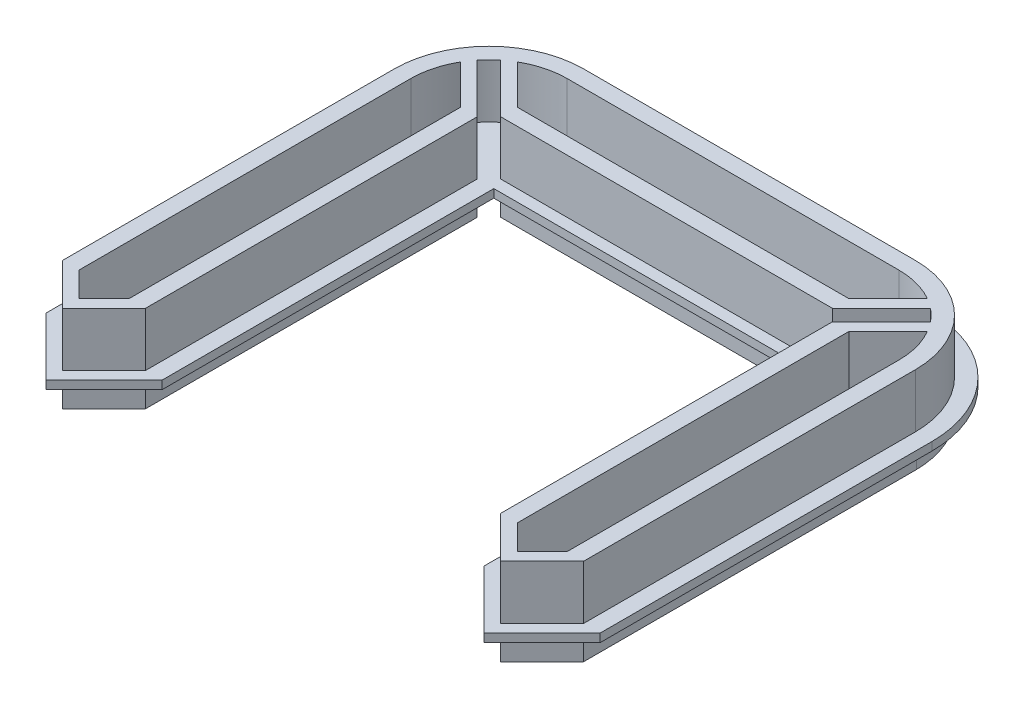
ISO-10303-21;
HEADER;
FILE_DESCRIPTION(('STEP AP214'),'2;1');
FILE_NAME('part.step','',(''),(''),'','','');
FILE_SCHEMA(('AUTOMOTIVE_DESIGN { 1 0 10303 214 1 1 1 1 }'));
ENDSEC;
DATA;
#1=APPLICATION_CONTEXT('core data for automotive mechanical design processes');
#2=APPLICATION_PROTOCOL_DEFINITION('international standard','automotive_design',2000,#1);
#3=PRODUCT_CONTEXT('',#1,'mechanical');
#4=PRODUCT('Part','Part','',(#3));
#5=PRODUCT_RELATED_PRODUCT_CATEGORY('part','',(#4));
#6=PRODUCT_DEFINITION_FORMATION('','',#4);
#7=PRODUCT_DEFINITION_CONTEXT('part definition',#1,'design');
#8=PRODUCT_DEFINITION('design','',#6,#7);
#9=PRODUCT_DEFINITION_SHAPE('','',#8);
#10=(LENGTH_UNIT() NAMED_UNIT(*) SI_UNIT(.MILLI.,.METRE.));
#11=(NAMED_UNIT(*) PLANE_ANGLE_UNIT() SI_UNIT($,.RADIAN.));
#12=(NAMED_UNIT(*) SI_UNIT($,.STERADIAN.) SOLID_ANGLE_UNIT());
#13=UNCERTAINTY_MEASURE_WITH_UNIT(LENGTH_MEASURE(1.E-05),#10,'distance_accuracy_value','');
#14=(GEOMETRIC_REPRESENTATION_CONTEXT(3) GLOBAL_UNCERTAINTY_ASSIGNED_CONTEXT((#13)) GLOBAL_UNIT_ASSIGNED_CONTEXT((#10,
#11,#12)) REPRESENTATION_CONTEXT('',''));
#15=CARTESIAN_POINT('',(0.,0.,0.));
#16=DIRECTION('',(0.,0.,1.));
#17=DIRECTION('',(1.,0.,0.));
#18=AXIS2_PLACEMENT_3D('',#15,#16,#17);
#19=CARTESIAN_POINT('',(19.9999999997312,4.,6.41326153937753));
#20=DIRECTION('',(0.,-1.,0.));
#21=DIRECTION('',(0.,0.,-1.));
#22=AXIS2_PLACEMENT_3D('',#19,#20,#21);
#23=PLANE('',#22);
#24=CARTESIAN_POINT('',(19.9999999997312,4.,6.4127035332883));
#25=DIRECTION('',(0.,1.,0.));
#26=DIRECTION('',(0.,0.,1.));
#27=AXIS2_PLACEMENT_3D('',#24,#25,#26);
#28=CIRCLE('',#27,13.4127034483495);
#29=CARTESIAN_POINT('',(19.9999999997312,4.,-6.99999991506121));
#30=VERTEX_POINT('',#29);
#31=CARTESIAN_POINT('',(33.4127034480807,4.,6.4127035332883));
#32=VERTEX_POINT('',#31);
#33=EDGE_CURVE('E816',#30,#32,#28,.F.);
#34=ORIENTED_EDGE('',*,*,#33,.F.);
#35=DIRECTION('',(-1.,0.,0.));
#36=VECTOR('',#35,1.);
#37=CARTESIAN_POINT('',(0.,4.,-6.99999991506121));
#38=LINE('',#37,#36);
#39=CARTESIAN_POINT('',(-19.9984897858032,4.,-6.99999991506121));
#40=VERTEX_POINT('',#39);
#41=EDGE_CURVE('E923',#30,#40,#38,.T.);
#42=ORIENTED_EDGE('',*,*,#41,.T.);
#43=CARTESIAN_POINT('',(-19.9984897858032,4.,6.41421374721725));
#44=DIRECTION('',(0.,1.,0.));
#45=DIRECTION('',(0.,0.,1.));
#46=AXIS2_PLACEMENT_3D('',#43,#44,#45);
#47=CIRCLE('',#46,13.4142136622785);
#48=CARTESIAN_POINT('',(-33.4127034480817,4.,6.41421374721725));
#49=VERTEX_POINT('',#48);
#50=EDGE_CURVE('E927',#49,#40,#47,.F.);
#51=ORIENTED_EDGE('',*,*,#50,.F.);
#52=DIRECTION('',(0.,0.,-1.));
#53=VECTOR('',#52,1.);
#54=CARTESIAN_POINT('',(-33.4127034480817,4.,0.));
#55=LINE('',#54,#53);
#56=CARTESIAN_POINT('',(-33.4127034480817,4.,46.4142136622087));
#57=VERTEX_POINT('',#56);
#58=EDGE_CURVE('E931',#57,#49,#55,.T.);
#59=ORIENTED_EDGE('',*,*,#58,.F.);
#60=DIRECTION('',(0.707106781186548,0.,0.707106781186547));
#61=VECTOR('',#60,1.);
#62=CARTESIAN_POINT('',(-39.9134585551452,4.,39.9134585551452));
#63=LINE('',#62,#61);
#64=CARTESIAN_POINT('',(-26.4134585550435,4.,53.4134585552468));
#65=VERTEX_POINT('',#64);
#66=EDGE_CURVE('E934',#57,#65,#63,.T.);
#67=ORIENTED_EDGE('',*,*,#66,.T.);
#68=DIRECTION('',(0.707106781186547,0.,-0.707106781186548));
#69=VECTOR('',#68,1.);
#70=CARTESIAN_POINT('',(13.5000000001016,4.,13.5000000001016));
#71=LINE('',#70,#69);
#72=CARTESIAN_POINT('',(-19.4142136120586,4.,46.4142136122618));
#73=VERTEX_POINT('',#72);
#74=EDGE_CURVE('E938',#65,#73,#71,.T.);
#75=ORIENTED_EDGE('',*,*,#74,.T.);
#76=DIRECTION('',(0.,0.,-1.));
#77=VECTOR('',#76,1.);
#78=CARTESIAN_POINT('',(-19.4142136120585,4.,0.));
#79=LINE('',#78,#77);
#80=CARTESIAN_POINT('',(-19.4142136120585,4.,6.41421366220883));
#81=VERTEX_POINT('',#80);
#82=EDGE_CURVE('E942',#73,#81,#79,.T.);
#83=ORIENTED_EDGE('',*,*,#82,.T.);
#84=DIRECTION('',(-0.999999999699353,0.,2.45212824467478E-05));
#85=VECTOR('',#84,1.);
#86=CARTESIAN_POINT('',(0.000157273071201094,4.,6.41373759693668));
#87=LINE('',#86,#85);
#88=CARTESIAN_POINT('',(19.4142136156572,4.,6.41326153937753));
#89=VERTEX_POINT('',#88);
#90=EDGE_CURVE('E946',#89,#81,#87,.T.);
#91=ORIENTED_EDGE('',*,*,#90,.F.);
#92=DIRECTION('',(0.,0.,-1.));
#93=VECTOR('',#92,1.);
#94=CARTESIAN_POINT('',(19.4142136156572,4.,0.));
#95=LINE('',#94,#93);
#96=CARTESIAN_POINT('',(19.4142136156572,4.,46.4142136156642));
#97=VERTEX_POINT('',#96);
#98=EDGE_CURVE('E950',#97,#89,#95,.T.);
#99=ORIENTED_EDGE('',*,*,#98,.F.);
#100=DIRECTION('',(0.707106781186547,0.,0.707106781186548));
#101=VECTOR('',#100,1.);
#102=CARTESIAN_POINT('',(-13.5000000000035,4.,13.5000000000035));
#103=LINE('',#102,#101);
#104=CARTESIAN_POINT('',(26.4134585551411,4.,53.4134585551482));
#105=VERTEX_POINT('',#104);
#106=EDGE_CURVE('E953',#97,#105,#103,.T.);
#107=ORIENTED_EDGE('',*,*,#106,.T.);
#108=DIRECTION('',(0.707106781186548,0.,-0.707106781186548));
#109=VECTOR('',#108,1.);
#110=CARTESIAN_POINT('',(39.9134585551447,4.,39.9134585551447));
#111=LINE('',#110,#109);
#112=CARTESIAN_POINT('',(33.412703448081,4.,46.4142136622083));
#113=VERTEX_POINT('',#112);
#114=EDGE_CURVE('E957',#105,#113,#111,.T.);
#115=ORIENTED_EDGE('',*,*,#114,.T.);
#116=DIRECTION('',(0.,0.,-1.));
#117=VECTOR('',#116,1.);
#118=CARTESIAN_POINT('',(33.4127034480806,4.,-3.24573832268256E-13));
#119=LINE('',#118,#117);
#120=EDGE_CURVE('E961',#113,#32,#119,.T.);
#121=ORIENTED_EDGE('',*,*,#120,.T.);
#122=EDGE_LOOP('',(#34,#42,#51,#59,#67,#75,#83,#91,#99,#107,#115,#121));
#123=FACE_BOUND('',#122,.T.);
#124=DIRECTION('',(-0.707106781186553,0.,-0.707106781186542));
#125=VECTOR('',#124,1.);
#126=CARTESIAN_POINT('',(-13.9142136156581,4.,13.9142136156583));
#127=LINE('',#126,#125);
#128=CARTESIAN_POINT('',(-21.4142136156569,4.,6.41421361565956));
#129=VERTEX_POINT('',#128);
#130=CARTESIAN_POINT('',(-27.3262992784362,4.,0.502127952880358));
#131=VERTEX_POINT('',#130);
#132=EDGE_CURVE('E616',#129,#131,#127,.T.);
#133=ORIENTED_EDGE('',*,*,#132,.F.);
#134=DIRECTION('',(0.,0.,-1.));
#135=VECTOR('',#134,1.);
#136=CARTESIAN_POINT('',(-21.4142136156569,4.,0.));
#137=LINE('',#136,#135);
#138=CARTESIAN_POINT('',(-21.414213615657,4.,46.4142136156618));
#139=VERTEX_POINT('',#138);
#140=EDGE_CURVE('E1451',#139,#129,#137,.T.);
#141=ORIENTED_EDGE('',*,*,#140,.F.);
#142=DIRECTION('',(0.707106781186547,0.,-0.707106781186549));
#143=VECTOR('',#142,1.);
#144=CARTESIAN_POINT('',(12.5000000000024,4.,12.5000000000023));
#145=LINE('',#144,#143);
#146=CARTESIAN_POINT('',(-26.4142136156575,4.,51.4142136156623));
#147=VERTEX_POINT('',#146);
#148=EDGE_CURVE('E1447',#147,#139,#145,.T.);
#149=ORIENTED_EDGE('',*,*,#148,.F.);
#150=DIRECTION('',(0.707106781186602,0.,0.707106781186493));
#151=VECTOR('',#150,1.);
#152=CARTESIAN_POINT('',(-38.9142136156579,4.,38.9142136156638));
#153=LINE('',#152,#151);
#154=CARTESIAN_POINT('',(-31.4142136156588,4.,46.4142136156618));
#155=VERTEX_POINT('',#154);
#156=EDGE_CURVE('E1443',#155,#147,#153,.T.);
#157=ORIENTED_EDGE('',*,*,#156,.F.);
#158=DIRECTION('',(0.,0.,1.));
#159=VECTOR('',#158,1.);
#160=CARTESIAN_POINT('',(-31.4142136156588,4.,0.));
#161=LINE('',#160,#159);
#162=CARTESIAN_POINT('',(-31.4142136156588,4.,6.41421361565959));
#163=VERTEX_POINT('',#162);
#164=EDGE_CURVE('E1439',#163,#155,#161,.T.);
#165=ORIENTED_EDGE('',*,*,#164,.F.);
#166=CARTESIAN_POINT('',(-20.,4.,6.41421361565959));
#167=DIRECTION('',(0.,1.,0.));
#168=DIRECTION('',(0.,0.,1.));
#169=AXIS2_PLACEMENT_3D('',#166,#167,#168);
#170=CIRCLE('',#169,11.4142136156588);
#171=CARTESIAN_POINT('',(-20.,4.,-4.99999999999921));
#172=VERTEX_POINT('',#171);
#173=EDGE_CURVE('E1436',#163,#172,#170,.F.);
#174=ORIENTED_EDGE('',*,*,#173,.T.);
#175=DIRECTION('',(-1.,0.,0.));
#176=VECTOR('',#175,1.);
#177=CARTESIAN_POINT('',(0.,4.,-4.99999999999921));
#178=LINE('',#177,#176);
#179=CARTESIAN_POINT('',(20.,4.,-4.99999999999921));
#180=VERTEX_POINT('',#179);
#181=EDGE_CURVE('E1430',#180,#172,#178,.T.);
#182=ORIENTED_EDGE('',*,*,#181,.F.);
#183=CARTESIAN_POINT('',(20.,4.,6.41421361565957));
#184=DIRECTION('',(0.,1.,0.));
#185=DIRECTION('',(0.,0.,1.));
#186=AXIS2_PLACEMENT_3D('',#183,#184,#185);
#187=CIRCLE('',#186,11.4142136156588);
#188=CARTESIAN_POINT('',(31.4142136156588,4.,6.41421361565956));
#189=VERTEX_POINT('',#188);
#190=EDGE_CURVE('E1427',#180,#189,#187,.F.);
#191=ORIENTED_EDGE('',*,*,#190,.T.);
#192=DIRECTION('',(0.,0.,1.));
#193=VECTOR('',#192,1.);
#194=CARTESIAN_POINT('',(31.4142136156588,4.,0.));
#195=LINE('',#194,#193);
#196=CARTESIAN_POINT('',(31.4142136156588,4.,46.4142136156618));
#197=VERTEX_POINT('',#196);
#198=EDGE_CURVE('E1424',#189,#197,#195,.T.);
#199=ORIENTED_EDGE('',*,*,#198,.T.);
#200=DIRECTION('',(-0.707106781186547,0.,0.707106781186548));
#201=VECTOR('',#200,1.);
#202=CARTESIAN_POINT('',(38.9142136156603,4.,38.9142136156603));
#203=LINE('',#202,#201);
#204=CARTESIAN_POINT('',(26.414213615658,4.,51.4142136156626));
#205=VERTEX_POINT('',#204);
#206=EDGE_CURVE('E1421',#197,#205,#203,.T.);
#207=ORIENTED_EDGE('',*,*,#206,.T.);
#208=DIRECTION('',(-0.707106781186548,0.,-0.707106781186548));
#209=VECTOR('',#208,1.);
#210=CARTESIAN_POINT('',(-12.5000000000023,4.,12.5000000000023));
#211=LINE('',#210,#209);
#212=CARTESIAN_POINT('',(21.4142136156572,4.,46.4142136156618));
#213=VERTEX_POINT('',#212);
#214=EDGE_CURVE('E1418',#205,#213,#211,.T.);
#215=ORIENTED_EDGE('',*,*,#214,.T.);
#216=DIRECTION('',(0.,0.,-1.));
#217=VECTOR('',#216,1.);
#218=CARTESIAN_POINT('',(21.4142136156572,4.,0.));
#219=LINE('',#218,#217);
#220=CARTESIAN_POINT('',(21.4142136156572,4.,6.41421361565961));
#221=VERTEX_POINT('',#220);
#222=EDGE_CURVE('E1415',#213,#221,#219,.T.);
#223=ORIENTED_EDGE('',*,*,#222,.T.);
#224=DIRECTION('',(0.707106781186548,0.,-0.707106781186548));
#225=VECTOR('',#224,1.);
#226=CARTESIAN_POINT('',(13.9142136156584,4.,13.9142136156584));
#227=LINE('',#226,#225);
#228=CARTESIAN_POINT('',(27.3262992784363,4.,0.502127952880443));
#229=VERTEX_POINT('',#228);
#230=EDGE_CURVE('E1412',#221,#229,#227,.T.);
#231=ORIENTED_EDGE('',*,*,#230,.T.);
#232=CARTESIAN_POINT('',(20.,4.,6.41421361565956));
#233=DIRECTION('',(0.,1.,0.));
#234=DIRECTION('',(0.,0.,1.));
#235=AXIS2_PLACEMENT_3D('',#232,#233,#234);
#236=CIRCLE('',#235,9.41421361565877);
#237=CARTESIAN_POINT('',(25.9120856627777,4.,-0.912085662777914));
#238=VERTEX_POINT('',#237);
#239=EDGE_CURVE('E1409',#229,#238,#236,.T.);
#240=ORIENTED_EDGE('',*,*,#239,.T.);
#241=DIRECTION('',(0.707106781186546,0.,-0.707106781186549));
#242=VECTOR('',#241,1.);
#243=CARTESIAN_POINT('',(12.5,4.,12.4999999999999));
#244=LINE('',#243,#242);
#245=CARTESIAN_POINT('',(20.0000000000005,4.,4.99999999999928));
#246=VERTEX_POINT('',#245);
#247=EDGE_CURVE('E1401',#246,#238,#244,.T.);
#248=ORIENTED_EDGE('',*,*,#247,.F.);
#249=DIRECTION('',(1.,0.,0.));
#250=VECTOR('',#249,1.);
#251=CARTESIAN_POINT('',(0.,4.,4.99999999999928));
#252=LINE('',#251,#250);
#253=CARTESIAN_POINT('',(-19.9999999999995,4.,4.99999999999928));
#254=VERTEX_POINT('',#253);
#255=EDGE_CURVE('E1393',#254,#246,#252,.T.);
#256=ORIENTED_EDGE('',*,*,#255,.F.);
#257=DIRECTION('',(-0.707106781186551,0.,-0.707106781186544));
#258=VECTOR('',#257,1.);
#259=CARTESIAN_POINT('',(-12.4999999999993,4.,12.4999999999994));
#260=LINE('',#259,#258);
#261=CARTESIAN_POINT('',(-25.9120856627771,4.,-0.912085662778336));
#262=VERTEX_POINT('',#261);
#263=EDGE_CURVE('E62',#254,#262,#260,.T.);
#264=ORIENTED_EDGE('',*,*,#263,.T.);
#265=CARTESIAN_POINT('',(-20.,4.,6.41421361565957));
#266=DIRECTION('',(0.,1.,0.));
#267=DIRECTION('',(0.,0.,1.));
#268=AXIS2_PLACEMENT_3D('',#265,#266,#267);
#269=CIRCLE('',#268,9.41421361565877);
#270=EDGE_CURVE('E57',#131,#262,#269,.F.);
#271=ORIENTED_EDGE('',*,*,#270,.F.);
#272=EDGE_LOOP('',(#133,#141,#149,#157,#165,#174,#182,#191,#199,#207,#215,#223,#231,#240,#248,
#256,#264,#271));
#273=FACE_BOUND('',#272,.T.);
#274=ADVANCED_FACE('F41',(#123,#273),#23,.F.);
#275=CARTESIAN_POINT('',(19.9999999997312,4.,6.41326153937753));
#276=DIRECTION('',(0.,-1.,0.));
#277=DIRECTION('',(0.,0.,-1.));
#278=AXIS2_PLACEMENT_3D('',#275,#276,#277);
#279=CYLINDRICAL_SURFACE('',#278,11.413261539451);
#280=CARTESIAN_POINT('',(19.9999999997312,3.,6.41326153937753));
#281=DIRECTION('',(0.,1.,0.));
#282=DIRECTION('',(0.,0.,1.));
#283=AXIS2_PLACEMENT_3D('',#280,#281,#282);
#284=CIRCLE('',#283,11.413261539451);
#285=CARTESIAN_POINT('',(27.3327686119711,3.,-2.33276861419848));
#286=VERTEX_POINT('',#285);
#287=CARTESIAN_POINT('',(19.9999999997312,3.,-5.00000000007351));
#288=VERTEX_POINT('',#287);
#289=EDGE_CURVE('E879',#286,#288,#284,.T.);
#290=ORIENTED_EDGE('',*,*,#289,.F.);
#291=DIRECTION('',(0.,-1.,0.));
#292=VECTOR('',#291,1.);
#293=CARTESIAN_POINT('',(27.3327686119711,4.,-2.33276861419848));
#294=LINE('',#293,#292);
#295=CARTESIAN_POINT('',(27.3327686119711,0.,-2.33276861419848));
#296=VERTEX_POINT('',#295);
#297=EDGE_CURVE('E1144',#286,#296,#294,.T.);
#298=ORIENTED_EDGE('',*,*,#297,.T.);
#299=CARTESIAN_POINT('',(19.9999999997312,0.,6.41326153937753));
#300=DIRECTION('',(0.,1.,0.));
#301=DIRECTION('',(0.,0.,-1.));
#302=AXIS2_PLACEMENT_3D('',#299,#300,#301);
#303=CIRCLE('',#302,11.413261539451);
#304=CARTESIAN_POINT('',(19.9999999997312,0.,-5.00000000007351));
#305=VERTEX_POINT('',#304);
#306=EDGE_CURVE('E1140',#296,#305,#303,.T.);
#307=ORIENTED_EDGE('',*,*,#306,.T.);
#308=DIRECTION('',(0.,-1.,0.));
#309=VECTOR('',#308,1.);
#310=CARTESIAN_POINT('',(19.9999999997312,4.,-5.00000000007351));
#311=LINE('',#310,#309);
#312=EDGE_CURVE('E11',#288,#305,#311,.T.);
#313=ORIENTED_EDGE('',*,*,#312,.F.);
#314=EDGE_LOOP('',(#290,#298,#307,#313));
#315=FACE_BOUND('',#314,.T.);
#316=ADVANCED_FACE('F43',(#315),#279,.T.);
#317=CARTESIAN_POINT('',(19.9999999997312,4.,-5.00000000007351));
#318=DIRECTION('',(0.,0.,1.));
#319=DIRECTION('',(1.,0.,0.));
#320=AXIS2_PLACEMENT_3D('',#317,#318,#319);
#321=PLANE('',#320);
#322=DIRECTION('',(-1.,0.,0.));
#323=VECTOR('',#322,1.);
#324=CARTESIAN_POINT('',(0.,3.,-5.00000000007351));
#325=LINE('',#324,#323);
#326=CARTESIAN_POINT('',(-19.9984897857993,3.,-5.0000000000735));
#327=VERTEX_POINT('',#326);
#328=EDGE_CURVE('E916',#288,#327,#325,.T.);
#329=ORIENTED_EDGE('',*,*,#328,.F.);
#330=ORIENTED_EDGE('',*,*,#312,.T.);
#331=DIRECTION('',(-1.,0.,0.));
#332=VECTOR('',#331,1.);
#333=CARTESIAN_POINT('',(19.9999999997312,0.,-5.00000000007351));
#334=LINE('',#333,#332);
#335=CARTESIAN_POINT('',(-19.9984897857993,0.,-5.0000000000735));
#336=VERTEX_POINT('',#335);
#337=EDGE_CURVE('E1149',#305,#336,#334,.T.);
#338=ORIENTED_EDGE('',*,*,#337,.T.);
#339=DIRECTION('',(0.,-1.,0.));
#340=VECTOR('',#339,1.);
#341=CARTESIAN_POINT('',(-19.9984897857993,4.,-5.0000000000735));
#342=LINE('',#341,#340);
#343=EDGE_CURVE('E50',#327,#336,#342,.T.);
#344=ORIENTED_EDGE('',*,*,#343,.F.);
#345=EDGE_LOOP('',(#329,#330,#338,#344));
#346=FACE_BOUND('',#345,.T.);
#347=ADVANCED_FACE('F1189',(#346),#321,.F.);
#348=CARTESIAN_POINT('',(-19.9984897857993,4.,6.41421366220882));
#349=DIRECTION('',(0.,-1.,0.));
#350=DIRECTION('',(0.,0.,-1.));
#351=AXIS2_PLACEMENT_3D('',#348,#349,#350);
#352=CYLINDRICAL_SURFACE('',#351,11.4142136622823);
#353=CARTESIAN_POINT('',(-19.9984897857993,3.,6.41421366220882));
#354=DIRECTION('',(0.,1.,0.));
#355=DIRECTION('',(0.,0.,1.));
#356=AXIS2_PLACEMENT_3D('',#353,#354,#355);
#357=CIRCLE('',#356,11.4142136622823);
#358=CARTESIAN_POINT('',(-27.3322378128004,3.,-2.33223781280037));
#359=VERTEX_POINT('',#358);
#360=EDGE_CURVE('E913',#327,#359,#357,.T.);
#361=ORIENTED_EDGE('',*,*,#360,.F.);
#362=ORIENTED_EDGE('',*,*,#343,.T.);
#363=CARTESIAN_POINT('',(-19.9984897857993,0.,6.41421366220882));
#364=DIRECTION('',(0.,1.,0.));
#365=DIRECTION('',(0.,0.,-1.));
#366=AXIS2_PLACEMENT_3D('',#363,#364,#365);
#367=CIRCLE('',#366,11.4142136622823);
#368=CARTESIAN_POINT('',(-27.3322378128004,0.,-2.33223781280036));
#369=VERTEX_POINT('',#368);
#370=EDGE_CURVE('E1153',#336,#369,#367,.T.);
#371=ORIENTED_EDGE('',*,*,#370,.T.);
#372=DIRECTION('',(0.,-1.,0.));
#373=VECTOR('',#372,1.);
#374=CARTESIAN_POINT('',(-27.3322378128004,4.,-2.33223781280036));
#375=LINE('',#374,#373);
#376=EDGE_CURVE('E1177',#359,#369,#375,.T.);
#377=ORIENTED_EDGE('',*,*,#376,.F.);
#378=EDGE_LOOP('',(#361,#362,#371,#377));
#379=FACE_BOUND('',#378,.T.);
#380=ADVANCED_FACE('F1183',(#379),#352,.T.);
#381=CARTESIAN_POINT('',(-28.7463186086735,3.,-0.917891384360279));
#382=VERTEX_POINT('',#381);
#383=CARTESIAN_POINT('',(-31.4127034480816,3.,6.41421366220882));
#384=VERTEX_POINT('',#383);
#385=EDGE_CURVE('E912',#382,#384,#357,.T.);
#386=ORIENTED_EDGE('',*,*,#385,.F.);
#387=DIRECTION('',(0.,-1.,0.));
#388=VECTOR('',#387,1.);
#389=CARTESIAN_POINT('',(-28.7463186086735,4.,-0.917891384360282));
#390=LINE('',#389,#388);
#391=CARTESIAN_POINT('',(-28.7463186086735,0.,-0.917891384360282));
#392=VERTEX_POINT('',#391);
#393=EDGE_CURVE('E1129',#382,#392,#390,.T.);
#394=ORIENTED_EDGE('',*,*,#393,.T.);
#395=CARTESIAN_POINT('',(-19.9984897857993,0.,6.41421366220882));
#396=DIRECTION('',(0.,1.,0.));
#397=DIRECTION('',(0.,0.,-1.));
#398=AXIS2_PLACEMENT_3D('',#395,#396,#397);
#399=CIRCLE('',#398,11.4142136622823);
#400=CARTESIAN_POINT('',(-31.4127034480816,0.,6.41421366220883));
#401=VERTEX_POINT('',#400);
#402=EDGE_CURVE('E1087',#392,#401,#399,.T.);
#403=ORIENTED_EDGE('',*,*,#402,.T.);
#404=DIRECTION('',(0.,-1.,0.));
#405=VECTOR('',#404,1.);
#406=CARTESIAN_POINT('',(-31.4127034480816,4.,6.41421366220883));
#407=LINE('',#406,#405);
#408=EDGE_CURVE('E1126',#384,#401,#407,.T.);
#409=ORIENTED_EDGE('',*,*,#408,.F.);
#410=EDGE_LOOP('',(#386,#394,#403,#409));
#411=FACE_BOUND('',#410,.T.);
#412=ADVANCED_FACE('F1745',(#411),#352,.T.);
#413=CARTESIAN_POINT('',(20.0000000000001,4.,4.99999999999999));
#414=DIRECTION('',(0.,0.,-1.));
#415=DIRECTION('',(-1.,0.,0.));
#416=AXIS2_PLACEMENT_3D('',#413,#414,#415);
#417=PLANE('',#416);
#418=DIRECTION('',(1.,0.,0.));
#419=VECTOR('',#418,1.);
#420=CARTESIAN_POINT('',(0.,3.,5.));
#421=LINE('',#420,#419);
#422=CARTESIAN_POINT('',(-19.9999999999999,3.,5.));
#423=VERTEX_POINT('',#422);
#424=CARTESIAN_POINT('',(20.0000000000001,3.,4.99999999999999));
#425=VERTEX_POINT('',#424);
#426=EDGE_CURVE('E897',#423,#425,#421,.T.);
#427=ORIENTED_EDGE('',*,*,#426,.F.);
#428=DIRECTION('',(0.,-1.,0.));
#429=VECTOR('',#428,1.);
#430=CARTESIAN_POINT('',(-19.9999999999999,4.,5.));
#431=LINE('',#430,#429);
#432=CARTESIAN_POINT('',(-19.9999999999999,0.,5.));
#433=VERTEX_POINT('',#432);
#434=EDGE_CURVE('E1174',#423,#433,#431,.T.);
#435=ORIENTED_EDGE('',*,*,#434,.T.);
#436=DIRECTION('',(1.,0.,0.));
#437=VECTOR('',#436,1.);
#438=CARTESIAN_POINT('',(20.0000000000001,0.,4.99999999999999));
#439=LINE('',#438,#437);
#440=CARTESIAN_POINT('',(20.0000000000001,0.,4.99999999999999));
#441=VERTEX_POINT('',#440);
#442=EDGE_CURVE('E1161',#433,#441,#439,.T.);
#443=ORIENTED_EDGE('',*,*,#442,.T.);
#444=DIRECTION('',(0.,-1.,0.));
#445=VECTOR('',#444,1.);
#446=CARTESIAN_POINT('',(20.0000000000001,4.,4.99999999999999));
#447=LINE('',#446,#445);
#448=EDGE_CURVE('E1171',#425,#441,#447,.T.);
#449=ORIENTED_EDGE('',*,*,#448,.F.);
#450=EDGE_LOOP('',(#427,#435,#443,#449));
#451=FACE_BOUND('',#450,.T.);
#452=ADVANCED_FACE('F1211',(#451),#417,.F.);
#453=CARTESIAN_POINT('',(-31.4127034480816,4.,46.4142136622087));
#454=DIRECTION('',(1.,0.,0.));
#455=DIRECTION('',(0.,0.,-1.));
#456=AXIS2_PLACEMENT_3D('',#453,#454,#455);
#457=PLANE('',#456);
#458=DIRECTION('',(0.,0.,1.));
#459=VECTOR('',#458,1.);
#460=CARTESIAN_POINT('',(-31.4127034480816,3.,0.));
#461=LINE('',#460,#459);
#462=CARTESIAN_POINT('',(-31.4127034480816,3.,46.4142136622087));
#463=VERTEX_POINT('',#462);
#464=EDGE_CURVE('E909',#384,#463,#461,.T.);
#465=ORIENTED_EDGE('',*,*,#464,.F.);
#466=ORIENTED_EDGE('',*,*,#408,.T.);
#467=DIRECTION('',(0.,0.,1.));
#468=VECTOR('',#467,1.);
#469=CARTESIAN_POINT('',(-31.4127034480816,0.,46.4142136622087));
#470=LINE('',#469,#468);
#471=CARTESIAN_POINT('',(-31.4127034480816,0.,46.4142136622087));
#472=VERTEX_POINT('',#471);
#473=EDGE_CURVE('E1094',#401,#472,#470,.T.);
#474=ORIENTED_EDGE('',*,*,#473,.T.);
#475=DIRECTION('',(0.,-1.,0.));
#476=VECTOR('',#475,1.);
#477=CARTESIAN_POINT('',(-31.4127034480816,4.,46.4142136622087));
#478=LINE('',#477,#476);
#479=EDGE_CURVE('E1123',#463,#472,#478,.T.);
#480=ORIENTED_EDGE('',*,*,#479,.F.);
#481=EDGE_LOOP('',(#465,#466,#474,#480));
#482=FACE_BOUND('',#481,.T.);
#483=ADVANCED_FACE('F1744',(#482),#457,.F.);
#484=CARTESIAN_POINT('',(-26.4134585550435,4.,51.4134585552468));
#485=DIRECTION('',(0.707106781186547,0.,-0.707106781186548));
#486=DIRECTION('',(-0.707106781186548,0.,-0.707106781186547));
#487=AXIS2_PLACEMENT_3D('',#484,#485,#486);
#488=PLANE('',#487);
#489=DIRECTION('',(0.707106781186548,0.,0.707106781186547));
#490=VECTOR('',#489,1.);
#491=CARTESIAN_POINT('',(-38.9134585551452,3.,38.9134585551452));
#492=LINE('',#491,#490);
#493=CARTESIAN_POINT('',(-26.4134585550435,3.,51.4134585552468));
#494=VERTEX_POINT('',#493);
#495=EDGE_CURVE('E906',#463,#494,#492,.T.);
#496=ORIENTED_EDGE('',*,*,#495,.F.);
#497=ORIENTED_EDGE('',*,*,#479,.T.);
#498=DIRECTION('',(0.707106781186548,0.,0.707106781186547));
#499=VECTOR('',#498,1.);
#500=CARTESIAN_POINT('',(-26.4134585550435,0.,51.4134585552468));
#501=LINE('',#500,#499);
#502=CARTESIAN_POINT('',(-26.4134585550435,0.,51.4134585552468));
#503=VERTEX_POINT('',#502);
#504=EDGE_CURVE('E1098',#472,#503,#501,.T.);
#505=ORIENTED_EDGE('',*,*,#504,.T.);
#506=DIRECTION('',(0.,-1.,0.));
#507=VECTOR('',#506,1.);
#508=CARTESIAN_POINT('',(-26.4134585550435,4.,51.4134585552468));
#509=LINE('',#508,#507);
#510=EDGE_CURVE('E1120',#494,#503,#509,.T.);
#511=ORIENTED_EDGE('',*,*,#510,.F.);
#512=EDGE_LOOP('',(#496,#497,#505,#511));
#513=FACE_BOUND('',#512,.T.);
#514=ADVANCED_FACE('F1780',(#513),#488,.F.);
#515=CARTESIAN_POINT('',(-21.4142136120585,4.,46.4142136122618));
#516=DIRECTION('',(-0.707106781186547,0.,-0.707106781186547));
#517=DIRECTION('',(-0.707106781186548,0.,0.707106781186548));
#518=AXIS2_PLACEMENT_3D('',#515,#516,#517);
#519=PLANE('',#518);
#520=DIRECTION('',(0.707106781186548,0.,-0.707106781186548));
#521=VECTOR('',#520,1.);
#522=CARTESIAN_POINT('',(12.5000000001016,3.,12.5000000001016));
#523=LINE('',#522,#521);
#524=CARTESIAN_POINT('',(-21.4142136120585,3.,46.4142136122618));
#525=VERTEX_POINT('',#524);
#526=EDGE_CURVE('E903',#494,#525,#523,.T.);
#527=ORIENTED_EDGE('',*,*,#526,.F.);
#528=ORIENTED_EDGE('',*,*,#510,.T.);
#529=DIRECTION('',(0.707106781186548,0.,-0.707106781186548));
#530=VECTOR('',#529,1.);
#531=CARTESIAN_POINT('',(-21.4142136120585,0.,46.4142136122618));
#532=LINE('',#531,#530);
#533=CARTESIAN_POINT('',(-21.4142136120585,0.,46.4142136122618));
#534=VERTEX_POINT('',#533);
#535=EDGE_CURVE('E1102',#503,#534,#532,.T.);
#536=ORIENTED_EDGE('',*,*,#535,.T.);
#537=DIRECTION('',(0.,-1.,0.));
#538=VECTOR('',#537,1.);
#539=CARTESIAN_POINT('',(-21.4142136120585,4.,46.4142136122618));
#540=LINE('',#539,#538);
#541=EDGE_CURVE('E1117',#525,#534,#540,.T.);
#542=ORIENTED_EDGE('',*,*,#541,.F.);
#543=EDGE_LOOP('',(#527,#528,#536,#542));
#544=FACE_BOUND('',#543,.T.);
#545=ADVANCED_FACE('F1788',(#544),#519,.F.);
#546=CARTESIAN_POINT('',(-21.4142136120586,4.,6.41421361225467));
#547=DIRECTION('',(-1.,0.,0.));
#548=DIRECTION('',(0.,0.,1.));
#549=AXIS2_PLACEMENT_3D('',#546,#547,#548);
#550=PLANE('',#549);
#551=DIRECTION('',(0.,0.,-1.));
#552=VECTOR('',#551,1.);
#553=CARTESIAN_POINT('',(-21.4142136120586,3.,0.));
#554=LINE('',#553,#552);
#555=CARTESIAN_POINT('',(-21.4142136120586,3.,6.41421361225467));
#556=VERTEX_POINT('',#555);
#557=EDGE_CURVE('E900',#525,#556,#554,.T.);
#558=ORIENTED_EDGE('',*,*,#557,.F.);
#559=ORIENTED_EDGE('',*,*,#541,.T.);
#560=DIRECTION('',(0.,0.,-1.));
#561=VECTOR('',#560,1.);
#562=CARTESIAN_POINT('',(-21.4142136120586,0.,6.41421361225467));
#563=LINE('',#562,#561);
#564=CARTESIAN_POINT('',(-21.4142136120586,0.,6.41421361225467));
#565=VERTEX_POINT('',#564);
#566=EDGE_CURVE('E1106',#534,#565,#563,.T.);
#567=ORIENTED_EDGE('',*,*,#566,.T.);
#568=DIRECTION('',(0.,-1.,0.));
#569=VECTOR('',#568,1.);
#570=CARTESIAN_POINT('',(-21.4142136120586,4.,6.41421361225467));
#571=LINE('',#570,#569);
#572=EDGE_CURVE('E1114',#556,#565,#571,.T.);
#573=ORIENTED_EDGE('',*,*,#572,.F.);
#574=EDGE_LOOP('',(#558,#559,#567,#573));
#575=FACE_BOUND('',#574,.T.);
#576=ADVANCED_FACE('F1797',(#575),#550,.F.);
#577=CARTESIAN_POINT('',(21.4142136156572,4.,46.4142136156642));
#578=DIRECTION('',(0.707106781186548,0.,-0.707106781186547));
#579=DIRECTION('',(-0.707106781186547,0.,-0.707106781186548));
#580=AXIS2_PLACEMENT_3D('',#577,#578,#579);
#581=PLANE('',#580);
#582=DIRECTION('',(0.707106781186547,0.,0.707106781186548));
#583=VECTOR('',#582,1.);
#584=CARTESIAN_POINT('',(-12.5000000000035,3.,12.5000000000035));
#585=LINE('',#584,#583);
#586=CARTESIAN_POINT('',(21.4142136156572,3.,46.4142136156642));
#587=VERTEX_POINT('',#586);
#588=CARTESIAN_POINT('',(26.4134585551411,3.,51.4134585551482));
#589=VERTEX_POINT('',#588);
#590=EDGE_CURVE('E891',#587,#589,#585,.T.);
#591=ORIENTED_EDGE('',*,*,#590,.F.);
#592=DIRECTION('',(0.,-1.,0.));
#593=VECTOR('',#592,1.);
#594=CARTESIAN_POINT('',(21.4142136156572,4.,46.4142136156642));
#595=LINE('',#594,#593);
#596=CARTESIAN_POINT('',(21.4142136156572,0.,46.4142136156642));
#597=VERTEX_POINT('',#596);
#598=EDGE_CURVE('E1022',#587,#597,#595,.T.);
#599=ORIENTED_EDGE('',*,*,#598,.T.);
#600=DIRECTION('',(0.707106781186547,0.,0.707106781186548));
#601=VECTOR('',#600,1.);
#602=CARTESIAN_POINT('',(21.4142136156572,0.,46.4142136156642));
#603=LINE('',#602,#601);
#604=CARTESIAN_POINT('',(26.4134585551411,0.,51.4134585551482));
#605=VERTEX_POINT('',#604);
#606=EDGE_CURVE('E977',#597,#605,#603,.T.);
#607=ORIENTED_EDGE('',*,*,#606,.T.);
#608=DIRECTION('',(0.,-1.,0.));
#609=VECTOR('',#608,1.);
#610=CARTESIAN_POINT('',(26.4134585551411,4.,51.4134585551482));
#611=LINE('',#610,#609);
#612=EDGE_CURVE('E1064',#589,#605,#611,.T.);
#613=ORIENTED_EDGE('',*,*,#612,.F.);
#614=EDGE_LOOP('',(#591,#599,#607,#613));
#615=FACE_BOUND('',#614,.T.);
#616=ADVANCED_FACE('F1230',(#615),#581,.F.);
#617=CARTESIAN_POINT('',(26.4134585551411,4.,51.4134585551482));
#618=DIRECTION('',(-0.707106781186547,0.,-0.707106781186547));
#619=DIRECTION('',(-0.707106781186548,0.,0.707106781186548));
#620=AXIS2_PLACEMENT_3D('',#617,#618,#619);
#621=PLANE('',#620);
#622=DIRECTION('',(0.707106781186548,0.,-0.707106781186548));
#623=VECTOR('',#622,1.);
#624=CARTESIAN_POINT('',(38.9134585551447,3.,38.9134585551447));
#625=LINE('',#624,#623);
#626=CARTESIAN_POINT('',(31.4127034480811,3.,46.4142136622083));
#627=VERTEX_POINT('',#626);
#628=EDGE_CURVE('E888',#589,#627,#625,.T.);
#629=ORIENTED_EDGE('',*,*,#628,.F.);
#630=ORIENTED_EDGE('',*,*,#612,.T.);
#631=DIRECTION('',(0.707106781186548,0.,-0.707106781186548));
#632=VECTOR('',#631,1.);
#633=CARTESIAN_POINT('',(26.4134585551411,0.,51.4134585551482));
#634=LINE('',#633,#632);
#635=CARTESIAN_POINT('',(31.4127034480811,0.,46.4142136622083));
#636=VERTEX_POINT('',#635);
#637=EDGE_CURVE('E1026',#605,#636,#634,.T.);
#638=ORIENTED_EDGE('',*,*,#637,.T.);
#639=DIRECTION('',(0.,-1.,0.));
#640=VECTOR('',#639,1.);
#641=CARTESIAN_POINT('',(31.4127034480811,4.,46.4142136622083));
#642=LINE('',#641,#640);
#643=EDGE_CURVE('E1059',#627,#636,#642,.T.);
#644=ORIENTED_EDGE('',*,*,#643,.F.);
#645=EDGE_LOOP('',(#629,#630,#638,#644));
#646=FACE_BOUND('',#645,.T.);
#647=ADVANCED_FACE('F1242',(#646),#621,.F.);
#648=CARTESIAN_POINT('',(19.9999999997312,4.,6.41326153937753));
#649=DIRECTION('',(0.,-1.,0.));
#650=DIRECTION('',(0.,0.,-1.));
#651=AXIS2_PLACEMENT_3D('',#648,#649,#650);
#652=CYLINDRICAL_SURFACE('',#651,11.413261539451);
#653=CARTESIAN_POINT('',(31.4127034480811,3.,6.30039450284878));
#654=VERTEX_POINT('',#653);
#655=CARTESIAN_POINT('',(28.7468984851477,3.,-0.918471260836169));
#656=VERTEX_POINT('',#655);
#657=EDGE_CURVE('E885',#654,#656,#284,.T.);
#658=ORIENTED_EDGE('',*,*,#657,.F.);
#659=DIRECTION('',(0.,-1.,0.));
#660=VECTOR('',#659,1.);
#661=CARTESIAN_POINT('',(31.4127034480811,4.,6.30039450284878));
#662=LINE('',#661,#660);
#663=CARTESIAN_POINT('',(31.4127034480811,0.,6.30039450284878));
#664=VERTEX_POINT('',#663);
#665=EDGE_CURVE('E1055',#654,#664,#662,.T.);
#666=ORIENTED_EDGE('',*,*,#665,.T.);
#667=CARTESIAN_POINT('',(19.9999999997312,0.,6.41326153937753));
#668=DIRECTION('',(0.,1.,0.));
#669=DIRECTION('',(0.,0.,-1.));
#670=AXIS2_PLACEMENT_3D('',#667,#668,#669);
#671=CIRCLE('',#670,11.413261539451);
#672=CARTESIAN_POINT('',(28.7468984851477,0.,-0.918471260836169));
#673=VERTEX_POINT('',#672);
#674=EDGE_CURVE('E1034',#664,#673,#671,.T.);
#675=ORIENTED_EDGE('',*,*,#674,.T.);
#676=DIRECTION('',(0.,-1.,0.));
#677=VECTOR('',#676,1.);
#678=CARTESIAN_POINT('',(28.7468984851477,4.,-0.918471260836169));
#679=LINE('',#678,#677);
#680=EDGE_CURVE('E1050',#656,#673,#679,.T.);
#681=ORIENTED_EDGE('',*,*,#680,.F.);
#682=EDGE_LOOP('',(#658,#666,#675,#681));
#683=FACE_BOUND('',#682,.T.);
#684=ADVANCED_FACE('F1258',(#683),#652,.T.);
#685=CARTESIAN_POINT('',(21.414213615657,4.,6.41421361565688));
#686=DIRECTION('',(1.,0.,0.));
#687=DIRECTION('',(0.,0.,-1.));
#688=AXIS2_PLACEMENT_3D('',#685,#686,#687);
#689=PLANE('',#688);
#690=DIRECTION('',(0.,0.,1.));
#691=VECTOR('',#690,1.);
#692=CARTESIAN_POINT('',(21.4142136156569,3.,0.));
#693=LINE('',#692,#691);
#694=CARTESIAN_POINT('',(21.414213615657,3.,6.41421361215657));
#695=VERTEX_POINT('',#694);
#696=EDGE_CURVE('E894',#695,#587,#693,.T.);
#697=ORIENTED_EDGE('',*,*,#696,.F.);
#698=DIRECTION('',(0.,-1.,0.));
#699=VECTOR('',#698,1.);
#700=CARTESIAN_POINT('',(21.414213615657,4.,6.41421361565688));
#701=LINE('',#700,#699);
#702=CARTESIAN_POINT('',(21.414213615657,0.,6.41421361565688));
#703=VERTEX_POINT('',#702);
#704=EDGE_CURVE('E1047',#695,#703,#701,.T.);
#705=ORIENTED_EDGE('',*,*,#704,.T.);
#706=DIRECTION('',(0.,0.,1.));
#707=VECTOR('',#706,1.);
#708=CARTESIAN_POINT('',(21.414213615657,0.,6.41421361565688));
#709=LINE('',#708,#707);
#710=EDGE_CURVE('E1019',#703,#597,#709,.T.);
#711=ORIENTED_EDGE('',*,*,#710,.T.);
#712=ORIENTED_EDGE('',*,*,#598,.F.);
#713=EDGE_LOOP('',(#697,#705,#711,#712));
#714=FACE_BOUND('',#713,.T.);
#715=ADVANCED_FACE('F1231',(#714),#689,.F.);
#716=CARTESIAN_POINT('',(-25.,4.,0.));
#717=DIRECTION('',(0.707106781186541,0.,-0.707106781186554));
#718=DIRECTION('',(-0.707106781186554,0.,-0.707106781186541));
#719=AXIS2_PLACEMENT_3D('',#716,#717,#718);
#720=PLANE('',#719);
#721=ORIENTED_EDGE('',*,*,#434,.F.);
#722=DIRECTION('',(-0.707106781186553,0.,-0.707106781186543));
#723=VECTOR('',#722,1.);
#724=CARTESIAN_POINT('',(-19.9999999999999,3.,5.));
#725=LINE('',#724,#723);
#726=EDGE_CURVE('E1136',#423,#359,#725,.T.);
#727=ORIENTED_EDGE('',*,*,#726,.T.);
#728=ORIENTED_EDGE('',*,*,#376,.T.);
#729=DIRECTION('',(0.707106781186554,0.,0.707106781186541));
#730=VECTOR('',#729,1.);
#731=CARTESIAN_POINT('',(-25.,0.,0.));
#732=LINE('',#731,#730);
#733=EDGE_CURVE('E1157',#369,#433,#732,.T.);
#734=ORIENTED_EDGE('',*,*,#733,.T.);
#735=EDGE_LOOP('',(#721,#727,#728,#734));
#736=FACE_BOUND('',#735,.T.);
#737=ADVANCED_FACE('F1199',(#736),#720,.F.);
#738=CARTESIAN_POINT('',(25.,4.,0.));
#739=DIRECTION('',(-0.707106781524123,0.,-0.707106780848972));
#740=DIRECTION('',(-0.707106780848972,0.,0.707106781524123));
#741=AXIS2_PLACEMENT_3D('',#738,#739,#740);
#742=PLANE('',#741);
#743=DIRECTION('',(0.707106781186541,0.,-0.707106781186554));
#744=VECTOR('',#743,1.);
#745=CARTESIAN_POINT('',(25.,4.,0.));
#746=LINE('',#745,#744);
#747=CARTESIAN_POINT('',(27.3322378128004,4.,-2.3322378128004));
#748=VERTEX_POINT('',#747);
#749=CARTESIAN_POINT('',(27.3327686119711,4.,-2.33276861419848));
#750=VERTEX_POINT('',#749);
#751=EDGE_CURVE('E1141',#748,#750,#746,.T.);
#752=ORIENTED_EDGE('',*,*,#751,.F.);
#753=DIRECTION('',(0.,1.,0.));
#754=VECTOR('',#753,1.);
#755=CARTESIAN_POINT('',(27.3322378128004,3.,-2.33223781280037));
#756=LINE('',#755,#754);
#757=CARTESIAN_POINT('',(27.3322378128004,3.,-2.33223781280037));
#758=VERTEX_POINT('',#757);
#759=EDGE_CURVE('E1080',#758,#748,#756,.T.);
#760=ORIENTED_EDGE('',*,*,#759,.F.);
#761=DIRECTION('',(-0.707106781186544,0.,0.707106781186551));
#762=VECTOR('',#761,1.);
#763=CARTESIAN_POINT('',(20.0000000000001,3.,4.99999999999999));
#764=LINE('',#763,#762);
#765=EDGE_CURVE('E1072',#758,#425,#764,.T.);
#766=ORIENTED_EDGE('',*,*,#765,.T.);
#767=ORIENTED_EDGE('',*,*,#448,.T.);
#768=DIRECTION('',(0.707106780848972,0.,-0.707106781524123));
#769=VECTOR('',#768,1.);
#770=CARTESIAN_POINT('',(25.,0.,0.));
#771=LINE('',#770,#769);
#772=EDGE_CURVE('E1145',#441,#296,#771,.T.);
#773=ORIENTED_EDGE('',*,*,#772,.T.);
#774=ORIENTED_EDGE('',*,*,#297,.F.);
#775=EDGE_CURVE('E1168',#750,#286,#294,.T.);
#776=ORIENTED_EDGE('',*,*,#775,.F.);
#777=EDGE_LOOP('',(#752,#760,#766,#767,#773,#774,#776));
#778=FACE_BOUND('',#777,.T.);
#779=ADVANCED_FACE('F1213',(#778),#742,.F.);
#780=CARTESIAN_POINT('',(19.9999999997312,0.,6.41326153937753));
#781=DIRECTION('',(0.,-1.,0.));
#782=DIRECTION('',(0.,0.,-1.));
#783=AXIS2_PLACEMENT_3D('',#780,#781,#782);
#784=PLANE('',#783);
#785=ORIENTED_EDGE('',*,*,#306,.F.);
#786=ORIENTED_EDGE('',*,*,#772,.F.);
#787=ORIENTED_EDGE('',*,*,#442,.F.);
#788=ORIENTED_EDGE('',*,*,#733,.F.);
#789=ORIENTED_EDGE('',*,*,#370,.F.);
#790=ORIENTED_EDGE('',*,*,#337,.F.);
#791=EDGE_LOOP('',(#785,#786,#787,#788,#789,#790));
#792=FACE_BOUND('',#791,.T.);
#793=ADVANCED_FACE('F1194',(#792),#784,.T.);
#794=CARTESIAN_POINT('',(-19.9984897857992,3.,6.4142136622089));
#795=DIRECTION('',(0.,-1.,0.));
#796=DIRECTION('',(0.,0.,-1.));
#797=AXIS2_PLACEMENT_3D('',#794,#795,#796);
#798=PLANE('',#797);
#799=DIRECTION('',(0.707106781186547,0.,0.707106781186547));
#800=VECTOR('',#799,1.);
#801=CARTESIAN_POINT('',(-21.4142136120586,3.,6.41421361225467));
#802=LINE('',#801,#800);
#803=EDGE_CURVE('E1132',#382,#556,#802,.T.);
#804=ORIENTED_EDGE('',*,*,#803,.F.);
#805=ORIENTED_EDGE('',*,*,#385,.T.);
#806=ORIENTED_EDGE('',*,*,#464,.T.);
#807=ORIENTED_EDGE('',*,*,#495,.T.);
#808=ORIENTED_EDGE('',*,*,#526,.T.);
#809=ORIENTED_EDGE('',*,*,#557,.T.);
#810=EDGE_LOOP('',(#804,#805,#806,#807,#808,#809));
#811=FACE_BOUND('',#810,.T.);
#812=ORIENTED_EDGE('',*,*,#360,.T.);
#813=ORIENTED_EDGE('',*,*,#726,.F.);
#814=ORIENTED_EDGE('',*,*,#426,.T.);
#815=ORIENTED_EDGE('',*,*,#765,.F.);
#816=CARTESIAN_POINT('',(19.9984897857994,3.,6.41421366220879));
#817=DIRECTION('',(0.,1.,0.));
#818=DIRECTION('',(0.,0.,1.));
#819=AXIS2_PLACEMENT_3D('',#816,#817,#818);
#820=CIRCLE('',#819,11.4142136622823);
#821=CARTESIAN_POINT('',(28.7463186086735,3.,-0.917891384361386));
#822=VERTEX_POINT('',#821);
#823=EDGE_CURVE('E1068',#822,#758,#820,.T.);
#824=ORIENTED_EDGE('',*,*,#823,.F.);
#825=DIRECTION('',(0.707106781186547,0.,-0.707106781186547));
#826=VECTOR('',#825,1.);
#827=CARTESIAN_POINT('',(21.4142136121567,3.,6.41421361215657));
#828=LINE('',#827,#826);
#829=EDGE_CURVE('E1076',#695,#822,#828,.T.);
#830=ORIENTED_EDGE('',*,*,#829,.F.);
#831=ORIENTED_EDGE('',*,*,#696,.T.);
#832=ORIENTED_EDGE('',*,*,#590,.T.);
#833=ORIENTED_EDGE('',*,*,#628,.T.);
#834=DIRECTION('',(1.39519731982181E-05,0.,-0.999999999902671));
#835=VECTOR('',#834,1.);
#836=CARTESIAN_POINT('',(31.4133510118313,3.,0.000438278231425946));
#837=LINE('',#836,#835);
#838=CARTESIAN_POINT('',(31.4132615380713,3.,6.41342077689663));
#839=VERTEX_POINT('',#838);
#840=EDGE_CURVE('E884',#627,#839,#837,.T.);
#841=ORIENTED_EDGE('',*,*,#840,.T.);
#842=EDGE_CURVE('E880',#839,#654,#284,.T.);
#843=ORIENTED_EDGE('',*,*,#842,.T.);
#844=ORIENTED_EDGE('',*,*,#657,.T.);
#845=EDGE_CURVE('E1260',#656,#286,#284,.T.);
#846=ORIENTED_EDGE('',*,*,#845,.T.);
#847=ORIENTED_EDGE('',*,*,#289,.T.);
#848=ORIENTED_EDGE('',*,*,#328,.T.);
#849=EDGE_LOOP('',(#812,#813,#814,#815,#824,#830,#831,#832,#833,#841,#843,#844,#846,#847,#848));
#850=FACE_BOUND('',#849,.T.);
#851=CARTESIAN_POINT('',(19.9999999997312,3.,6.4127035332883));
#852=DIRECTION('',(0.,1.,0.));
#853=DIRECTION('',(0.,0.,1.));
#854=AXIS2_PLACEMENT_3D('',#851,#852,#853);
#855=CIRCLE('',#854,13.4127034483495);
#856=CARTESIAN_POINT('',(19.9999999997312,3.,-6.99999991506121));
#857=VERTEX_POINT('',#856);
#858=CARTESIAN_POINT('',(33.4127034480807,3.,6.4127035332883));
#859=VERTEX_POINT('',#858);
#860=EDGE_CURVE('E835',#857,#859,#855,.F.);
#861=ORIENTED_EDGE('',*,*,#860,.T.);
#862=DIRECTION('',(0.,0.,-1.));
#863=VECTOR('',#862,1.);
#864=CARTESIAN_POINT('',(33.4127034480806,3.,-3.24573832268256E-13));
#865=LINE('',#864,#863);
#866=CARTESIAN_POINT('',(33.412703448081,3.,46.4142136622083));
#867=VERTEX_POINT('',#866);
#868=EDGE_CURVE('E875',#867,#859,#865,.T.);
#869=ORIENTED_EDGE('',*,*,#868,.F.);
#870=DIRECTION('',(0.707106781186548,0.,-0.707106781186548));
#871=VECTOR('',#870,1.);
#872=CARTESIAN_POINT('',(39.9134585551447,3.,39.9134585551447));
#873=LINE('',#872,#871);
#874=CARTESIAN_POINT('',(26.4134585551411,3.,53.4134585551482));
#875=VERTEX_POINT('',#874);
#876=EDGE_CURVE('E871',#875,#867,#873,.T.);
#877=ORIENTED_EDGE('',*,*,#876,.F.);
#878=DIRECTION('',(0.707106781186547,0.,0.707106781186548));
#879=VECTOR('',#878,1.);
#880=CARTESIAN_POINT('',(-13.5000000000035,3.,13.5000000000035));
#881=LINE('',#880,#879);
#882=CARTESIAN_POINT('',(19.4142136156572,3.,46.4142136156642));
#883=VERTEX_POINT('',#882);
#884=EDGE_CURVE('E867',#883,#875,#881,.T.);
#885=ORIENTED_EDGE('',*,*,#884,.F.);
#886=DIRECTION('',(0.,0.,-1.));
#887=VECTOR('',#886,1.);
#888=CARTESIAN_POINT('',(19.4142136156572,3.,0.));
#889=LINE('',#888,#887);
#890=CARTESIAN_POINT('',(19.4142136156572,3.,6.41326153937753));
#891=VERTEX_POINT('',#890);
#892=EDGE_CURVE('E864',#883,#891,#889,.T.);
#893=ORIENTED_EDGE('',*,*,#892,.T.);
#894=DIRECTION('',(-0.999999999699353,0.,2.45212824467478E-05));
#895=VECTOR('',#894,1.);
#896=CARTESIAN_POINT('',(0.000157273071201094,3.,6.41373759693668));
#897=LINE('',#896,#895);
#898=CARTESIAN_POINT('',(-19.4142136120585,3.,6.41421366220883));
#899=VERTEX_POINT('',#898);
#900=EDGE_CURVE('E861',#891,#899,#897,.T.);
#901=ORIENTED_EDGE('',*,*,#900,.T.);
#902=DIRECTION('',(0.,0.,-1.));
#903=VECTOR('',#902,1.);
#904=CARTESIAN_POINT('',(-19.4142136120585,3.,0.));
#905=LINE('',#904,#903);
#906=CARTESIAN_POINT('',(-19.4142136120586,3.,46.4142136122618));
#907=VERTEX_POINT('',#906);
#908=EDGE_CURVE('E857',#907,#899,#905,.T.);
#909=ORIENTED_EDGE('',*,*,#908,.F.);
#910=DIRECTION('',(0.707106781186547,0.,-0.707106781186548));
#911=VECTOR('',#910,1.);
#912=CARTESIAN_POINT('',(13.5000000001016,3.,13.5000000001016));
#913=LINE('',#912,#911);
#914=CARTESIAN_POINT('',(-26.4134585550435,3.,53.4134585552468));
#915=VERTEX_POINT('',#914);
#916=EDGE_CURVE('E853',#915,#907,#913,.T.);
#917=ORIENTED_EDGE('',*,*,#916,.F.);
#918=DIRECTION('',(0.707106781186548,0.,0.707106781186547));
#919=VECTOR('',#918,1.);
#920=CARTESIAN_POINT('',(-39.9134585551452,3.,39.9134585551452));
#921=LINE('',#920,#919);
#922=CARTESIAN_POINT('',(-33.4127034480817,3.,46.4142136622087));
#923=VERTEX_POINT('',#922);
#924=EDGE_CURVE('E849',#923,#915,#921,.T.);
#925=ORIENTED_EDGE('',*,*,#924,.F.);
#926=DIRECTION('',(0.,0.,-1.));
#927=VECTOR('',#926,1.);
#928=CARTESIAN_POINT('',(-33.4127034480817,3.,0.));
#929=LINE('',#928,#927);
#930=CARTESIAN_POINT('',(-33.4127034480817,3.,6.41421374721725));
#931=VERTEX_POINT('',#930);
#932=EDGE_CURVE('E846',#923,#931,#929,.T.);
#933=ORIENTED_EDGE('',*,*,#932,.T.);
#934=CARTESIAN_POINT('',(-19.9984897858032,3.,6.41421374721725));
#935=DIRECTION('',(0.,1.,0.));
#936=DIRECTION('',(0.,0.,1.));
#937=AXIS2_PLACEMENT_3D('',#934,#935,#936);
#938=CIRCLE('',#937,13.4142136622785);
#939=CARTESIAN_POINT('',(-19.9984897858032,3.,-6.99999991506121));
#940=VERTEX_POINT('',#939);
#941=EDGE_CURVE('E843',#931,#940,#938,.F.);
#942=ORIENTED_EDGE('',*,*,#941,.T.);
#943=DIRECTION('',(-1.,0.,0.));
#944=VECTOR('',#943,1.);
#945=CARTESIAN_POINT('',(0.,3.,-6.99999991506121));
#946=LINE('',#945,#944);
#947=EDGE_CURVE('E838',#857,#940,#946,.T.);
#948=ORIENTED_EDGE('',*,*,#947,.F.);
#949=EDGE_LOOP('',(#861,#869,#877,#885,#893,#901,#909,#917,#925,#933,#942,#948));
#950=FACE_BOUND('',#949,.T.);
#951=ADVANCED_FACE('F1202',(#811,#850,#950),#798,.T.);
#952=CARTESIAN_POINT('',(-26.4134585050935,4.,1.41496871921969));
#953=DIRECTION('',(-0.707106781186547,0.,0.707106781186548));
#954=DIRECTION('',(0.707106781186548,0.,0.707106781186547));
#955=AXIS2_PLACEMENT_3D('',#952,#953,#954);
#956=PLANE('',#955);
#957=ORIENTED_EDGE('',*,*,#803,.T.);
#958=ORIENTED_EDGE('',*,*,#572,.T.);
#959=DIRECTION('',(-0.707106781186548,0.,-0.707106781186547));
#960=VECTOR('',#959,1.);
#961=CARTESIAN_POINT('',(-26.4134585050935,0.,1.41496871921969));
#962=LINE('',#961,#960);
#963=EDGE_CURVE('E1110',#565,#392,#962,.T.);
#964=ORIENTED_EDGE('',*,*,#963,.T.);
#965=ORIENTED_EDGE('',*,*,#393,.F.);
#966=EDGE_LOOP('',(#957,#958,#964,#965));
#967=FACE_BOUND('',#966,.T.);
#968=ADVANCED_FACE('F1849',(#967),#956,.F.);
#969=CARTESIAN_POINT('',(-19.9984897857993,0.,6.41421366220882));
#970=DIRECTION('',(0.,-1.,0.));
#971=DIRECTION('',(0.,0.,-1.));
#972=AXIS2_PLACEMENT_3D('',#969,#970,#971);
#973=PLANE('',#972);
#974=ORIENTED_EDGE('',*,*,#402,.F.);
#975=ORIENTED_EDGE('',*,*,#963,.F.);
#976=ORIENTED_EDGE('',*,*,#566,.F.);
#977=ORIENTED_EDGE('',*,*,#535,.F.);
#978=ORIENTED_EDGE('',*,*,#504,.F.);
#979=ORIENTED_EDGE('',*,*,#473,.F.);
#980=EDGE_LOOP('',(#974,#975,#976,#977,#978,#979));
#981=FACE_BOUND('',#980,.T.);
#982=ADVANCED_FACE('F1860',(#981),#973,.T.);
#983=CARTESIAN_POINT('',(19.9984897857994,3.,6.41421366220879));
#984=DIRECTION('',(0.,1.,0.));
#985=DIRECTION('',(0.,0.,1.));
#986=AXIS2_PLACEMENT_3D('',#983,#984,#985);
#987=CYLINDRICAL_SURFACE('',#986,11.4142136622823);
#988=CARTESIAN_POINT('',(19.9984897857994,4.,6.41421366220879));
#989=DIRECTION('',(0.,1.,0.));
#990=DIRECTION('',(0.,0.,1.));
#991=AXIS2_PLACEMENT_3D('',#988,#989,#990);
#992=CIRCLE('',#991,11.4142136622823);
#993=CARTESIAN_POINT('',(28.746318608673,4.,-0.917891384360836));
#994=VERTEX_POINT('',#993);
#995=EDGE_CURVE('E1067',#994,#748,#992,.T.);
#996=ORIENTED_EDGE('',*,*,#995,.F.);
#997=DIRECTION('',(0.,1.,0.));
#998=VECTOR('',#997,1.);
#999=CARTESIAN_POINT('',(28.7463186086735,3.,-0.917891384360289));
#1000=LINE('',#999,#998);
#1001=EDGE_CURVE('E1083',#822,#994,#1000,.T.);
#1002=ORIENTED_EDGE('',*,*,#1001,.F.);
#1003=ORIENTED_EDGE('',*,*,#823,.T.);
#1004=ORIENTED_EDGE('',*,*,#759,.T.);
#1005=EDGE_LOOP('',(#996,#1002,#1003,#1004));
#1006=FACE_BOUND('',#1005,.T.);
#1007=ADVANCED_FACE('F1219',(#1006),#987,.T.);
#1008=CARTESIAN_POINT('',(31.4127034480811,4.,6.30039450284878));
#1009=DIRECTION('',(-1.,0.,0.));
#1010=DIRECTION('',(0.,0.,1.));
#1011=AXIS2_PLACEMENT_3D('',#1008,#1009,#1010);
#1012=PLANE('',#1011);
#1013=DIRECTION('',(0.,0.,-1.));
#1014=VECTOR('',#1013,1.);
#1015=CARTESIAN_POINT('',(31.4127034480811,0.,6.30039450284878));
#1016=LINE('',#1015,#1014);
#1017=EDGE_CURVE('E1030',#636,#664,#1016,.T.);
#1018=ORIENTED_EDGE('',*,*,#1017,.T.);
#1019=ORIENTED_EDGE('',*,*,#665,.F.);
#1020=CARTESIAN_POINT('',(31.4127034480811,4.,6.30039450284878));
#1021=VERTEX_POINT('',#1020);
#1022=EDGE_CURVE('E1056',#1021,#654,#662,.T.);
#1023=ORIENTED_EDGE('',*,*,#1022,.F.);
#1024=DIRECTION('',(0.,0.,-1.));
#1025=VECTOR('',#1024,1.);
#1026=CARTESIAN_POINT('',(31.4127034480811,4.,46.4142136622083));
#1027=LINE('',#1026,#1025);
#1028=CARTESIAN_POINT('',(31.4127034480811,4.,46.4142136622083));
#1029=VERTEX_POINT('',#1028);
#1030=EDGE_CURVE('E1015',#1029,#1021,#1027,.T.);
#1031=ORIENTED_EDGE('',*,*,#1030,.F.);
#1032=EDGE_CURVE('E1060',#1029,#627,#642,.T.);
#1033=ORIENTED_EDGE('',*,*,#1032,.T.);
#1034=ORIENTED_EDGE('',*,*,#643,.T.);
#1035=EDGE_LOOP('',(#1018,#1019,#1023,#1031,#1033,#1034));
#1036=FACE_BOUND('',#1035,.T.);
#1037=ADVANCED_FACE('F1262',(#1036),#1012,.F.);
#1038=CARTESIAN_POINT('',(26.4134585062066,4.,1.41496872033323));
#1039=DIRECTION('',(0.70710678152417,0.,0.707106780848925));
#1040=DIRECTION('',(0.707106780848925,0.,-0.70710678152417));
#1041=AXIS2_PLACEMENT_3D('',#1038,#1039,#1040);
#1042=PLANE('',#1041);
#1043=ORIENTED_EDGE('',*,*,#1001,.T.);
#1044=DIRECTION('',(-0.707106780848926,0.,0.70710678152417));
#1045=VECTOR('',#1044,1.);
#1046=CARTESIAN_POINT('',(26.4134585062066,4.,1.41496872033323));
#1047=LINE('',#1046,#1045);
#1048=CARTESIAN_POINT('',(28.7468984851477,4.,-0.918471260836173));
#1049=VERTEX_POINT('',#1048);
#1050=EDGE_CURVE('E1018',#1049,#994,#1047,.T.);
#1051=ORIENTED_EDGE('',*,*,#1050,.F.);
#1052=EDGE_CURVE('E1051',#1049,#656,#679,.T.);
#1053=ORIENTED_EDGE('',*,*,#1052,.T.);
#1054=ORIENTED_EDGE('',*,*,#680,.T.);
#1055=DIRECTION('',(-0.707106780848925,0.,0.70710678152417));
#1056=VECTOR('',#1055,1.);
#1057=CARTESIAN_POINT('',(26.4134585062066,0.,1.41496872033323));
#1058=LINE('',#1057,#1056);
#1059=EDGE_CURVE('E1038',#673,#703,#1058,.T.);
#1060=ORIENTED_EDGE('',*,*,#1059,.T.);
#1061=ORIENTED_EDGE('',*,*,#704,.F.);
#1062=ORIENTED_EDGE('',*,*,#829,.T.);
#1063=EDGE_LOOP('',(#1043,#1051,#1053,#1054,#1060,#1061,#1062));
#1064=FACE_BOUND('',#1063,.T.);
#1065=ADVANCED_FACE('F1223',(#1064),#1042,.F.);
#1066=CARTESIAN_POINT('',(19.9999999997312,0.,6.41326153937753));
#1067=DIRECTION('',(0.,-1.,0.));
#1068=DIRECTION('',(0.,0.,-1.));
#1069=AXIS2_PLACEMENT_3D('',#1066,#1067,#1068);
#1070=PLANE('',#1069);
#1071=ORIENTED_EDGE('',*,*,#606,.F.);
#1072=ORIENTED_EDGE('',*,*,#710,.F.);
#1073=ORIENTED_EDGE('',*,*,#1059,.F.);
#1074=ORIENTED_EDGE('',*,*,#674,.F.);
#1075=ORIENTED_EDGE('',*,*,#1017,.F.);
#1076=ORIENTED_EDGE('',*,*,#637,.F.);
#1077=EDGE_LOOP('',(#1071,#1072,#1073,#1074,#1075,#1076));
#1078=FACE_BOUND('',#1077,.T.);
#1079=ADVANCED_FACE('F1237',(#1078),#1070,.T.);
#1080=CARTESIAN_POINT('',(19.9999999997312,3.,6.41326153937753));
#1081=DIRECTION('',(0.,1.,0.));
#1082=DIRECTION('',(0.,0.,1.));
#1083=AXIS2_PLACEMENT_3D('',#1080,#1081,#1082);
#1084=CYLINDRICAL_SURFACE('',#1083,11.413261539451);
#1085=CARTESIAN_POINT('',(19.9999999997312,4.,6.41326153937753));
#1086=DIRECTION('',(0.,1.,0.));
#1087=DIRECTION('',(0.,0.,1.));
#1088=AXIS2_PLACEMENT_3D('',#1085,#1086,#1087);
#1089=CIRCLE('',#1088,11.413261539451);
#1090=EDGE_CURVE('E965',#1049,#750,#1089,.T.);
#1091=ORIENTED_EDGE('',*,*,#1090,.T.);
#1092=ORIENTED_EDGE('',*,*,#775,.T.);
#1093=ORIENTED_EDGE('',*,*,#845,.F.);
#1094=ORIENTED_EDGE('',*,*,#1052,.F.);
#1095=EDGE_LOOP('',(#1091,#1092,#1093,#1094));
#1096=FACE_BOUND('',#1095,.T.);
#1097=ADVANCED_FACE('F2011',(#1096),#1084,.F.);
#1098=CARTESIAN_POINT('',(31.4132615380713,4.,6.41342077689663));
#1099=VERTEX_POINT('',#1098);
#1100=EDGE_CURVE('E966',#1099,#1021,#1089,.T.);
#1101=ORIENTED_EDGE('',*,*,#1100,.T.);
#1102=ORIENTED_EDGE('',*,*,#1022,.T.);
#1103=ORIENTED_EDGE('',*,*,#842,.F.);
#1104=DIRECTION('',(0.,1.,0.));
#1105=VECTOR('',#1104,1.);
#1106=CARTESIAN_POINT('',(31.4132615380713,3.,6.41342077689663));
#1107=LINE('',#1106,#1105);
#1108=EDGE_CURVE('E973',#839,#1099,#1107,.T.);
#1109=ORIENTED_EDGE('',*,*,#1108,.T.);
#1110=EDGE_LOOP('',(#1101,#1102,#1103,#1109));
#1111=FACE_BOUND('',#1110,.T.);
#1112=ADVANCED_FACE('F1251',(#1111),#1084,.F.);
#1113=CARTESIAN_POINT('',(19.9999999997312,3.,6.4127035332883));
#1114=DIRECTION('',(0.,1.,0.));
#1115=DIRECTION('',(0.,0.,1.));
#1116=AXIS2_PLACEMENT_3D('',#1113,#1114,#1115);
#1117=CYLINDRICAL_SURFACE('',#1116,13.4127034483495);
#1118=ORIENTED_EDGE('',*,*,#33,.T.);
#1119=DIRECTION('',(0.,1.,0.));
#1120=VECTOR('',#1119,1.);
#1121=CARTESIAN_POINT('',(33.4127034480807,3.,6.4127035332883));
#1122=LINE('',#1121,#1120);
#1123=EDGE_CURVE('E978',#859,#32,#1122,.T.);
#1124=ORIENTED_EDGE('',*,*,#1123,.F.);
#1125=ORIENTED_EDGE('',*,*,#860,.F.);
#1126=DIRECTION('',(0.,1.,0.));
#1127=VECTOR('',#1126,1.);
#1128=CARTESIAN_POINT('',(19.9999999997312,3.,-6.99999991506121));
#1129=LINE('',#1128,#1127);
#1130=EDGE_CURVE('E919',#857,#30,#1129,.T.);
#1131=ORIENTED_EDGE('',*,*,#1130,.T.);
#1132=EDGE_LOOP('',(#1118,#1124,#1125,#1131));
#1133=FACE_BOUND('',#1132,.T.);
#1134=ADVANCED_FACE('F1866',(#1133),#1117,.T.);
#1135=CARTESIAN_POINT('',(33.4127034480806,3.,-3.24573832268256E-13));
#1136=DIRECTION('',(1.,0.,0.));
#1137=DIRECTION('',(0.,0.,-1.));
#1138=AXIS2_PLACEMENT_3D('',#1135,#1136,#1137);
#1139=PLANE('',#1138);
#1140=ORIENTED_EDGE('',*,*,#120,.F.);
#1141=DIRECTION('',(0.,1.,0.));
#1142=VECTOR('',#1141,1.);
#1143=CARTESIAN_POINT('',(33.412703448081,3.,46.4142136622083));
#1144=LINE('',#1143,#1142);
#1145=EDGE_CURVE('E981',#867,#113,#1144,.T.);
#1146=ORIENTED_EDGE('',*,*,#1145,.F.);
#1147=ORIENTED_EDGE('',*,*,#868,.T.);
#1148=ORIENTED_EDGE('',*,*,#1123,.T.);
#1149=EDGE_LOOP('',(#1140,#1146,#1147,#1148));
#1150=FACE_BOUND('',#1149,.T.);
#1151=ADVANCED_FACE('F1871',(#1150),#1139,.T.);
#1152=CARTESIAN_POINT('',(39.9134585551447,3.,39.9134585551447));
#1153=DIRECTION('',(0.707106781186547,0.,0.707106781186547));
#1154=DIRECTION('',(0.707106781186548,0.,-0.707106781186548));
#1155=AXIS2_PLACEMENT_3D('',#1152,#1153,#1154);
#1156=PLANE('',#1155);
#1157=ORIENTED_EDGE('',*,*,#114,.F.);
#1158=DIRECTION('',(0.,1.,0.));
#1159=VECTOR('',#1158,1.);
#1160=CARTESIAN_POINT('',(26.4134585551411,3.,53.4134585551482));
#1161=LINE('',#1160,#1159);
#1162=EDGE_CURVE('E984',#875,#105,#1161,.T.);
#1163=ORIENTED_EDGE('',*,*,#1162,.F.);
#1164=ORIENTED_EDGE('',*,*,#876,.T.);
#1165=ORIENTED_EDGE('',*,*,#1145,.T.);
#1166=EDGE_LOOP('',(#1157,#1163,#1164,#1165));
#1167=FACE_BOUND('',#1166,.T.);
#1168=ADVANCED_FACE('F1883',(#1167),#1156,.T.);
#1169=CARTESIAN_POINT('',(-13.5000000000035,3.,13.5000000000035));
#1170=DIRECTION('',(-0.707106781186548,0.,0.707106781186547));
#1171=DIRECTION('',(0.707106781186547,0.,0.707106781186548));
#1172=AXIS2_PLACEMENT_3D('',#1169,#1170,#1171);
#1173=PLANE('',#1172);
#1174=ORIENTED_EDGE('',*,*,#106,.F.);
#1175=DIRECTION('',(0.,1.,0.));
#1176=VECTOR('',#1175,1.);
#1177=CARTESIAN_POINT('',(19.4142136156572,3.,46.4142136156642));
#1178=LINE('',#1177,#1176);
#1179=EDGE_CURVE('E987',#883,#97,#1178,.T.);
#1180=ORIENTED_EDGE('',*,*,#1179,.F.);
#1181=ORIENTED_EDGE('',*,*,#884,.T.);
#1182=ORIENTED_EDGE('',*,*,#1162,.T.);
#1183=EDGE_LOOP('',(#1174,#1180,#1181,#1182));
#1184=FACE_BOUND('',#1183,.T.);
#1185=ADVANCED_FACE('F1893',(#1184),#1173,.T.);
#1186=CARTESIAN_POINT('',(19.4142136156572,3.,0.));
#1187=DIRECTION('',(1.,0.,0.));
#1188=DIRECTION('',(0.,0.,-1.));
#1189=AXIS2_PLACEMENT_3D('',#1186,#1187,#1188);
#1190=PLANE('',#1189);
#1191=ORIENTED_EDGE('',*,*,#98,.T.);
#1192=DIRECTION('',(0.,1.,0.));
#1193=VECTOR('',#1192,1.);
#1194=CARTESIAN_POINT('',(19.4142136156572,3.,6.41326153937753));
#1195=LINE('',#1194,#1193);
#1196=EDGE_CURVE('E990',#891,#89,#1195,.T.);
#1197=ORIENTED_EDGE('',*,*,#1196,.F.);
#1198=ORIENTED_EDGE('',*,*,#892,.F.);
#1199=ORIENTED_EDGE('',*,*,#1179,.T.);
#1200=EDGE_LOOP('',(#1191,#1197,#1198,#1199));
#1201=FACE_BOUND('',#1200,.T.);
#1202=ADVANCED_FACE('F1903',(#1201),#1190,.F.);
#1203=CARTESIAN_POINT('',(0.000157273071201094,3.,6.41373759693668));
#1204=DIRECTION('',(-2.45212824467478E-05,0.,-0.999999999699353));
#1205=DIRECTION('',(-0.999999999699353,0.,2.45212824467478E-05));
#1206=AXIS2_PLACEMENT_3D('',#1203,#1204,#1205);
#1207=PLANE('',#1206);
#1208=ORIENTED_EDGE('',*,*,#90,.T.);
#1209=DIRECTION('',(0.,1.,0.));
#1210=VECTOR('',#1209,1.);
#1211=CARTESIAN_POINT('',(-19.4142136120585,3.,6.41421366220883));
#1212=LINE('',#1211,#1210);
#1213=EDGE_CURVE('E994',#899,#81,#1212,.T.);
#1214=ORIENTED_EDGE('',*,*,#1213,.F.);
#1215=ORIENTED_EDGE('',*,*,#900,.F.);
#1216=ORIENTED_EDGE('',*,*,#1196,.T.);
#1217=EDGE_LOOP('',(#1208,#1214,#1215,#1216));
#1218=FACE_BOUND('',#1217,.T.);
#1219=ADVANCED_FACE('F1913',(#1218),#1207,.F.);
#1220=CARTESIAN_POINT('',(-19.4142136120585,3.,0.));
#1221=DIRECTION('',(1.,0.,0.));
#1222=DIRECTION('',(0.,0.,-1.));
#1223=AXIS2_PLACEMENT_3D('',#1220,#1221,#1222);
#1224=PLANE('',#1223);
#1225=ORIENTED_EDGE('',*,*,#82,.F.);
#1226=DIRECTION('',(0.,1.,0.));
#1227=VECTOR('',#1226,1.);
#1228=CARTESIAN_POINT('',(-19.4142136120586,3.,46.4142136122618));
#1229=LINE('',#1228,#1227);
#1230=EDGE_CURVE('E997',#907,#73,#1229,.T.);
#1231=ORIENTED_EDGE('',*,*,#1230,.F.);
#1232=ORIENTED_EDGE('',*,*,#908,.T.);
#1233=ORIENTED_EDGE('',*,*,#1213,.T.);
#1234=EDGE_LOOP('',(#1225,#1231,#1232,#1233));
#1235=FACE_BOUND('',#1234,.T.);
#1236=ADVANCED_FACE('F1923',(#1235),#1224,.T.);
#1237=CARTESIAN_POINT('',(13.5000000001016,3.,13.5000000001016));
#1238=DIRECTION('',(0.707106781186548,0.,0.707106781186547));
#1239=DIRECTION('',(0.707106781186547,0.,-0.707106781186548));
#1240=AXIS2_PLACEMENT_3D('',#1237,#1238,#1239);
#1241=PLANE('',#1240);
#1242=ORIENTED_EDGE('',*,*,#74,.F.);
#1243=DIRECTION('',(0.,1.,0.));
#1244=VECTOR('',#1243,1.);
#1245=CARTESIAN_POINT('',(-26.4134585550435,3.,53.4134585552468));
#1246=LINE('',#1245,#1244);
#1247=EDGE_CURVE('E1000',#915,#65,#1246,.T.);
#1248=ORIENTED_EDGE('',*,*,#1247,.F.);
#1249=ORIENTED_EDGE('',*,*,#916,.T.);
#1250=ORIENTED_EDGE('',*,*,#1230,.T.);
#1251=EDGE_LOOP('',(#1242,#1248,#1249,#1250));
#1252=FACE_BOUND('',#1251,.T.);
#1253=ADVANCED_FACE('F1933',(#1252),#1241,.T.);
#1254=CARTESIAN_POINT('',(-39.9134585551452,3.,39.9134585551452));
#1255=DIRECTION('',(-0.707106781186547,0.,0.707106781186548));
#1256=DIRECTION('',(0.707106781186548,0.,0.707106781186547));
#1257=AXIS2_PLACEMENT_3D('',#1254,#1255,#1256);
#1258=PLANE('',#1257);
#1259=ORIENTED_EDGE('',*,*,#66,.F.);
#1260=DIRECTION('',(0.,1.,0.));
#1261=VECTOR('',#1260,1.);
#1262=CARTESIAN_POINT('',(-33.4127034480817,3.,46.4142136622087));
#1263=LINE('',#1262,#1261);
#1264=EDGE_CURVE('E1003',#923,#57,#1263,.T.);
#1265=ORIENTED_EDGE('',*,*,#1264,.F.);
#1266=ORIENTED_EDGE('',*,*,#924,.T.);
#1267=ORIENTED_EDGE('',*,*,#1247,.T.);
#1268=EDGE_LOOP('',(#1259,#1265,#1266,#1267));
#1269=FACE_BOUND('',#1268,.T.);
#1270=ADVANCED_FACE('F1943',(#1269),#1258,.T.);
#1271=CARTESIAN_POINT('',(-33.4127034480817,3.,0.));
#1272=DIRECTION('',(1.,0.,0.));
#1273=DIRECTION('',(0.,0.,-1.));
#1274=AXIS2_PLACEMENT_3D('',#1271,#1272,#1273);
#1275=PLANE('',#1274);
#1276=ORIENTED_EDGE('',*,*,#58,.T.);
#1277=DIRECTION('',(0.,1.,0.));
#1278=VECTOR('',#1277,1.);
#1279=CARTESIAN_POINT('',(-33.4127034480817,3.,6.41421374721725));
#1280=LINE('',#1279,#1278);
#1281=EDGE_CURVE('E1006',#931,#49,#1280,.T.);
#1282=ORIENTED_EDGE('',*,*,#1281,.F.);
#1283=ORIENTED_EDGE('',*,*,#932,.F.);
#1284=ORIENTED_EDGE('',*,*,#1264,.T.);
#1285=EDGE_LOOP('',(#1276,#1282,#1283,#1284));
#1286=FACE_BOUND('',#1285,.T.);
#1287=ADVANCED_FACE('F1953',(#1286),#1275,.F.);
#1288=CARTESIAN_POINT('',(-19.9984897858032,3.,6.41421374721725));
#1289=DIRECTION('',(0.,1.,0.));
#1290=DIRECTION('',(0.,0.,1.));
#1291=AXIS2_PLACEMENT_3D('',#1288,#1289,#1290);
#1292=CYLINDRICAL_SURFACE('',#1291,13.4142136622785);
#1293=ORIENTED_EDGE('',*,*,#50,.T.);
#1294=DIRECTION('',(0.,1.,0.));
#1295=VECTOR('',#1294,1.);
#1296=CARTESIAN_POINT('',(-19.9984897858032,3.,-6.99999991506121));
#1297=LINE('',#1296,#1295);
#1298=EDGE_CURVE('E1010',#940,#40,#1297,.T.);
#1299=ORIENTED_EDGE('',*,*,#1298,.F.);
#1300=ORIENTED_EDGE('',*,*,#941,.F.);
#1301=ORIENTED_EDGE('',*,*,#1281,.T.);
#1302=EDGE_LOOP('',(#1293,#1299,#1300,#1301));
#1303=FACE_BOUND('',#1302,.T.);
#1304=ADVANCED_FACE('F1963',(#1303),#1292,.T.);
#1305=CARTESIAN_POINT('',(0.,3.,-6.99999991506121));
#1306=DIRECTION('',(0.,0.,-1.));
#1307=DIRECTION('',(-1.,0.,0.));
#1308=AXIS2_PLACEMENT_3D('',#1305,#1306,#1307);
#1309=PLANE('',#1308);
#1310=ORIENTED_EDGE('',*,*,#41,.F.);
#1311=ORIENTED_EDGE('',*,*,#1130,.F.);
#1312=ORIENTED_EDGE('',*,*,#947,.T.);
#1313=ORIENTED_EDGE('',*,*,#1298,.T.);
#1314=EDGE_LOOP('',(#1310,#1311,#1312,#1313));
#1315=FACE_BOUND('',#1314,.T.);
#1316=ADVANCED_FACE('F1973',(#1315),#1309,.T.);
#1317=CARTESIAN_POINT('',(31.4133510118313,3.,0.000438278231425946));
#1318=DIRECTION('',(0.999999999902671,0.,1.39519731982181E-05));
#1319=DIRECTION('',(1.39519731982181E-05,0.,-0.999999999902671));
#1320=AXIS2_PLACEMENT_3D('',#1317,#1318,#1319);
#1321=PLANE('',#1320);
#1322=DIRECTION('',(1.39519731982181E-05,0.,-0.999999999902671));
#1323=VECTOR('',#1322,1.);
#1324=CARTESIAN_POINT('',(31.4133510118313,4.,0.000438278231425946));
#1325=LINE('',#1324,#1323);
#1326=EDGE_CURVE('E839',#1029,#1099,#1325,.T.);
#1327=ORIENTED_EDGE('',*,*,#1326,.T.);
#1328=ORIENTED_EDGE('',*,*,#1108,.F.);
#1329=ORIENTED_EDGE('',*,*,#840,.F.);
#1330=ORIENTED_EDGE('',*,*,#1032,.F.);
#1331=EDGE_LOOP('',(#1327,#1328,#1329,#1330));
#1332=FACE_BOUND('',#1331,.T.);
#1333=ADVANCED_FACE('F1247',(#1332),#1321,.F.);
#1334=CARTESIAN_POINT('',(0.,10.5,0.));
#1335=DIRECTION('',(0.,1.,0.));
#1336=DIRECTION('',(0.,0.,1.));
#1337=AXIS2_PLACEMENT_3D('',#1334,#1335,#1336);
#1338=PLANE('',#1337);
#1339=DIRECTION('',(-0.707106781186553,0.,-0.707106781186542));
#1340=VECTOR('',#1339,1.);
#1341=CARTESIAN_POINT('',(-13.9142136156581,10.5,13.9142136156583));
#1342=LINE('',#1341,#1340);
#1343=CARTESIAN_POINT('',(-21.4142136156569,10.5,6.41421361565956));
#1344=VERTEX_POINT('',#1343);
#1345=CARTESIAN_POINT('',(-27.3262992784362,10.5,0.502127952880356));
#1346=VERTEX_POINT('',#1345);
#1347=EDGE_CURVE('E602',#1344,#1346,#1342,.T.);
#1348=ORIENTED_EDGE('',*,*,#1347,.T.);
#1349=CARTESIAN_POINT('',(-20.,10.5,6.41421361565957));
#1350=DIRECTION('',(0.,1.,0.));
#1351=DIRECTION('',(0.,0.,1.));
#1352=AXIS2_PLACEMENT_3D('',#1349,#1350,#1351);
#1353=CIRCLE('',#1352,9.41421361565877);
#1354=CARTESIAN_POINT('',(-25.9120856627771,10.5,-0.912085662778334));
#1355=VERTEX_POINT('',#1354);
#1356=EDGE_CURVE('E590',#1346,#1355,#1353,.F.);
#1357=ORIENTED_EDGE('',*,*,#1356,.T.);
#1358=DIRECTION('',(-0.707106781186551,0.,-0.707106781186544));
#1359=VECTOR('',#1358,1.);
#1360=CARTESIAN_POINT('',(-12.4999999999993,10.5,12.4999999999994));
#1361=LINE('',#1360,#1359);
#1362=CARTESIAN_POINT('',(-19.9999999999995,10.5,4.99999999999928));
#1363=VERTEX_POINT('',#1362);
#1364=EDGE_CURVE('E601',#1363,#1355,#1361,.T.);
#1365=ORIENTED_EDGE('',*,*,#1364,.F.);
#1366=DIRECTION('',(1.,0.,0.));
#1367=VECTOR('',#1366,1.);
#1368=CARTESIAN_POINT('',(0.,10.5,4.99999999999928));
#1369=LINE('',#1368,#1367);
#1370=CARTESIAN_POINT('',(20.0000000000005,10.5,4.99999999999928));
#1371=VERTEX_POINT('',#1370);
#1372=EDGE_CURVE('E1394',#1363,#1371,#1369,.T.);
#1373=ORIENTED_EDGE('',*,*,#1372,.T.);
#1374=DIRECTION('',(0.707106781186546,0.,-0.707106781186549));
#1375=VECTOR('',#1374,1.);
#1376=CARTESIAN_POINT('',(12.5,10.5,12.4999999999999));
#1377=LINE('',#1376,#1375);
#1378=CARTESIAN_POINT('',(25.9120856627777,10.5,-0.912085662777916));
#1379=VERTEX_POINT('',#1378);
#1380=EDGE_CURVE('E1667',#1371,#1379,#1377,.T.);
#1381=ORIENTED_EDGE('',*,*,#1380,.T.);
#1382=CARTESIAN_POINT('',(20.,10.5,6.41421361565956));
#1383=DIRECTION('',(0.,1.,0.));
#1384=DIRECTION('',(0.,0.,1.));
#1385=AXIS2_PLACEMENT_3D('',#1382,#1383,#1384);
#1386=CIRCLE('',#1385,9.41421361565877);
#1387=CARTESIAN_POINT('',(27.3262992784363,10.5,0.502127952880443));
#1388=VERTEX_POINT('',#1387);
#1389=EDGE_CURVE('E1663',#1388,#1379,#1386,.T.);
#1390=ORIENTED_EDGE('',*,*,#1389,.F.);
#1391=DIRECTION('',(0.707106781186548,0.,-0.707106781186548));
#1392=VECTOR('',#1391,1.);
#1393=CARTESIAN_POINT('',(13.9142136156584,10.5,13.9142136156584));
#1394=LINE('',#1393,#1392);
#1395=CARTESIAN_POINT('',(21.4142136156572,10.5,6.41421361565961));
#1396=VERTEX_POINT('',#1395);
#1397=EDGE_CURVE('E1659',#1396,#1388,#1394,.T.);
#1398=ORIENTED_EDGE('',*,*,#1397,.F.);
#1399=DIRECTION('',(0.,0.,-1.));
#1400=VECTOR('',#1399,1.);
#1401=CARTESIAN_POINT('',(21.4142136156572,10.5,0.));
#1402=LINE('',#1401,#1400);
#1403=CARTESIAN_POINT('',(21.4142136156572,10.5,46.4142136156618));
#1404=VERTEX_POINT('',#1403);
#1405=EDGE_CURVE('E1655',#1404,#1396,#1402,.T.);
#1406=ORIENTED_EDGE('',*,*,#1405,.F.);
#1407=DIRECTION('',(-0.707106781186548,0.,-0.707106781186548));
#1408=VECTOR('',#1407,1.);
#1409=CARTESIAN_POINT('',(-12.5000000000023,10.5,12.5000000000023));
#1410=LINE('',#1409,#1408);
#1411=CARTESIAN_POINT('',(26.414213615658,10.5,51.4142136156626));
#1412=VERTEX_POINT('',#1411);
#1413=EDGE_CURVE('E1651',#1412,#1404,#1410,.T.);
#1414=ORIENTED_EDGE('',*,*,#1413,.F.);
#1415=DIRECTION('',(-0.707106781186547,0.,0.707106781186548));
#1416=VECTOR('',#1415,1.);
#1417=CARTESIAN_POINT('',(38.9142136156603,10.5,38.9142136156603));
#1418=LINE('',#1417,#1416);
#1419=CARTESIAN_POINT('',(31.4142136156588,10.5,46.4142136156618));
#1420=VERTEX_POINT('',#1419);
#1421=EDGE_CURVE('E1647',#1420,#1412,#1418,.T.);
#1422=ORIENTED_EDGE('',*,*,#1421,.F.);
#1423=DIRECTION('',(0.,0.,1.));
#1424=VECTOR('',#1423,1.);
#1425=CARTESIAN_POINT('',(31.4142136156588,10.5,0.));
#1426=LINE('',#1425,#1424);
#1427=CARTESIAN_POINT('',(31.4142136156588,10.5,6.41421361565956));
#1428=VERTEX_POINT('',#1427);
#1429=EDGE_CURVE('E1643',#1428,#1420,#1426,.T.);
#1430=ORIENTED_EDGE('',*,*,#1429,.F.);
#1431=CARTESIAN_POINT('',(20.,10.5,6.41421361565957));
#1432=DIRECTION('',(0.,1.,0.));
#1433=DIRECTION('',(0.,0.,1.));
#1434=AXIS2_PLACEMENT_3D('',#1431,#1432,#1433);
#1435=CIRCLE('',#1434,11.4142136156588);
#1436=CARTESIAN_POINT('',(20.,10.5,-4.99999999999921));
#1437=VERTEX_POINT('',#1436);
#1438=EDGE_CURVE('E1637',#1437,#1428,#1435,.F.);
#1439=ORIENTED_EDGE('',*,*,#1438,.F.);
#1440=DIRECTION('',(-1.,0.,0.));
#1441=VECTOR('',#1440,1.);
#1442=CARTESIAN_POINT('',(0.,10.5,-4.99999999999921));
#1443=LINE('',#1442,#1441);
#1444=CARTESIAN_POINT('',(-20.,10.5,-4.9999999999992));
#1445=VERTEX_POINT('',#1444);
#1446=EDGE_CURVE('E1634',#1437,#1445,#1443,.T.);
#1447=ORIENTED_EDGE('',*,*,#1446,.T.);
#1448=CARTESIAN_POINT('',(-20.,10.5,6.41421361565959));
#1449=DIRECTION('',(0.,1.,0.));
#1450=DIRECTION('',(0.,0.,1.));
#1451=AXIS2_PLACEMENT_3D('',#1448,#1449,#1450);
#1452=CIRCLE('',#1451,11.4142136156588);
#1453=CARTESIAN_POINT('',(-31.4142136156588,10.5,6.41421361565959));
#1454=VERTEX_POINT('',#1453);
#1455=EDGE_CURVE('E1630',#1454,#1445,#1452,.F.);
#1456=ORIENTED_EDGE('',*,*,#1455,.F.);
#1457=DIRECTION('',(0.,0.,1.));
#1458=VECTOR('',#1457,1.);
#1459=CARTESIAN_POINT('',(-31.4142136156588,10.5,0.));
#1460=LINE('',#1459,#1458);
#1461=CARTESIAN_POINT('',(-31.4142136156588,10.5,46.4142136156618));
#1462=VERTEX_POINT('',#1461);
#1463=EDGE_CURVE('E1627',#1454,#1462,#1460,.T.);
#1464=ORIENTED_EDGE('',*,*,#1463,.T.);
#1465=DIRECTION('',(0.707106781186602,0.,0.707106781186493));
#1466=VECTOR('',#1465,1.);
#1467=CARTESIAN_POINT('',(-38.9142136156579,10.5,38.9142136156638));
#1468=LINE('',#1467,#1466);
#1469=CARTESIAN_POINT('',(-26.4142136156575,10.5,51.4142136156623));
#1470=VERTEX_POINT('',#1469);
#1471=EDGE_CURVE('E1624',#1462,#1470,#1468,.T.);
#1472=ORIENTED_EDGE('',*,*,#1471,.T.);
#1473=DIRECTION('',(0.707106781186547,0.,-0.707106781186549));
#1474=VECTOR('',#1473,1.);
#1475=CARTESIAN_POINT('',(12.5000000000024,10.5,12.5000000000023));
#1476=LINE('',#1475,#1474);
#1477=CARTESIAN_POINT('',(-21.414213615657,10.5,46.4142136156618));
#1478=VERTEX_POINT('',#1477);
#1479=EDGE_CURVE('E1621',#1470,#1478,#1476,.T.);
#1480=ORIENTED_EDGE('',*,*,#1479,.T.);
#1481=DIRECTION('',(0.,0.,-1.));
#1482=VECTOR('',#1481,1.);
#1483=CARTESIAN_POINT('',(-21.4142136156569,10.5,0.));
#1484=LINE('',#1483,#1482);
#1485=EDGE_CURVE('E608',#1478,#1344,#1484,.T.);
#1486=ORIENTED_EDGE('',*,*,#1485,.T.);
#1487=EDGE_LOOP('',(#1348,#1357,#1365,#1373,#1381,#1390,#1398,#1406,#1414,#1422,#1430,#1439,
#1447,#1456,#1464,#1472,#1480,#1486));
#1488=FACE_BOUND('',#1487,.T.);
#1489=DIRECTION('',(-0.707106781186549,0.,-0.707106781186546));
#1490=VECTOR('',#1489,1.);
#1491=CARTESIAN_POINT('',(-11.4999999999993,10.5,11.4999999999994));
#1492=LINE('',#1491,#1490);
#1493=CARTESIAN_POINT('',(-19.9999999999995,10.5,2.99999999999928));
#1494=VERTEX_POINT('',#1493);
#1495=CARTESIAN_POINT('',(-24.7271371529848,10.5,-1.727137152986));
#1496=VERTEX_POINT('',#1495);
#1497=EDGE_CURVE('E1615',#1494,#1496,#1492,.T.);
#1498=ORIENTED_EDGE('',*,*,#1497,.T.);
#1499=CARTESIAN_POINT('',(-20.,10.5,6.41421361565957));
#1500=DIRECTION('',(0.,1.,0.));
#1501=DIRECTION('',(0.,0.,1.));
#1502=AXIS2_PLACEMENT_3D('',#1499,#1500,#1501);
#1503=CIRCLE('',#1502,9.41421361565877);
#1504=CARTESIAN_POINT('',(-20.,10.5,-2.9999999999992));
#1505=VERTEX_POINT('',#1504);
#1506=EDGE_CURVE('E1612',#1496,#1505,#1503,.F.);
#1507=ORIENTED_EDGE('',*,*,#1506,.T.);
#1508=DIRECTION('',(-1.,0.,0.));
#1509=VECTOR('',#1508,1.);
#1510=CARTESIAN_POINT('',(0.,10.5,-2.99999999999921));
#1511=LINE('',#1510,#1509);
#1512=CARTESIAN_POINT('',(20.,10.5,-2.99999999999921));
#1513=VERTEX_POINT('',#1512);
#1514=EDGE_CURVE('E1608',#1513,#1505,#1511,.T.);
#1515=ORIENTED_EDGE('',*,*,#1514,.F.);
#1516=CARTESIAN_POINT('',(20.,10.5,6.41421361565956));
#1517=DIRECTION('',(0.,1.,0.));
#1518=DIRECTION('',(0.,0.,1.));
#1519=AXIS2_PLACEMENT_3D('',#1516,#1517,#1518);
#1520=CIRCLE('',#1519,9.41421361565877);
#1521=CARTESIAN_POINT('',(24.7271371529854,10.5,-1.72713715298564));
#1522=VERTEX_POINT('',#1521);
#1523=EDGE_CURVE('E1604',#1522,#1513,#1520,.T.);
#1524=ORIENTED_EDGE('',*,*,#1523,.F.);
#1525=DIRECTION('',(0.707106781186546,0.,-0.70710678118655));
#1526=VECTOR('',#1525,1.);
#1527=CARTESIAN_POINT('',(11.5,10.5,11.4999999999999));
#1528=LINE('',#1527,#1526);
#1529=CARTESIAN_POINT('',(20.0000000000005,10.5,2.99999999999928));
#1530=VERTEX_POINT('',#1529);
#1531=EDGE_CURVE('E1600',#1530,#1522,#1528,.T.);
#1532=ORIENTED_EDGE('',*,*,#1531,.F.);
#1533=DIRECTION('',(-1.,0.,0.));
#1534=VECTOR('',#1533,1.);
#1535=CARTESIAN_POINT('',(0.,10.5,2.99999999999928));
#1536=LINE('',#1535,#1534);
#1537=EDGE_CURVE('E1597',#1530,#1494,#1536,.T.);
#1538=ORIENTED_EDGE('',*,*,#1537,.T.);
#1539=EDGE_LOOP('',(#1498,#1507,#1515,#1524,#1532,#1538));
#1540=FACE_BOUND('',#1539,.T.);
#1541=CARTESIAN_POINT('',(20.,10.5,6.41421361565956));
#1542=DIRECTION('',(0.,1.,0.));
#1543=DIRECTION('',(0.,0.,1.));
#1544=AXIS2_PLACEMENT_3D('',#1541,#1542,#1543);
#1545=CIRCLE('',#1544,9.41421361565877);
#1546=CARTESIAN_POINT('',(29.4142136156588,10.5,6.41421361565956));
#1547=VERTEX_POINT('',#1546);
#1548=CARTESIAN_POINT('',(28.1413507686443,10.5,1.6870764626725));
#1549=VERTEX_POINT('',#1548);
#1550=EDGE_CURVE('E1593',#1547,#1549,#1545,.T.);
#1551=ORIENTED_EDGE('',*,*,#1550,.F.);
#1552=DIRECTION('',(0.,0.,-1.));
#1553=VECTOR('',#1552,1.);
#1554=CARTESIAN_POINT('',(29.4142136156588,10.5,0.));
#1555=LINE('',#1554,#1553);
#1556=CARTESIAN_POINT('',(29.4142136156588,10.5,46.4142136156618));
#1557=VERTEX_POINT('',#1556);
#1558=EDGE_CURVE('E1589',#1557,#1547,#1555,.T.);
#1559=ORIENTED_EDGE('',*,*,#1558,.F.);
#1560=DIRECTION('',(-0.707106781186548,0.,0.707106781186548));
#1561=VECTOR('',#1560,1.);
#1562=CARTESIAN_POINT('',(37.9142136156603,10.5,37.9142136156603));
#1563=LINE('',#1562,#1561);
#1564=CARTESIAN_POINT('',(26.4142136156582,10.5,49.4142136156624));
#1565=VERTEX_POINT('',#1564);
#1566=EDGE_CURVE('E1586',#1557,#1565,#1563,.T.);
#1567=ORIENTED_EDGE('',*,*,#1566,.T.);
#1568=DIRECTION('',(0.707106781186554,0.,0.707106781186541));
#1569=VECTOR('',#1568,1.);
#1570=CARTESIAN_POINT('',(-11.5000000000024,10.5,11.5000000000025));
#1571=LINE('',#1570,#1569);
#1572=CARTESIAN_POINT('',(23.4142136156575,10.5,46.4142136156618));
#1573=VERTEX_POINT('',#1572);
#1574=EDGE_CURVE('E1582',#1573,#1565,#1571,.T.);
#1575=ORIENTED_EDGE('',*,*,#1574,.F.);
#1576=DIRECTION('',(0.,0.,1.));
#1577=VECTOR('',#1576,1.);
#1578=CARTESIAN_POINT('',(23.4142136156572,10.5,-1.94962492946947E-13));
#1579=LINE('',#1578,#1577);
#1580=CARTESIAN_POINT('',(23.4142136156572,10.5,6.41421361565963));
#1581=VERTEX_POINT('',#1580);
#1582=EDGE_CURVE('E1578',#1581,#1573,#1579,.T.);
#1583=ORIENTED_EDGE('',*,*,#1582,.F.);
#1584=DIRECTION('',(0.707106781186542,0.,-0.707106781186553));
#1585=VECTOR('',#1584,1.);
#1586=CARTESIAN_POINT('',(14.9142136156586,10.5,14.9142136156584));
#1587=LINE('',#1586,#1585);
#1588=EDGE_CURVE('E1562',#1581,#1549,#1587,.T.);
#1589=ORIENTED_EDGE('',*,*,#1588,.T.);
#1590=EDGE_LOOP('',(#1551,#1559,#1567,#1575,#1583,#1589));
#1591=FACE_BOUND('',#1590,.T.);
#1592=DIRECTION('',(0.,0.,-1.));
#1593=VECTOR('',#1592,1.);
#1594=CARTESIAN_POINT('',(-29.4142136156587,10.5,0.));
#1595=LINE('',#1594,#1593);
#1596=CARTESIAN_POINT('',(-29.4142136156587,10.5,46.4142136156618));
#1597=VERTEX_POINT('',#1596);
#1598=CARTESIAN_POINT('',(-29.4142136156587,10.5,6.41421361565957));
#1599=VERTEX_POINT('',#1598);
#1600=EDGE_CURVE('E1559',#1597,#1599,#1595,.T.);
#1601=ORIENTED_EDGE('',*,*,#1600,.T.);
#1602=CARTESIAN_POINT('',(-20.,10.5,6.41421361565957));
#1603=DIRECTION('',(0.,1.,0.));
#1604=DIRECTION('',(0.,0.,1.));
#1605=AXIS2_PLACEMENT_3D('',#1602,#1603,#1604);
#1606=CIRCLE('',#1605,9.41421361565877);
#1607=CARTESIAN_POINT('',(-28.141350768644,10.5,1.68707646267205));
#1608=VERTEX_POINT('',#1607);
#1609=EDGE_CURVE('E1555',#1599,#1608,#1606,.F.);
#1610=ORIENTED_EDGE('',*,*,#1609,.T.);
#1611=DIRECTION('',(-0.707106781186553,0.,-0.707106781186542));
#1612=VECTOR('',#1611,1.);
#1613=CARTESIAN_POINT('',(-14.9142136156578,10.5,14.914213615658));
#1614=LINE('',#1613,#1612);
#1615=CARTESIAN_POINT('',(-23.4142136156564,10.5,6.41421361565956));
#1616=VERTEX_POINT('',#1615);
#1617=EDGE_CURVE('E1551',#1616,#1608,#1614,.T.);
#1618=ORIENTED_EDGE('',*,*,#1617,.F.);
#1619=DIRECTION('',(0.,0.,1.));
#1620=VECTOR('',#1619,1.);
#1621=CARTESIAN_POINT('',(-23.4142136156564,10.5,0.));
#1622=LINE('',#1621,#1620);
#1623=CARTESIAN_POINT('',(-23.4142136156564,10.5,46.4142136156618));
#1624=VERTEX_POINT('',#1623);
#1625=EDGE_CURVE('E1544',#1616,#1624,#1622,.T.);
#1626=ORIENTED_EDGE('',*,*,#1625,.T.);
#1627=DIRECTION('',(-0.707106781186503,0.,0.707106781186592));
#1628=VECTOR('',#1627,1.);
#1629=CARTESIAN_POINT('',(11.5000000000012,10.5,11.4999999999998));
#1630=LINE('',#1629,#1628);
#1631=CARTESIAN_POINT('',(-26.4142136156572,10.5,49.4142136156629));
#1632=VERTEX_POINT('',#1631);
#1633=EDGE_CURVE('E1540',#1624,#1632,#1630,.T.);
#1634=ORIENTED_EDGE('',*,*,#1633,.T.);
#1635=DIRECTION('',(0.707106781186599,0.,0.707106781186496));
#1636=VECTOR('',#1635,1.);
#1637=CARTESIAN_POINT('',(-37.9142136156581,10.5,37.9142136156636));
#1638=LINE('',#1637,#1636);
#1639=EDGE_CURVE('E1331',#1597,#1632,#1638,.T.);
#1640=ORIENTED_EDGE('',*,*,#1639,.F.);
#1641=EDGE_LOOP('',(#1601,#1610,#1618,#1626,#1634,#1640));
#1642=FACE_BOUND('',#1641,.T.);
#1643=ADVANCED_FACE('F605',(#1488,#1540,#1591,#1642),#1338,.T.);
#1644=CARTESIAN_POINT('',(-37.9142136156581,10.5,37.9142136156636));
#1645=DIRECTION('',(0.707106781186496,0.,-0.707106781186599));
#1646=DIRECTION('',(-0.707106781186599,0.,-0.707106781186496));
#1647=AXIS2_PLACEMENT_3D('',#1644,#1645,#1646);
#1648=PLANE('',#1647);
#1649=DIRECTION('',(0.707106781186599,0.,0.707106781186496));
#1650=VECTOR('',#1649,1.);
#1651=CARTESIAN_POINT('',(-37.9142136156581,4.,37.9142136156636));
#1652=LINE('',#1651,#1650);
#1653=CARTESIAN_POINT('',(-29.4142136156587,4.,46.4142136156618));
#1654=VERTEX_POINT('',#1653);
#1655=CARTESIAN_POINT('',(-26.4142136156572,4.,49.4142136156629));
#1656=VERTEX_POINT('',#1655);
#1657=EDGE_CURVE('E613',#1654,#1656,#1652,.T.);
#1658=ORIENTED_EDGE('',*,*,#1657,.F.);
#1659=DIRECTION('',(0.,-1.,0.));
#1660=VECTOR('',#1659,1.);
#1661=CARTESIAN_POINT('',(-29.4142136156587,10.5,46.4142136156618));
#1662=LINE('',#1661,#1660);
#1663=EDGE_CURVE('E1287',#1597,#1654,#1662,.T.);
#1664=ORIENTED_EDGE('',*,*,#1663,.F.);
#1665=ORIENTED_EDGE('',*,*,#1639,.T.);
#1666=DIRECTION('',(0.,-1.,0.));
#1667=VECTOR('',#1666,1.);
#1668=CARTESIAN_POINT('',(-26.4142136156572,10.5,49.4142136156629));
#1669=LINE('',#1668,#1667);
#1670=EDGE_CURVE('E1284',#1632,#1656,#1669,.T.);
#1671=ORIENTED_EDGE('',*,*,#1670,.T.);
#1672=EDGE_LOOP('',(#1658,#1664,#1665,#1671));
#1673=FACE_BOUND('',#1672,.T.);
#1674=ADVANCED_FACE('F1531',(#1673),#1648,.T.);
#1675=CARTESIAN_POINT('',(-21.4142136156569,10.5,0.));
#1676=DIRECTION('',(-1.,0.,0.));
#1677=DIRECTION('',(0.,0.,1.));
#1678=AXIS2_PLACEMENT_3D('',#1675,#1676,#1677);
#1679=PLANE('',#1678);
#1680=ORIENTED_EDGE('',*,*,#140,.T.);
#1681=DIRECTION('',(0.,-1.,0.));
#1682=VECTOR('',#1681,1.);
#1683=CARTESIAN_POINT('',(-21.4142136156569,10.5,6.41421361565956));
#1684=LINE('',#1683,#1682);
#1685=EDGE_CURVE('E1327',#1344,#129,#1684,.T.);
#1686=ORIENTED_EDGE('',*,*,#1685,.F.);
#1687=ORIENTED_EDGE('',*,*,#1485,.F.);
#1688=DIRECTION('',(0.,-1.,0.));
#1689=VECTOR('',#1688,1.);
#1690=CARTESIAN_POINT('',(-21.414213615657,10.5,46.4142136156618));
#1691=LINE('',#1690,#1689);
#1692=EDGE_CURVE('E1330',#1478,#139,#1691,.T.);
#1693=ORIENTED_EDGE('',*,*,#1692,.T.);
#1694=EDGE_LOOP('',(#1680,#1686,#1687,#1693));
#1695=FACE_BOUND('',#1694,.T.);
#1696=ADVANCED_FACE('F1726',(#1695),#1679,.F.);
#1697=CARTESIAN_POINT('',(0.,10.5,2.99999999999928));
#1698=DIRECTION('',(0.,0.,1.));
#1699=DIRECTION('',(1.,0.,0.));
#1700=AXIS2_PLACEMENT_3D('',#1697,#1698,#1699);
#1701=PLANE('',#1700);
#1702=DIRECTION('',(-1.,0.,0.));
#1703=VECTOR('',#1702,1.);
#1704=CARTESIAN_POINT('',(0.,4.,2.99999999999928));
#1705=LINE('',#1704,#1703);
#1706=CARTESIAN_POINT('',(20.0000000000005,4.,2.99999999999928));
#1707=VERTEX_POINT('',#1706);
#1708=CARTESIAN_POINT('',(-19.9999999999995,4.,2.99999999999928));
#1709=VERTEX_POINT('',#1708);
#1710=EDGE_CURVE('E1475',#1707,#1709,#1705,.T.);
#1711=ORIENTED_EDGE('',*,*,#1710,.T.);
#1712=DIRECTION('',(0.,-1.,0.));
#1713=VECTOR('',#1712,1.);
#1714=CARTESIAN_POINT('',(-19.9999999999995,10.5,2.99999999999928));
#1715=LINE('',#1714,#1713);
#1716=EDGE_CURVE('E618',#1494,#1709,#1715,.T.);
#1717=ORIENTED_EDGE('',*,*,#1716,.F.);
#1718=ORIENTED_EDGE('',*,*,#1537,.F.);
#1719=DIRECTION('',(0.,-1.,0.));
#1720=VECTOR('',#1719,1.);
#1721=CARTESIAN_POINT('',(20.0000000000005,10.5,2.99999999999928));
#1722=LINE('',#1721,#1720);
#1723=EDGE_CURVE('E623',#1530,#1707,#1722,.T.);
#1724=ORIENTED_EDGE('',*,*,#1723,.T.);
#1725=EDGE_LOOP('',(#1711,#1717,#1718,#1724));
#1726=FACE_BOUND('',#1725,.T.);
#1727=ADVANCED_FACE('F2130',(#1726),#1701,.F.);
#1728=CARTESIAN_POINT('',(14.9142136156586,10.5,14.9142136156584));
#1729=DIRECTION('',(-0.707106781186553,0.,-0.707106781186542));
#1730=DIRECTION('',(-0.707106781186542,0.,0.707106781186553));
#1731=AXIS2_PLACEMENT_3D('',#1728,#1729,#1730);
#1732=PLANE('',#1731);
#1733=DIRECTION('',(0.707106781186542,0.,-0.707106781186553));
#1734=VECTOR('',#1733,1.);
#1735=CARTESIAN_POINT('',(14.9142136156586,4.,14.9142136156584));
#1736=LINE('',#1735,#1734);
#1737=CARTESIAN_POINT('',(23.4142136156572,4.,6.41421361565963));
#1738=VERTEX_POINT('',#1737);
#1739=CARTESIAN_POINT('',(28.1413507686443,4.,1.6870764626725));
#1740=VERTEX_POINT('',#1739);
#1741=EDGE_CURVE('E1498',#1738,#1740,#1736,.T.);
#1742=ORIENTED_EDGE('',*,*,#1741,.T.);
#1743=DIRECTION('',(0.,-1.,0.));
#1744=VECTOR('',#1743,1.);
#1745=CARTESIAN_POINT('',(28.1413507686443,10.5,1.6870764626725));
#1746=LINE('',#1745,#1744);
#1747=EDGE_CURVE('E1305',#1549,#1740,#1746,.T.);
#1748=ORIENTED_EDGE('',*,*,#1747,.F.);
#1749=ORIENTED_EDGE('',*,*,#1588,.F.);
#1750=DIRECTION('',(0.,-1.,0.));
#1751=VECTOR('',#1750,1.);
#1752=CARTESIAN_POINT('',(23.4142136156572,10.5,6.41421361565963));
#1753=LINE('',#1752,#1751);
#1754=EDGE_CURVE('E1302',#1581,#1738,#1753,.T.);
#1755=ORIENTED_EDGE('',*,*,#1754,.T.);
#1756=EDGE_LOOP('',(#1742,#1748,#1749,#1755));
#1757=FACE_BOUND('',#1756,.T.);
#1758=ADVANCED_FACE('F2139',(#1757),#1732,.F.);
#1759=CARTESIAN_POINT('',(12.5000000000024,10.5,12.5000000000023));
#1760=DIRECTION('',(-0.707106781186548,0.,-0.707106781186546));
#1761=DIRECTION('',(-0.707106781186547,0.,0.707106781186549));
#1762=AXIS2_PLACEMENT_3D('',#1759,#1760,#1761);
#1763=PLANE('',#1762);
#1764=ORIENTED_EDGE('',*,*,#148,.T.);
#1765=ORIENTED_EDGE('',*,*,#1692,.F.);
#1766=ORIENTED_EDGE('',*,*,#1479,.F.);
#1767=DIRECTION('',(0.,-1.,0.));
#1768=VECTOR('',#1767,1.);
#1769=CARTESIAN_POINT('',(-26.4142136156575,10.5,51.4142136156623));
#1770=LINE('',#1769,#1768);
#1771=EDGE_CURVE('E1335',#1470,#147,#1770,.T.);
#1772=ORIENTED_EDGE('',*,*,#1771,.T.);
#1773=EDGE_LOOP('',(#1764,#1765,#1766,#1772));
#1774=FACE_BOUND('',#1773,.T.);
#1775=ADVANCED_FACE('F1724',(#1774),#1763,.F.);
#1776=CARTESIAN_POINT('',(-38.9142136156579,10.5,38.9142136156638));
#1777=DIRECTION('',(0.707106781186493,0.,-0.707106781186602));
#1778=DIRECTION('',(-0.707106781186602,0.,-0.707106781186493));
#1779=AXIS2_PLACEMENT_3D('',#1776,#1777,#1778);
#1780=PLANE('',#1779);
#1781=ORIENTED_EDGE('',*,*,#156,.T.);
#1782=ORIENTED_EDGE('',*,*,#1771,.F.);
#1783=ORIENTED_EDGE('',*,*,#1471,.F.);
#1784=DIRECTION('',(0.,-1.,0.));
#1785=VECTOR('',#1784,1.);
#1786=CARTESIAN_POINT('',(-31.4142136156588,10.5,46.4142136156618));
#1787=LINE('',#1786,#1785);
#1788=EDGE_CURVE('E1339',#1462,#155,#1787,.T.);
#1789=ORIENTED_EDGE('',*,*,#1788,.T.);
#1790=EDGE_LOOP('',(#1781,#1782,#1783,#1789));
#1791=FACE_BOUND('',#1790,.T.);
#1792=ADVANCED_FACE('F1722',(#1791),#1780,.F.);
#1793=CARTESIAN_POINT('',(-31.4142136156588,10.5,0.));
#1794=DIRECTION('',(1.,0.,0.));
#1795=DIRECTION('',(0.,0.,-1.));
#1796=AXIS2_PLACEMENT_3D('',#1793,#1794,#1795);
#1797=PLANE('',#1796);
#1798=ORIENTED_EDGE('',*,*,#164,.T.);
#1799=ORIENTED_EDGE('',*,*,#1788,.F.);
#1800=ORIENTED_EDGE('',*,*,#1463,.F.);
#1801=DIRECTION('',(0.,-1.,0.));
#1802=VECTOR('',#1801,1.);
#1803=CARTESIAN_POINT('',(-31.4142136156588,10.5,6.41421361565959));
#1804=LINE('',#1803,#1802);
#1805=EDGE_CURVE('E1343',#1454,#163,#1804,.T.);
#1806=ORIENTED_EDGE('',*,*,#1805,.T.);
#1807=EDGE_LOOP('',(#1798,#1799,#1800,#1806));
#1808=FACE_BOUND('',#1807,.T.);
#1809=ADVANCED_FACE('F1716',(#1808),#1797,.F.);
#1810=CARTESIAN_POINT('',(-20.,10.5,6.41421361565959));
#1811=DIRECTION('',(0.,-1.,0.));
#1812=DIRECTION('',(0.,0.,-1.));
#1813=AXIS2_PLACEMENT_3D('',#1810,#1811,#1812);
#1814=CYLINDRICAL_SURFACE('',#1813,11.4142136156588);
#1815=ORIENTED_EDGE('',*,*,#173,.F.);
#1816=ORIENTED_EDGE('',*,*,#1805,.F.);
#1817=ORIENTED_EDGE('',*,*,#1455,.T.);
#1818=DIRECTION('',(0.,-1.,0.));
#1819=VECTOR('',#1818,1.);
#1820=CARTESIAN_POINT('',(-20.,10.5,-4.9999999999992));
#1821=LINE('',#1820,#1819);
#1822=EDGE_CURVE('E1347',#1445,#172,#1821,.T.);
#1823=ORIENTED_EDGE('',*,*,#1822,.T.);
#1824=EDGE_LOOP('',(#1815,#1816,#1817,#1823));
#1825=FACE_BOUND('',#1824,.T.);
#1826=ADVANCED_FACE('F1712',(#1825),#1814,.T.);
#1827=CARTESIAN_POINT('',(0.,10.5,-4.99999999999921));
#1828=DIRECTION('',(0.,0.,1.));
#1829=DIRECTION('',(1.,0.,0.));
#1830=AXIS2_PLACEMENT_3D('',#1827,#1828,#1829);
#1831=PLANE('',#1830);
#1832=ORIENTED_EDGE('',*,*,#181,.T.);
#1833=ORIENTED_EDGE('',*,*,#1822,.F.);
#1834=ORIENTED_EDGE('',*,*,#1446,.F.);
#1835=DIRECTION('',(0.,-1.,0.));
#1836=VECTOR('',#1835,1.);
#1837=CARTESIAN_POINT('',(20.,10.5,-4.99999999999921));
#1838=LINE('',#1837,#1836);
#1839=EDGE_CURVE('E1351',#1437,#180,#1838,.T.);
#1840=ORIENTED_EDGE('',*,*,#1839,.T.);
#1841=EDGE_LOOP('',(#1832,#1833,#1834,#1840));
#1842=FACE_BOUND('',#1841,.T.);
#1843=ADVANCED_FACE('F1709',(#1842),#1831,.F.);
#1844=CARTESIAN_POINT('',(20.,10.5,6.41421361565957));
#1845=DIRECTION('',(0.,-1.,0.));
#1846=DIRECTION('',(0.,0.,-1.));
#1847=AXIS2_PLACEMENT_3D('',#1844,#1845,#1846);
#1848=CYLINDRICAL_SURFACE('',#1847,11.4142136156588);
#1849=ORIENTED_EDGE('',*,*,#190,.F.);
#1850=ORIENTED_EDGE('',*,*,#1839,.F.);
#1851=ORIENTED_EDGE('',*,*,#1438,.T.);
#1852=DIRECTION('',(0.,-1.,0.));
#1853=VECTOR('',#1852,1.);
#1854=CARTESIAN_POINT('',(31.4142136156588,10.5,6.41421361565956));
#1855=LINE('',#1854,#1853);
#1856=EDGE_CURVE('E1355',#1428,#189,#1855,.T.);
#1857=ORIENTED_EDGE('',*,*,#1856,.T.);
#1858=EDGE_LOOP('',(#1849,#1850,#1851,#1857));
#1859=FACE_BOUND('',#1858,.T.);
#1860=ADVANCED_FACE('F1704',(#1859),#1848,.T.);
#1861=CARTESIAN_POINT('',(31.4142136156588,10.5,0.));
#1862=DIRECTION('',(1.,0.,0.));
#1863=DIRECTION('',(0.,0.,-1.));
#1864=AXIS2_PLACEMENT_3D('',#1861,#1862,#1863);
#1865=PLANE('',#1864);
#1866=ORIENTED_EDGE('',*,*,#198,.F.);
#1867=ORIENTED_EDGE('',*,*,#1856,.F.);
#1868=ORIENTED_EDGE('',*,*,#1429,.T.);
#1869=DIRECTION('',(0.,-1.,0.));
#1870=VECTOR('',#1869,1.);
#1871=CARTESIAN_POINT('',(31.4142136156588,10.5,46.4142136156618));
#1872=LINE('',#1871,#1870);
#1873=EDGE_CURVE('E1359',#1420,#197,#1872,.T.);
#1874=ORIENTED_EDGE('',*,*,#1873,.T.);
#1875=EDGE_LOOP('',(#1866,#1867,#1868,#1874));
#1876=FACE_BOUND('',#1875,.T.);
#1877=ADVANCED_FACE('F1701',(#1876),#1865,.T.);
#1878=CARTESIAN_POINT('',(38.9142136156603,10.5,38.9142136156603));
#1879=DIRECTION('',(0.707106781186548,0.,0.707106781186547));
#1880=DIRECTION('',(0.707106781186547,0.,-0.707106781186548));
#1881=AXIS2_PLACEMENT_3D('',#1878,#1879,#1880);
#1882=PLANE('',#1881);
#1883=ORIENTED_EDGE('',*,*,#206,.F.);
#1884=ORIENTED_EDGE('',*,*,#1873,.F.);
#1885=ORIENTED_EDGE('',*,*,#1421,.T.);
#1886=DIRECTION('',(0.,-1.,0.));
#1887=VECTOR('',#1886,1.);
#1888=CARTESIAN_POINT('',(26.414213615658,10.5,51.4142136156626));
#1889=LINE('',#1888,#1887);
#1890=EDGE_CURVE('E1363',#1412,#205,#1889,.T.);
#1891=ORIENTED_EDGE('',*,*,#1890,.T.);
#1892=EDGE_LOOP('',(#1883,#1884,#1885,#1891));
#1893=FACE_BOUND('',#1892,.T.);
#1894=ADVANCED_FACE('F1696',(#1893),#1882,.T.);
#1895=CARTESIAN_POINT('',(-12.5000000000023,10.5,12.5000000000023));
#1896=DIRECTION('',(-0.707106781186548,0.,0.707106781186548));
#1897=DIRECTION('',(0.707106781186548,0.,0.707106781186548));
#1898=AXIS2_PLACEMENT_3D('',#1895,#1896,#1897);
#1899=PLANE('',#1898);
#1900=ORIENTED_EDGE('',*,*,#214,.F.);
#1901=ORIENTED_EDGE('',*,*,#1890,.F.);
#1902=ORIENTED_EDGE('',*,*,#1413,.T.);
#1903=DIRECTION('',(0.,-1.,0.));
#1904=VECTOR('',#1903,1.);
#1905=CARTESIAN_POINT('',(21.4142136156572,10.5,46.4142136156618));
#1906=LINE('',#1905,#1904);
#1907=EDGE_CURVE('E1367',#1404,#213,#1906,.T.);
#1908=ORIENTED_EDGE('',*,*,#1907,.T.);
#1909=EDGE_LOOP('',(#1900,#1901,#1902,#1908));
#1910=FACE_BOUND('',#1909,.T.);
#1911=ADVANCED_FACE('F1693',(#1910),#1899,.T.);
#1912=CARTESIAN_POINT('',(21.4142136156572,10.5,0.));
#1913=DIRECTION('',(-1.,0.,0.));
#1914=DIRECTION('',(0.,0.,1.));
#1915=AXIS2_PLACEMENT_3D('',#1912,#1913,#1914);
#1916=PLANE('',#1915);
#1917=ORIENTED_EDGE('',*,*,#222,.F.);
#1918=ORIENTED_EDGE('',*,*,#1907,.F.);
#1919=ORIENTED_EDGE('',*,*,#1405,.T.);
#1920=DIRECTION('',(0.,-1.,0.));
#1921=VECTOR('',#1920,1.);
#1922=CARTESIAN_POINT('',(21.4142136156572,10.5,6.41421361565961));
#1923=LINE('',#1922,#1921);
#1924=EDGE_CURVE('E1371',#1396,#221,#1923,.T.);
#1925=ORIENTED_EDGE('',*,*,#1924,.T.);
#1926=EDGE_LOOP('',(#1917,#1918,#1919,#1925));
#1927=FACE_BOUND('',#1926,.T.);
#1928=ADVANCED_FACE('F1688',(#1927),#1916,.T.);
#1929=CARTESIAN_POINT('',(13.9142136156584,10.5,13.9142136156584));
#1930=DIRECTION('',(-0.707106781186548,0.,-0.707106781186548));
#1931=DIRECTION('',(-0.707106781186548,0.,0.707106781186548));
#1932=AXIS2_PLACEMENT_3D('',#1929,#1930,#1931);
#1933=PLANE('',#1932);
#1934=ORIENTED_EDGE('',*,*,#230,.F.);
#1935=ORIENTED_EDGE('',*,*,#1924,.F.);
#1936=ORIENTED_EDGE('',*,*,#1397,.T.);
#1937=DIRECTION('',(0.,-1.,0.));
#1938=VECTOR('',#1937,1.);
#1939=CARTESIAN_POINT('',(27.3262992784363,10.5,0.502127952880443));
#1940=LINE('',#1939,#1938);
#1941=EDGE_CURVE('E1375',#1388,#229,#1940,.T.);
#1942=ORIENTED_EDGE('',*,*,#1941,.T.);
#1943=EDGE_LOOP('',(#1934,#1935,#1936,#1942));
#1944=FACE_BOUND('',#1943,.T.);
#1945=ADVANCED_FACE('F1685',(#1944),#1933,.T.);
#1946=CARTESIAN_POINT('',(20.,10.5,6.41421361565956));
#1947=DIRECTION('',(0.,-1.,0.));
#1948=DIRECTION('',(0.,0.,-1.));
#1949=AXIS2_PLACEMENT_3D('',#1946,#1947,#1948);
#1950=CYLINDRICAL_SURFACE('',#1949,9.41421361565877);
#1951=ORIENTED_EDGE('',*,*,#239,.F.);
#1952=ORIENTED_EDGE('',*,*,#1941,.F.);
#1953=ORIENTED_EDGE('',*,*,#1389,.T.);
#1954=DIRECTION('',(0.,-1.,0.));
#1955=VECTOR('',#1954,1.);
#1956=CARTESIAN_POINT('',(25.9120856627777,10.5,-0.912085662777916));
#1957=LINE('',#1956,#1955);
#1958=EDGE_CURVE('E1379',#1379,#238,#1957,.T.);
#1959=ORIENTED_EDGE('',*,*,#1958,.T.);
#1960=EDGE_LOOP('',(#1951,#1952,#1953,#1959));
#1961=FACE_BOUND('',#1960,.T.);
#1962=ADVANCED_FACE('F1680',(#1961),#1950,.F.);
#1963=CARTESIAN_POINT('',(12.5,10.5,12.4999999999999));
#1964=DIRECTION('',(-0.707106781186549,0.,-0.707106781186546));
#1965=DIRECTION('',(-0.707106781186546,0.,0.707106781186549));
#1966=AXIS2_PLACEMENT_3D('',#1963,#1964,#1965);
#1967=PLANE('',#1966);
#1968=ORIENTED_EDGE('',*,*,#247,.T.);
#1969=ORIENTED_EDGE('',*,*,#1958,.F.);
#1970=ORIENTED_EDGE('',*,*,#1380,.F.);
#1971=DIRECTION('',(0.,-1.,0.));
#1972=VECTOR('',#1971,1.);
#1973=CARTESIAN_POINT('',(20.0000000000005,10.5,4.99999999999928));
#1974=LINE('',#1973,#1972);
#1975=EDGE_CURVE('E1383',#1371,#246,#1974,.T.);
#1976=ORIENTED_EDGE('',*,*,#1975,.T.);
#1977=EDGE_LOOP('',(#1968,#1969,#1970,#1976));
#1978=FACE_BOUND('',#1977,.T.);
#1979=ADVANCED_FACE('F1677',(#1978),#1967,.F.);
#1980=CARTESIAN_POINT('',(0.,10.5,4.99999999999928));
#1981=DIRECTION('',(0.,0.,-1.));
#1982=DIRECTION('',(-1.,0.,0.));
#1983=AXIS2_PLACEMENT_3D('',#1980,#1981,#1982);
#1984=PLANE('',#1983);
#1985=ORIENTED_EDGE('',*,*,#255,.T.);
#1986=ORIENTED_EDGE('',*,*,#1975,.F.);
#1987=ORIENTED_EDGE('',*,*,#1372,.F.);
#1988=DIRECTION('',(0.,-1.,0.));
#1989=VECTOR('',#1988,1.);
#1990=CARTESIAN_POINT('',(-19.9999999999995,10.5,4.99999999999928));
#1991=LINE('',#1990,#1989);
#1992=EDGE_CURVE('E625',#1363,#254,#1991,.T.);
#1993=ORIENTED_EDGE('',*,*,#1992,.T.);
#1994=EDGE_LOOP('',(#1985,#1986,#1987,#1993));
#1995=FACE_BOUND('',#1994,.T.);
#1996=ADVANCED_FACE('F1391',(#1995),#1984,.F.);
#1997=CARTESIAN_POINT('',(-12.4999999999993,10.5,12.4999999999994));
#1998=DIRECTION('',(-0.707106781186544,0.,0.707106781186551));
#1999=DIRECTION('',(0.707106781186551,0.,0.707106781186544));
#2000=AXIS2_PLACEMENT_3D('',#1997,#1998,#1999);
#2001=PLANE('',#2000);
#2002=ORIENTED_EDGE('',*,*,#263,.F.);
#2003=ORIENTED_EDGE('',*,*,#1992,.F.);
#2004=ORIENTED_EDGE('',*,*,#1364,.T.);
#2005=DIRECTION('',(0.,-1.,0.));
#2006=VECTOR('',#2005,1.);
#2007=CARTESIAN_POINT('',(-25.9120856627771,10.5,-0.912085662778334));
#2008=LINE('',#2007,#2006);
#2009=EDGE_CURVE('E596',#1355,#262,#2008,.T.);
#2010=ORIENTED_EDGE('',*,*,#2009,.T.);
#2011=EDGE_LOOP('',(#2002,#2003,#2004,#2010));
#2012=FACE_BOUND('',#2011,.T.);
#2013=ADVANCED_FACE('F1396',(#2012),#2001,.T.);
#2014=CARTESIAN_POINT('',(-20.,10.5,6.41421361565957));
#2015=DIRECTION('',(0.,-1.,0.));
#2016=DIRECTION('',(0.,0.,-1.));
#2017=AXIS2_PLACEMENT_3D('',#2014,#2015,#2016);
#2018=CYLINDRICAL_SURFACE('',#2017,9.41421361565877);
#2019=ORIENTED_EDGE('',*,*,#270,.T.);
#2020=ORIENTED_EDGE('',*,*,#2009,.F.);
#2021=ORIENTED_EDGE('',*,*,#1356,.F.);
#2022=DIRECTION('',(0.,-1.,0.));
#2023=VECTOR('',#2022,1.);
#2024=CARTESIAN_POINT('',(-27.3262992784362,10.5,0.502127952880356));
#2025=LINE('',#2024,#2023);
#2026=EDGE_CURVE('E594',#1346,#131,#2025,.T.);
#2027=ORIENTED_EDGE('',*,*,#2026,.T.);
#2028=EDGE_LOOP('',(#2019,#2020,#2021,#2027));
#2029=FACE_BOUND('',#2028,.T.);
#2030=ADVANCED_FACE('F592',(#2029),#2018,.F.);
#2031=CARTESIAN_POINT('',(-13.9142136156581,10.5,13.9142136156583));
#2032=DIRECTION('',(-0.707106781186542,0.,0.707106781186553));
#2033=DIRECTION('',(0.707106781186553,0.,0.707106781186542));
#2034=AXIS2_PLACEMENT_3D('',#2031,#2032,#2033);
#2035=PLANE('',#2034);
#2036=ORIENTED_EDGE('',*,*,#132,.T.);
#2037=ORIENTED_EDGE('',*,*,#2026,.F.);
#2038=ORIENTED_EDGE('',*,*,#1347,.F.);
#2039=ORIENTED_EDGE('',*,*,#1685,.T.);
#2040=EDGE_LOOP('',(#2036,#2037,#2038,#2039));
#2041=FACE_BOUND('',#2040,.T.);
#2042=ADVANCED_FACE('F615',(#2041),#2035,.F.);
#2043=CARTESIAN_POINT('',(11.5,10.5,11.4999999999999));
#2044=DIRECTION('',(-0.70710678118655,0.,-0.707106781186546));
#2045=DIRECTION('',(-0.707106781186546,0.,0.70710678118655));
#2046=AXIS2_PLACEMENT_3D('',#2043,#2044,#2045);
#2047=PLANE('',#2046);
#2048=DIRECTION('',(0.707106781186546,0.,-0.70710678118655));
#2049=VECTOR('',#2048,1.);
#2050=CARTESIAN_POINT('',(11.5,4.,11.4999999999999));
#2051=LINE('',#2050,#2049);
#2052=CARTESIAN_POINT('',(24.7271371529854,4.,-1.72713715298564));
#2053=VERTEX_POINT('',#2052);
#2054=EDGE_CURVE('E1471',#1707,#2053,#2051,.T.);
#2055=ORIENTED_EDGE('',*,*,#2054,.F.);
#2056=ORIENTED_EDGE('',*,*,#1723,.F.);
#2057=ORIENTED_EDGE('',*,*,#1531,.T.);
#2058=DIRECTION('',(0.,-1.,0.));
#2059=VECTOR('',#2058,1.);
#2060=CARTESIAN_POINT('',(24.7271371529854,10.5,-1.72713715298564));
#2061=LINE('',#2060,#2059);
#2062=EDGE_CURVE('E1318',#1522,#2053,#2061,.T.);
#2063=ORIENTED_EDGE('',*,*,#2062,.T.);
#2064=EDGE_LOOP('',(#2055,#2056,#2057,#2063));
#2065=FACE_BOUND('',#2064,.T.);
#2066=ADVANCED_FACE('F2285',(#2065),#2047,.T.);
#2067=CARTESIAN_POINT('',(20.,10.5,6.41421361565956));
#2068=DIRECTION('',(0.,-1.,0.));
#2069=DIRECTION('',(0.,0.,-1.));
#2070=AXIS2_PLACEMENT_3D('',#2067,#2068,#2069);
#2071=CYLINDRICAL_SURFACE('',#2070,9.41421361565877);
#2072=CARTESIAN_POINT('',(20.,4.,6.41421361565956));
#2073=DIRECTION('',(0.,1.,0.));
#2074=DIRECTION('',(0.,0.,1.));
#2075=AXIS2_PLACEMENT_3D('',#2072,#2073,#2074);
#2076=CIRCLE('',#2075,9.41421361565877);
#2077=CARTESIAN_POINT('',(20.,4.,-2.99999999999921));
#2078=VERTEX_POINT('',#2077);
#2079=EDGE_CURVE('E1467',#2053,#2078,#2076,.T.);
#2080=ORIENTED_EDGE('',*,*,#2079,.F.);
#2081=ORIENTED_EDGE('',*,*,#2062,.F.);
#2082=ORIENTED_EDGE('',*,*,#1523,.T.);
#2083=DIRECTION('',(0.,-1.,0.));
#2084=VECTOR('',#2083,1.);
#2085=CARTESIAN_POINT('',(20.,10.5,-2.99999999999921));
#2086=LINE('',#2085,#2084);
#2087=EDGE_CURVE('E1315',#1513,#2078,#2086,.T.);
#2088=ORIENTED_EDGE('',*,*,#2087,.T.);
#2089=EDGE_LOOP('',(#2080,#2081,#2082,#2088));
#2090=FACE_BOUND('',#2089,.T.);
#2091=ADVANCED_FACE('F2294',(#2090),#2071,.F.);
#2092=CARTESIAN_POINT('',(0.,10.5,-2.99999999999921));
#2093=DIRECTION('',(0.,0.,1.));
#2094=DIRECTION('',(1.,0.,0.));
#2095=AXIS2_PLACEMENT_3D('',#2092,#2093,#2094);
#2096=PLANE('',#2095);
#2097=DIRECTION('',(-1.,0.,0.));
#2098=VECTOR('',#2097,1.);
#2099=CARTESIAN_POINT('',(0.,4.,-2.99999999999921));
#2100=LINE('',#2099,#2098);
#2101=CARTESIAN_POINT('',(-20.,4.,-2.9999999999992));
#2102=VERTEX_POINT('',#2101);
#2103=EDGE_CURVE('E1463',#2078,#2102,#2100,.T.);
#2104=ORIENTED_EDGE('',*,*,#2103,.F.);
#2105=ORIENTED_EDGE('',*,*,#2087,.F.);
#2106=ORIENTED_EDGE('',*,*,#1514,.T.);
#2107=DIRECTION('',(0.,-1.,0.));
#2108=VECTOR('',#2107,1.);
#2109=CARTESIAN_POINT('',(-20.,10.5,-2.9999999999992));
#2110=LINE('',#2109,#2108);
#2111=EDGE_CURVE('E1312',#1505,#2102,#2110,.T.);
#2112=ORIENTED_EDGE('',*,*,#2111,.T.);
#2113=EDGE_LOOP('',(#2104,#2105,#2106,#2112));
#2114=FACE_BOUND('',#2113,.T.);
#2115=ADVANCED_FACE('F2304',(#2114),#2096,.T.);
#2116=CARTESIAN_POINT('',(-20.,10.5,6.41421361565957));
#2117=DIRECTION('',(0.,-1.,0.));
#2118=DIRECTION('',(0.,0.,-1.));
#2119=AXIS2_PLACEMENT_3D('',#2116,#2117,#2118);
#2120=CYLINDRICAL_SURFACE('',#2119,9.41421361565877);
#2121=CARTESIAN_POINT('',(-20.,4.,6.41421361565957));
#2122=DIRECTION('',(0.,1.,0.));
#2123=DIRECTION('',(0.,0.,1.));
#2124=AXIS2_PLACEMENT_3D('',#2121,#2122,#2123);
#2125=CIRCLE('',#2124,9.41421361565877);
#2126=CARTESIAN_POINT('',(-24.7271371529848,4.,-1.727137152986));
#2127=VERTEX_POINT('',#2126);
#2128=EDGE_CURVE('E1459',#2127,#2102,#2125,.F.);
#2129=ORIENTED_EDGE('',*,*,#2128,.T.);
#2130=ORIENTED_EDGE('',*,*,#2111,.F.);
#2131=ORIENTED_EDGE('',*,*,#1506,.F.);
#2132=DIRECTION('',(0.,-1.,0.));
#2133=VECTOR('',#2132,1.);
#2134=CARTESIAN_POINT('',(-24.7271371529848,10.5,-1.727137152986));
#2135=LINE('',#2134,#2133);
#2136=EDGE_CURVE('E1308',#1496,#2127,#2135,.T.);
#2137=ORIENTED_EDGE('',*,*,#2136,.T.);
#2138=EDGE_LOOP('',(#2129,#2130,#2131,#2137));
#2139=FACE_BOUND('',#2138,.T.);
#2140=ADVANCED_FACE('F2314',(#2139),#2120,.F.);
#2141=CARTESIAN_POINT('',(-11.4999999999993,10.5,11.4999999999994));
#2142=DIRECTION('',(-0.707106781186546,0.,0.707106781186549));
#2143=DIRECTION('',(0.707106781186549,0.,0.707106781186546));
#2144=AXIS2_PLACEMENT_3D('',#2141,#2142,#2143);
#2145=PLANE('',#2144);
#2146=DIRECTION('',(-0.707106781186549,0.,-0.707106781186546));
#2147=VECTOR('',#2146,1.);
#2148=CARTESIAN_POINT('',(-11.4999999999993,4.,11.4999999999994));
#2149=LINE('',#2148,#2147);
#2150=EDGE_CURVE('E1455',#1709,#2127,#2149,.T.);
#2151=ORIENTED_EDGE('',*,*,#2150,.T.);
#2152=ORIENTED_EDGE('',*,*,#2136,.F.);
#2153=ORIENTED_EDGE('',*,*,#1497,.F.);
#2154=ORIENTED_EDGE('',*,*,#1716,.T.);
#2155=EDGE_LOOP('',(#2151,#2152,#2153,#2154));
#2156=FACE_BOUND('',#2155,.T.);
#2157=ADVANCED_FACE('F2324',(#2156),#2145,.F.);
#2158=CARTESIAN_POINT('',(23.4142136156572,10.5,-1.94962492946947E-13));
#2159=DIRECTION('',(1.,0.,0.));
#2160=DIRECTION('',(0.,0.,-1.));
#2161=AXIS2_PLACEMENT_3D('',#2158,#2159,#2160);
#2162=PLANE('',#2161);
#2163=DIRECTION('',(0.,0.,1.));
#2164=VECTOR('',#2163,1.);
#2165=CARTESIAN_POINT('',(23.4142136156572,4.,-1.94962492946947E-13));
#2166=LINE('',#2165,#2164);
#2167=CARTESIAN_POINT('',(23.4142136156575,4.,46.4142136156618));
#2168=VERTEX_POINT('',#2167);
#2169=EDGE_CURVE('E1494',#1738,#2168,#2166,.T.);
#2170=ORIENTED_EDGE('',*,*,#2169,.F.);
#2171=ORIENTED_EDGE('',*,*,#1754,.F.);
#2172=ORIENTED_EDGE('',*,*,#1582,.T.);
#2173=DIRECTION('',(0.,-1.,0.));
#2174=VECTOR('',#2173,1.);
#2175=CARTESIAN_POINT('',(23.4142136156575,10.5,46.4142136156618));
#2176=LINE('',#2175,#2174);
#2177=EDGE_CURVE('E1299',#1573,#2168,#2176,.T.);
#2178=ORIENTED_EDGE('',*,*,#2177,.T.);
#2179=EDGE_LOOP('',(#2170,#2171,#2172,#2178));
#2180=FACE_BOUND('',#2179,.T.);
#2181=ADVANCED_FACE('F2334',(#2180),#2162,.T.);
#2182=CARTESIAN_POINT('',(-11.5000000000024,10.5,11.5000000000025));
#2183=DIRECTION('',(0.707106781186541,0.,-0.707106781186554));
#2184=DIRECTION('',(-0.707106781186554,0.,-0.707106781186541));
#2185=AXIS2_PLACEMENT_3D('',#2182,#2183,#2184);
#2186=PLANE('',#2185);
#2187=DIRECTION('',(0.707106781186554,0.,0.707106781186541));
#2188=VECTOR('',#2187,1.);
#2189=CARTESIAN_POINT('',(-11.5000000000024,4.,11.5000000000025));
#2190=LINE('',#2189,#2188);
#2191=CARTESIAN_POINT('',(26.4142136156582,4.,49.4142136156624));
#2192=VERTEX_POINT('',#2191);
#2193=EDGE_CURVE('E1490',#2168,#2192,#2190,.T.);
#2194=ORIENTED_EDGE('',*,*,#2193,.F.);
#2195=ORIENTED_EDGE('',*,*,#2177,.F.);
#2196=ORIENTED_EDGE('',*,*,#1574,.T.);
#2197=DIRECTION('',(0.,-1.,0.));
#2198=VECTOR('',#2197,1.);
#2199=CARTESIAN_POINT('',(26.4142136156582,10.5,49.4142136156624));
#2200=LINE('',#2199,#2198);
#2201=EDGE_CURVE('E1296',#1565,#2192,#2200,.T.);
#2202=ORIENTED_EDGE('',*,*,#2201,.T.);
#2203=EDGE_LOOP('',(#2194,#2195,#2196,#2202));
#2204=FACE_BOUND('',#2203,.T.);
#2205=ADVANCED_FACE('F2344',(#2204),#2186,.T.);
#2206=CARTESIAN_POINT('',(37.9142136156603,10.5,37.9142136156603));
#2207=DIRECTION('',(0.707106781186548,0.,0.707106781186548));
#2208=DIRECTION('',(0.707106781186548,0.,-0.707106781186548));
#2209=AXIS2_PLACEMENT_3D('',#2206,#2207,#2208);
#2210=PLANE('',#2209);
#2211=DIRECTION('',(-0.707106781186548,0.,0.707106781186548));
#2212=VECTOR('',#2211,1.);
#2213=CARTESIAN_POINT('',(37.9142136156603,4.,37.9142136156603));
#2214=LINE('',#2213,#2212);
#2215=CARTESIAN_POINT('',(29.4142136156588,4.,46.4142136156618));
#2216=VERTEX_POINT('',#2215);
#2217=EDGE_CURVE('E1486',#2216,#2192,#2214,.T.);
#2218=ORIENTED_EDGE('',*,*,#2217,.T.);
#2219=ORIENTED_EDGE('',*,*,#2201,.F.);
#2220=ORIENTED_EDGE('',*,*,#1566,.F.);
#2221=DIRECTION('',(0.,-1.,0.));
#2222=VECTOR('',#2221,1.);
#2223=CARTESIAN_POINT('',(29.4142136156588,10.5,46.4142136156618));
#2224=LINE('',#2223,#2222);
#2225=EDGE_CURVE('E1293',#1557,#2216,#2224,.T.);
#2226=ORIENTED_EDGE('',*,*,#2225,.T.);
#2227=EDGE_LOOP('',(#2218,#2219,#2220,#2226));
#2228=FACE_BOUND('',#2227,.T.);
#2229=ADVANCED_FACE('F2354',(#2228),#2210,.F.);
#2230=CARTESIAN_POINT('',(29.4142136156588,10.5,0.));
#2231=DIRECTION('',(-1.,0.,0.));
#2232=DIRECTION('',(0.,0.,1.));
#2233=AXIS2_PLACEMENT_3D('',#2230,#2231,#2232);
#2234=PLANE('',#2233);
#2235=DIRECTION('',(0.,0.,-1.));
#2236=VECTOR('',#2235,1.);
#2237=CARTESIAN_POINT('',(29.4142136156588,4.,0.));
#2238=LINE('',#2237,#2236);
#2239=CARTESIAN_POINT('',(29.4142136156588,4.,6.41421361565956));
#2240=VERTEX_POINT('',#2239);
#2241=EDGE_CURVE('E1482',#2216,#2240,#2238,.T.);
#2242=ORIENTED_EDGE('',*,*,#2241,.F.);
#2243=ORIENTED_EDGE('',*,*,#2225,.F.);
#2244=ORIENTED_EDGE('',*,*,#1558,.T.);
#2245=DIRECTION('',(0.,-1.,0.));
#2246=VECTOR('',#2245,1.);
#2247=CARTESIAN_POINT('',(29.4142136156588,10.5,6.41421361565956));
#2248=LINE('',#2247,#2246);
#2249=EDGE_CURVE('E1290',#1547,#2240,#2248,.T.);
#2250=ORIENTED_EDGE('',*,*,#2249,.T.);
#2251=EDGE_LOOP('',(#2242,#2243,#2244,#2250));
#2252=FACE_BOUND('',#2251,.T.);
#2253=ADVANCED_FACE('F2364',(#2252),#2234,.T.);
#2254=CARTESIAN_POINT('',(20.,10.5,6.41421361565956));
#2255=DIRECTION('',(0.,-1.,0.));
#2256=DIRECTION('',(0.,0.,-1.));
#2257=AXIS2_PLACEMENT_3D('',#2254,#2255,#2256);
#2258=CYLINDRICAL_SURFACE('',#2257,9.41421361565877);
#2259=CARTESIAN_POINT('',(20.,4.,6.41421361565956));
#2260=DIRECTION('',(0.,1.,0.));
#2261=DIRECTION('',(0.,0.,1.));
#2262=AXIS2_PLACEMENT_3D('',#2259,#2260,#2261);
#2263=CIRCLE('',#2262,9.41421361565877);
#2264=EDGE_CURVE('E1478',#2240,#1740,#2263,.T.);
#2265=ORIENTED_EDGE('',*,*,#2264,.F.);
#2266=ORIENTED_EDGE('',*,*,#2249,.F.);
#2267=ORIENTED_EDGE('',*,*,#1550,.T.);
#2268=ORIENTED_EDGE('',*,*,#1747,.T.);
#2269=EDGE_LOOP('',(#2265,#2266,#2267,#2268));
#2270=FACE_BOUND('',#2269,.T.);
#2271=ADVANCED_FACE('F2374',(#2270),#2258,.F.);
#2272=CARTESIAN_POINT('',(11.5000000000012,10.5,11.4999999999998));
#2273=DIRECTION('',(0.707106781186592,0.,0.707106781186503));
#2274=DIRECTION('',(0.707106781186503,0.,-0.707106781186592));
#2275=AXIS2_PLACEMENT_3D('',#2272,#2273,#2274);
#2276=PLANE('',#2275);
#2277=DIRECTION('',(-0.707106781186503,0.,0.707106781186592));
#2278=VECTOR('',#2277,1.);
#2279=CARTESIAN_POINT('',(11.5000000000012,4.,11.4999999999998));
#2280=LINE('',#2279,#2278);
#2281=CARTESIAN_POINT('',(-23.4142136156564,4.,46.4142136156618));
#2282=VERTEX_POINT('',#2281);
#2283=EDGE_CURVE('E1517',#2282,#1656,#2280,.T.);
#2284=ORIENTED_EDGE('',*,*,#2283,.T.);
#2285=ORIENTED_EDGE('',*,*,#1670,.F.);
#2286=ORIENTED_EDGE('',*,*,#1633,.F.);
#2287=DIRECTION('',(0.,-1.,0.));
#2288=VECTOR('',#2287,1.);
#2289=CARTESIAN_POINT('',(-23.4142136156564,10.5,46.4142136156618));
#2290=LINE('',#2289,#2288);
#2291=EDGE_CURVE('E1280',#1624,#2282,#2290,.T.);
#2292=ORIENTED_EDGE('',*,*,#2291,.T.);
#2293=EDGE_LOOP('',(#2284,#2285,#2286,#2292));
#2294=FACE_BOUND('',#2293,.T.);
#2295=ADVANCED_FACE('F1538',(#2294),#2276,.F.);
#2296=CARTESIAN_POINT('',(-23.4142136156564,10.5,0.));
#2297=DIRECTION('',(1.,0.,0.));
#2298=DIRECTION('',(0.,0.,-1.));
#2299=AXIS2_PLACEMENT_3D('',#2296,#2297,#2298);
#2300=PLANE('',#2299);
#2301=DIRECTION('',(0.,0.,1.));
#2302=VECTOR('',#2301,1.);
#2303=CARTESIAN_POINT('',(-23.4142136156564,4.,0.));
#2304=LINE('',#2303,#2302);
#2305=CARTESIAN_POINT('',(-23.4142136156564,4.,6.41421361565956));
#2306=VERTEX_POINT('',#2305);
#2307=EDGE_CURVE('E1514',#2306,#2282,#2304,.T.);
#2308=ORIENTED_EDGE('',*,*,#2307,.T.);
#2309=ORIENTED_EDGE('',*,*,#2291,.F.);
#2310=ORIENTED_EDGE('',*,*,#1625,.F.);
#2311=DIRECTION('',(0.,-1.,0.));
#2312=VECTOR('',#2311,1.);
#2313=CARTESIAN_POINT('',(-23.4142136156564,10.5,6.41421361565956));
#2314=LINE('',#2313,#2312);
#2315=EDGE_CURVE('E1277',#1616,#2306,#2314,.T.);
#2316=ORIENTED_EDGE('',*,*,#2315,.T.);
#2317=EDGE_LOOP('',(#2308,#2309,#2310,#2316));
#2318=FACE_BOUND('',#2317,.T.);
#2319=ADVANCED_FACE('F1543',(#2318),#2300,.F.);
#2320=CARTESIAN_POINT('',(-14.9142136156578,10.5,14.914213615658));
#2321=DIRECTION('',(-0.707106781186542,0.,0.707106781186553));
#2322=DIRECTION('',(0.707106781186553,0.,0.707106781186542));
#2323=AXIS2_PLACEMENT_3D('',#2320,#2321,#2322);
#2324=PLANE('',#2323);
#2325=DIRECTION('',(-0.707106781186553,0.,-0.707106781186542));
#2326=VECTOR('',#2325,1.);
#2327=CARTESIAN_POINT('',(-14.9142136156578,4.,14.914213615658));
#2328=LINE('',#2327,#2326);
#2329=CARTESIAN_POINT('',(-28.141350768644,4.,1.68707646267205));
#2330=VERTEX_POINT('',#2329);
#2331=EDGE_CURVE('E1510',#2306,#2330,#2328,.T.);
#2332=ORIENTED_EDGE('',*,*,#2331,.F.);
#2333=ORIENTED_EDGE('',*,*,#2315,.F.);
#2334=ORIENTED_EDGE('',*,*,#1617,.T.);
#2335=DIRECTION('',(0.,-1.,0.));
#2336=VECTOR('',#2335,1.);
#2337=CARTESIAN_POINT('',(-28.141350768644,10.5,1.68707646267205));
#2338=LINE('',#2337,#2336);
#2339=EDGE_CURVE('E1274',#1608,#2330,#2338,.T.);
#2340=ORIENTED_EDGE('',*,*,#2339,.T.);
#2341=EDGE_LOOP('',(#2332,#2333,#2334,#2340));
#2342=FACE_BOUND('',#2341,.T.);
#2343=ADVANCED_FACE('F1548',(#2342),#2324,.T.);
#2344=CARTESIAN_POINT('',(-20.,10.5,6.41421361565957));
#2345=DIRECTION('',(0.,-1.,0.));
#2346=DIRECTION('',(0.,0.,-1.));
#2347=AXIS2_PLACEMENT_3D('',#2344,#2345,#2346);
#2348=CYLINDRICAL_SURFACE('',#2347,9.41421361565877);
#2349=CARTESIAN_POINT('',(-20.,4.,6.41421361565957));
#2350=DIRECTION('',(0.,1.,0.));
#2351=DIRECTION('',(0.,0.,1.));
#2352=AXIS2_PLACEMENT_3D('',#2349,#2350,#2351);
#2353=CIRCLE('',#2352,9.41421361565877);
#2354=CARTESIAN_POINT('',(-29.4142136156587,4.,6.41421361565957));
#2355=VERTEX_POINT('',#2354);
#2356=EDGE_CURVE('E1506',#2355,#2330,#2353,.F.);
#2357=ORIENTED_EDGE('',*,*,#2356,.T.);
#2358=ORIENTED_EDGE('',*,*,#2339,.F.);
#2359=ORIENTED_EDGE('',*,*,#1609,.F.);
#2360=DIRECTION('',(0.,-1.,0.));
#2361=VECTOR('',#2360,1.);
#2362=CARTESIAN_POINT('',(-29.4142136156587,10.5,6.41421361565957));
#2363=LINE('',#2362,#2361);
#2364=EDGE_CURVE('E634',#1599,#2355,#2363,.T.);
#2365=ORIENTED_EDGE('',*,*,#2364,.T.);
#2366=EDGE_LOOP('',(#2357,#2358,#2359,#2365));
#2367=FACE_BOUND('',#2366,.T.);
#2368=ADVANCED_FACE('F1553',(#2367),#2348,.F.);
#2369=CARTESIAN_POINT('',(-29.4142136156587,10.5,0.));
#2370=DIRECTION('',(-1.,0.,0.));
#2371=DIRECTION('',(0.,0.,1.));
#2372=AXIS2_PLACEMENT_3D('',#2369,#2370,#2371);
#2373=PLANE('',#2372);
#2374=DIRECTION('',(0.,0.,-1.));
#2375=VECTOR('',#2374,1.);
#2376=CARTESIAN_POINT('',(-29.4142136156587,4.,0.));
#2377=LINE('',#2376,#2375);
#2378=EDGE_CURVE('E1502',#1654,#2355,#2377,.T.);
#2379=ORIENTED_EDGE('',*,*,#2378,.T.);
#2380=ORIENTED_EDGE('',*,*,#2364,.F.);
#2381=ORIENTED_EDGE('',*,*,#1600,.F.);
#2382=ORIENTED_EDGE('',*,*,#1663,.T.);
#2383=EDGE_LOOP('',(#2379,#2380,#2381,#2382));
#2384=FACE_BOUND('',#2383,.T.);
#2385=ADVANCED_FACE('F1558',(#2384),#2373,.F.);
#2386=CARTESIAN_POINT('',(0.,4.,0.));
#2387=DIRECTION('',(0.,1.,0.));
#2388=DIRECTION('',(0.,0.,1.));
#2389=AXIS2_PLACEMENT_3D('',#2386,#2387,#2388);
#2390=PLANE('',#2389);
#2391=ORIENTED_EDGE('',*,*,#2264,.T.);
#2392=ORIENTED_EDGE('',*,*,#1741,.F.);
#2393=ORIENTED_EDGE('',*,*,#2169,.T.);
#2394=ORIENTED_EDGE('',*,*,#2193,.T.);
#2395=ORIENTED_EDGE('',*,*,#2217,.F.);
#2396=ORIENTED_EDGE('',*,*,#2241,.T.);
#2397=EDGE_LOOP('',(#2391,#2392,#2393,#2394,#2395,#2396));
#2398=FACE_BOUND('',#2397,.T.);
#2399=DIRECTION('',(-0.707106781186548,0.,0.707106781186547));
#2400=VECTOR('',#2399,1.);
#2401=CARTESIAN_POINT('',(26.4142136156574,4.,50.4142136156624));
#2402=LINE('',#2401,#2400);
#2403=CARTESIAN_POINT('',(30.414213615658,4.,46.4142136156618));
#2404=VERTEX_POINT('',#2403);
#2405=CARTESIAN_POINT('',(26.4142136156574,4.,50.4142136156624));
#2406=VERTEX_POINT('',#2405);
#2407=EDGE_CURVE('E714',#2404,#2406,#2402,.T.);
#2408=ORIENTED_EDGE('',*,*,#2407,.T.);
#2409=DIRECTION('',(-0.707106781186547,0.,-0.707106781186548));
#2410=VECTOR('',#2409,1.);
#2411=CARTESIAN_POINT('',(22.4142136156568,4.,46.4142136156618));
#2412=LINE('',#2411,#2410);
#2413=CARTESIAN_POINT('',(22.4142136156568,4.,46.4142136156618));
#2414=VERTEX_POINT('',#2413);
#2415=EDGE_CURVE('E693',#2406,#2414,#2412,.T.);
#2416=ORIENTED_EDGE('',*,*,#2415,.T.);
#2417=DIRECTION('',(0.,0.,-1.));
#2418=VECTOR('',#2417,1.);
#2419=CARTESIAN_POINT('',(22.4142136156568,4.,6.41421361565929));
#2420=LINE('',#2419,#2418);
#2421=CARTESIAN_POINT('',(22.4142136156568,4.,6.41421361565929));
#2422=VERTEX_POINT('',#2421);
#2423=EDGE_CURVE('E697',#2414,#2422,#2420,.T.);
#2424=ORIENTED_EDGE('',*,*,#2423,.T.);
#2425=DIRECTION('',(0.707106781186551,0.,-0.707106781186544));
#2426=VECTOR('',#2425,1.);
#2427=CARTESIAN_POINT('',(22.4142136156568,4.,6.41421361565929));
#2428=LINE('',#2427,#2426);
#2429=CARTESIAN_POINT('',(28.4714592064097,4.,0.356968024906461));
#2430=VERTEX_POINT('',#2429);
#2431=EDGE_CURVE('E702',#2422,#2430,#2428,.T.);
#2432=ORIENTED_EDGE('',*,*,#2431,.T.);
#2433=CARTESIAN_POINT('',(19.9999999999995,4.,6.41421361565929));
#2434=DIRECTION('',(0.,-1.,0.));
#2435=DIRECTION('',(0.,0.,-1.));
#2436=AXIS2_PLACEMENT_3D('',#2433,#2434,#2435);
#2437=CIRCLE('',#2436,10.4142136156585);
#2438=CARTESIAN_POINT('',(30.414213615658,4.,6.41421361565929));
#2439=VERTEX_POINT('',#2438);
#2440=EDGE_CURVE('E706',#2430,#2439,#2437,.T.);
#2441=ORIENTED_EDGE('',*,*,#2440,.T.);
#2442=DIRECTION('',(0.,0.,1.));
#2443=VECTOR('',#2442,1.);
#2444=CARTESIAN_POINT('',(30.414213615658,4.,6.41421361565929));
#2445=LINE('',#2444,#2443);
#2446=EDGE_CURVE('E710',#2439,#2404,#2445,.T.);
#2447=ORIENTED_EDGE('',*,*,#2446,.T.);
#2448=EDGE_LOOP('',(#2408,#2416,#2424,#2432,#2441,#2447));
#2449=FACE_BOUND('',#2448,.T.);
#2450=ADVANCED_FACE('F2425',(#2398,#2449),#2390,.F.);
#2451=ORIENTED_EDGE('',*,*,#2378,.F.);
#2452=ORIENTED_EDGE('',*,*,#1657,.T.);
#2453=ORIENTED_EDGE('',*,*,#2283,.F.);
#2454=ORIENTED_EDGE('',*,*,#2307,.F.);
#2455=ORIENTED_EDGE('',*,*,#2331,.T.);
#2456=ORIENTED_EDGE('',*,*,#2356,.F.);
#2457=EDGE_LOOP('',(#2451,#2452,#2453,#2454,#2455,#2456));
#2458=FACE_BOUND('',#2457,.T.);
#2459=DIRECTION('',(0.,0.,-1.));
#2460=VECTOR('',#2459,1.);
#2461=CARTESIAN_POINT('',(-30.4142136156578,4.,6.41421361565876));
#2462=LINE('',#2461,#2460);
#2463=CARTESIAN_POINT('',(-30.414213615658,4.,46.4142136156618));
#2464=VERTEX_POINT('',#2463);
#2465=CARTESIAN_POINT('',(-30.4142136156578,4.,6.41421361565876));
#2466=VERTEX_POINT('',#2465);
#2467=EDGE_CURVE('E762',#2464,#2466,#2462,.T.);
#2468=ORIENTED_EDGE('',*,*,#2467,.T.);
#2469=CARTESIAN_POINT('',(-19.9999999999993,4.,6.41421361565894));
#2470=DIRECTION('',(0.,-1.,0.));
#2471=DIRECTION('',(0.,0.,1.));
#2472=AXIS2_PLACEMENT_3D('',#2469,#2470,#2471);
#2473=CIRCLE('',#2472,10.4142136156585);
#2474=CARTESIAN_POINT('',(-28.4714592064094,4.,0.356968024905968));
#2475=VERTEX_POINT('',#2474);
#2476=EDGE_CURVE('E692',#2466,#2475,#2473,.T.);
#2477=ORIENTED_EDGE('',*,*,#2476,.T.);
#2478=DIRECTION('',(0.707106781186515,0.,0.707106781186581));
#2479=VECTOR('',#2478,1.);
#2480=CARTESIAN_POINT('',(-22.4142136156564,4.,6.41421361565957));
#2481=LINE('',#2480,#2479);
#2482=CARTESIAN_POINT('',(-22.4142136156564,4.,6.41421361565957));
#2483=VERTEX_POINT('',#2482);
#2484=EDGE_CURVE('E746',#2475,#2483,#2481,.T.);
#2485=ORIENTED_EDGE('',*,*,#2484,.T.);
#2486=DIRECTION('',(0.,0.,1.));
#2487=VECTOR('',#2486,1.);
#2488=CARTESIAN_POINT('',(-22.4142136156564,4.,6.41421361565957));
#2489=LINE('',#2488,#2487);
#2490=CARTESIAN_POINT('',(-22.4142136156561,4.,46.4142136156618));
#2491=VERTEX_POINT('',#2490);
#2492=EDGE_CURVE('E750',#2483,#2491,#2489,.T.);
#2493=ORIENTED_EDGE('',*,*,#2492,.T.);
#2494=DIRECTION('',(-0.707106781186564,0.,0.707106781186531));
#2495=VECTOR('',#2494,1.);
#2496=CARTESIAN_POINT('',(-26.4142136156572,4.,50.4142136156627));
#2497=LINE('',#2496,#2495);
#2498=CARTESIAN_POINT('',(-26.4142136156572,4.,50.4142136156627));
#2499=VERTEX_POINT('',#2498);
#2500=EDGE_CURVE('E754',#2491,#2499,#2497,.T.);
#2501=ORIENTED_EDGE('',*,*,#2500,.T.);
#2502=DIRECTION('',(-0.707106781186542,0.,-0.707106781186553));
#2503=VECTOR('',#2502,1.);
#2504=CARTESIAN_POINT('',(-30.414213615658,4.,46.4142136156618));
#2505=LINE('',#2504,#2503);
#2506=EDGE_CURVE('E758',#2499,#2464,#2505,.T.);
#2507=ORIENTED_EDGE('',*,*,#2506,.T.);
#2508=EDGE_LOOP('',(#2468,#2477,#2485,#2493,#2501,#2507));
#2509=FACE_BOUND('',#2508,.T.);
#2510=ADVANCED_FACE('F1527',(#2458,#2509),#2390,.F.);
#2511=ORIENTED_EDGE('',*,*,#2150,.F.);
#2512=ORIENTED_EDGE('',*,*,#1710,.F.);
#2513=ORIENTED_EDGE('',*,*,#2054,.T.);
#2514=ORIENTED_EDGE('',*,*,#2079,.T.);
#2515=ORIENTED_EDGE('',*,*,#2103,.T.);
#2516=ORIENTED_EDGE('',*,*,#2128,.F.);
#2517=EDGE_LOOP('',(#2511,#2512,#2513,#2514,#2515,#2516));
#2518=FACE_BOUND('',#2517,.T.);
#2519=DIRECTION('',(-1.,0.,0.));
#2520=VECTOR('',#2519,1.);
#2521=CARTESIAN_POINT('',(19.9999999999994,4.,3.99999999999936));
#2522=LINE('',#2521,#2520);
#2523=CARTESIAN_POINT('',(19.9999999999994,4.,3.99999999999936));
#2524=VERTEX_POINT('',#2523);
#2525=CARTESIAN_POINT('',(-19.9999999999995,4.,3.99999999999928));
#2526=VERTEX_POINT('',#2525);
#2527=EDGE_CURVE('E807',#2524,#2526,#2522,.T.);
#2528=ORIENTED_EDGE('',*,*,#2527,.T.);
#2529=DIRECTION('',(-0.70710678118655,0.,-0.707106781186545));
#2530=VECTOR('',#2529,1.);
#2531=CARTESIAN_POINT('',(-19.9999999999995,4.,3.99999999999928));
#2532=LINE('',#2531,#2530);
#2533=CARTESIAN_POINT('',(-26.0572455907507,4.,-2.05724559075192));
#2534=VERTEX_POINT('',#2533);
#2535=EDGE_CURVE('E723',#2526,#2534,#2532,.T.);
#2536=ORIENTED_EDGE('',*,*,#2535,.T.);
#2537=CARTESIAN_POINT('',(-19.9999999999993,4.,6.41421361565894));
#2538=DIRECTION('',(0.,-1.,0.));
#2539=DIRECTION('',(0.,0.,1.));
#2540=AXIS2_PLACEMENT_3D('',#2537,#2538,#2539);
#2541=CIRCLE('',#2540,10.4142136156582);
#2542=CARTESIAN_POINT('',(-19.9999999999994,4.,-3.99999999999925));
#2543=VERTEX_POINT('',#2542);
#2544=EDGE_CURVE('E791',#2534,#2543,#2541,.T.);
#2545=ORIENTED_EDGE('',*,*,#2544,.T.);
#2546=DIRECTION('',(1.,0.,0.));
#2547=VECTOR('',#2546,1.);
#2548=CARTESIAN_POINT('',(19.9999999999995,4.,-3.9999999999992));
#2549=LINE('',#2548,#2547);
#2550=CARTESIAN_POINT('',(19.9999999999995,4.,-3.99999999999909));
#2551=VERTEX_POINT('',#2550);
#2552=EDGE_CURVE('E795',#2543,#2551,#2549,.T.);
#2553=ORIENTED_EDGE('',*,*,#2552,.T.);
#2554=CARTESIAN_POINT('',(19.9999999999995,4.,6.41421361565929));
#2555=DIRECTION('',(0.,-1.,0.));
#2556=DIRECTION('',(0.,0.,-1.));
#2557=AXIS2_PLACEMENT_3D('',#2554,#2555,#2556);
#2558=CIRCLE('',#2557,10.4142136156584);
#2559=CARTESIAN_POINT('',(26.0572455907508,4.,-2.05724559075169));
#2560=VERTEX_POINT('',#2559);
#2561=EDGE_CURVE('E799',#2551,#2560,#2558,.T.);
#2562=ORIENTED_EDGE('',*,*,#2561,.T.);
#2563=DIRECTION('',(-0.707106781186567,0.,0.707106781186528));
#2564=VECTOR('',#2563,1.);
#2565=CARTESIAN_POINT('',(19.9999999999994,4.,3.99999999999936));
#2566=LINE('',#2565,#2564);
#2567=EDGE_CURVE('E803',#2560,#2524,#2566,.T.);
#2568=ORIENTED_EDGE('',*,*,#2567,.T.);
#2569=EDGE_LOOP('',(#2528,#2536,#2545,#2553,#2562,#2568));
#2570=FACE_BOUND('',#2569,.T.);
#2571=ADVANCED_FACE('F2051',(#2518,#2570),#2390,.F.);
#2572=CARTESIAN_POINT('',(20.0000000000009,1.,6.41421361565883));
#2573=DIRECTION('',(0.,1.,0.));
#2574=DIRECTION('',(0.,0.,1.));
#2575=AXIS2_PLACEMENT_3D('',#2572,#2573,#2574);
#2576=PLANE('',#2575);
#2577=DIRECTION('',(0.707106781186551,0.,-0.707106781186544));
#2578=VECTOR('',#2577,1.);
#2579=CARTESIAN_POINT('',(22.4142136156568,1.,6.41421361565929));
#2580=LINE('',#2579,#2578);
#2581=CARTESIAN_POINT('',(22.4142136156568,1.,6.41421361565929));
#2582=VERTEX_POINT('',#2581);
#2583=CARTESIAN_POINT('',(28.4714592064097,1.,0.356968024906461));
#2584=VERTEX_POINT('',#2583);
#2585=EDGE_CURVE('E629',#2582,#2584,#2580,.T.);
#2586=ORIENTED_EDGE('',*,*,#2585,.F.);
#2587=DIRECTION('',(0.,0.,-1.));
#2588=VECTOR('',#2587,1.);
#2589=CARTESIAN_POINT('',(22.4142136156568,1.,6.41421361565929));
#2590=LINE('',#2589,#2588);
#2591=CARTESIAN_POINT('',(22.4142136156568,1.,46.4142136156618));
#2592=VERTEX_POINT('',#2591);
#2593=EDGE_CURVE('E650',#2592,#2582,#2590,.T.);
#2594=ORIENTED_EDGE('',*,*,#2593,.F.);
#2595=DIRECTION('',(-0.707106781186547,0.,-0.707106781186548));
#2596=VECTOR('',#2595,1.);
#2597=CARTESIAN_POINT('',(22.4142136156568,1.,46.4142136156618));
#2598=LINE('',#2597,#2596);
#2599=CARTESIAN_POINT('',(26.4142136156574,1.,50.4142136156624));
#2600=VERTEX_POINT('',#2599);
#2601=EDGE_CURVE('E646',#2600,#2592,#2598,.T.);
#2602=ORIENTED_EDGE('',*,*,#2601,.F.);
#2603=DIRECTION('',(-0.707106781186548,0.,0.707106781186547));
#2604=VECTOR('',#2603,1.);
#2605=CARTESIAN_POINT('',(26.4142136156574,1.,50.4142136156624));
#2606=LINE('',#2605,#2604);
#2607=CARTESIAN_POINT('',(30.414213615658,1.,46.4142136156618));
#2608=VERTEX_POINT('',#2607);
#2609=EDGE_CURVE('E642',#2608,#2600,#2606,.T.);
#2610=ORIENTED_EDGE('',*,*,#2609,.F.);
#2611=DIRECTION('',(0.,0.,1.));
#2612=VECTOR('',#2611,1.);
#2613=CARTESIAN_POINT('',(30.414213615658,1.,46.4142136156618));
#2614=LINE('',#2613,#2612);
#2615=CARTESIAN_POINT('',(30.414213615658,1.,6.41421361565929));
#2616=VERTEX_POINT('',#2615);
#2617=EDGE_CURVE('E638',#2616,#2608,#2614,.T.);
#2618=ORIENTED_EDGE('',*,*,#2617,.F.);
#2619=CARTESIAN_POINT('',(20.0000000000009,1.,6.41421361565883));
#2620=DIRECTION('',(0.,-1.,0.));
#2621=DIRECTION('',(0.,0.,1.));
#2622=AXIS2_PLACEMENT_3D('',#2619,#2620,#2621);
#2623=CIRCLE('',#2622,10.414213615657);
#2624=EDGE_CURVE('E633',#2584,#2616,#2623,.T.);
#2625=ORIENTED_EDGE('',*,*,#2624,.F.);
#2626=EDGE_LOOP('',(#2586,#2594,#2602,#2610,#2618,#2625));
#2627=FACE_BOUND('',#2626,.T.);
#2628=ADVANCED_FACE('F2047',(#2627),#2576,.T.);
#2629=CARTESIAN_POINT('',(22.4142136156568,4.,6.41421361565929));
#2630=DIRECTION('',(-1.,0.,0.));
#2631=DIRECTION('',(0.,0.,1.));
#2632=AXIS2_PLACEMENT_3D('',#2629,#2630,#2631);
#2633=PLANE('',#2632);
#2634=DIRECTION('',(0.,-1.,0.));
#2635=VECTOR('',#2634,1.);
#2636=CARTESIAN_POINT('',(22.4142136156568,4.,46.4142136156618));
#2637=LINE('',#2636,#2635);
#2638=EDGE_CURVE('E718',#2414,#2592,#2637,.T.);
#2639=ORIENTED_EDGE('',*,*,#2638,.T.);
#2640=ORIENTED_EDGE('',*,*,#2593,.T.);
#2641=DIRECTION('',(0.,-1.,0.));
#2642=VECTOR('',#2641,1.);
#2643=CARTESIAN_POINT('',(22.4142136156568,4.,6.41421361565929));
#2644=LINE('',#2643,#2642);
#2645=EDGE_CURVE('E736',#2422,#2582,#2644,.T.);
#2646=ORIENTED_EDGE('',*,*,#2645,.F.);
#2647=ORIENTED_EDGE('',*,*,#2423,.F.);
#2648=EDGE_LOOP('',(#2639,#2640,#2646,#2647));
#2649=FACE_BOUND('',#2648,.T.);
#2650=ADVANCED_FACE('F2050',(#2649),#2633,.F.);
#2651=CARTESIAN_POINT('',(22.4142136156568,4.,6.41421361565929));
#2652=DIRECTION('',(-0.707106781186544,0.,-0.707106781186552));
#2653=DIRECTION('',(-0.707106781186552,0.,0.707106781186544));
#2654=AXIS2_PLACEMENT_3D('',#2651,#2652,#2653);
#2655=PLANE('',#2654);
#2656=ORIENTED_EDGE('',*,*,#2645,.T.);
#2657=ORIENTED_EDGE('',*,*,#2585,.T.);
#2658=DIRECTION('',(0.,-1.,0.));
#2659=VECTOR('',#2658,1.);
#2660=CARTESIAN_POINT('',(28.4714592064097,4.,0.356968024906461));
#2661=LINE('',#2660,#2659);
#2662=EDGE_CURVE('E732',#2430,#2584,#2661,.T.);
#2663=ORIENTED_EDGE('',*,*,#2662,.F.);
#2664=ORIENTED_EDGE('',*,*,#2431,.F.);
#2665=EDGE_LOOP('',(#2656,#2657,#2663,#2664));
#2666=FACE_BOUND('',#2665,.T.);
#2667=ADVANCED_FACE('F2464',(#2666),#2655,.F.);
#2668=CARTESIAN_POINT('',(19.9999999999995,4.,6.41421361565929));
#2669=DIRECTION('',(0.,-1.,0.));
#2670=DIRECTION('',(0.,0.,-1.));
#2671=AXIS2_PLACEMENT_3D('',#2668,#2669,#2670);
#2672=CYLINDRICAL_SURFACE('',#2671,10.4142136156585);
#2673=ORIENTED_EDGE('',*,*,#2662,.T.);
#2674=ORIENTED_EDGE('',*,*,#2624,.T.);
#2675=DIRECTION('',(0.,-1.,0.));
#2676=VECTOR('',#2675,1.);
#2677=CARTESIAN_POINT('',(30.414213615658,4.,6.41421361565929));
#2678=LINE('',#2677,#2676);
#2679=EDGE_CURVE('E728',#2439,#2616,#2678,.T.);
#2680=ORIENTED_EDGE('',*,*,#2679,.F.);
#2681=ORIENTED_EDGE('',*,*,#2440,.F.);
#2682=EDGE_LOOP('',(#2673,#2674,#2680,#2681));
#2683=FACE_BOUND('',#2682,.T.);
#2684=ADVANCED_FACE('F2475',(#2683),#2672,.F.);
#2685=CARTESIAN_POINT('',(30.414213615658,4.,6.41421361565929));
#2686=DIRECTION('',(1.,0.,0.));
#2687=DIRECTION('',(0.,0.,-1.));
#2688=AXIS2_PLACEMENT_3D('',#2685,#2686,#2687);
#2689=PLANE('',#2688);
#2690=ORIENTED_EDGE('',*,*,#2679,.T.);
#2691=ORIENTED_EDGE('',*,*,#2617,.T.);
#2692=DIRECTION('',(0.,-1.,0.));
#2693=VECTOR('',#2692,1.);
#2694=CARTESIAN_POINT('',(30.414213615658,4.,46.4142136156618));
#2695=LINE('',#2694,#2693);
#2696=EDGE_CURVE('E724',#2404,#2608,#2695,.T.);
#2697=ORIENTED_EDGE('',*,*,#2696,.F.);
#2698=ORIENTED_EDGE('',*,*,#2446,.F.);
#2699=EDGE_LOOP('',(#2690,#2691,#2697,#2698));
#2700=FACE_BOUND('',#2699,.T.);
#2701=ADVANCED_FACE('F2485',(#2700),#2689,.F.);
#2702=CARTESIAN_POINT('',(26.4142136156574,4.,50.4142136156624));
#2703=DIRECTION('',(0.707106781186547,0.,0.707106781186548));
#2704=DIRECTION('',(0.707106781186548,0.,-0.707106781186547));
#2705=AXIS2_PLACEMENT_3D('',#2702,#2703,#2704);
#2706=PLANE('',#2705);
#2707=ORIENTED_EDGE('',*,*,#2696,.T.);
#2708=ORIENTED_EDGE('',*,*,#2609,.T.);
#2709=DIRECTION('',(0.,-1.,0.));
#2710=VECTOR('',#2709,1.);
#2711=CARTESIAN_POINT('',(26.4142136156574,4.,50.4142136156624));
#2712=LINE('',#2711,#2710);
#2713=EDGE_CURVE('E719',#2406,#2600,#2712,.T.);
#2714=ORIENTED_EDGE('',*,*,#2713,.F.);
#2715=ORIENTED_EDGE('',*,*,#2407,.F.);
#2716=EDGE_LOOP('',(#2707,#2708,#2714,#2715));
#2717=FACE_BOUND('',#2716,.T.);
#2718=ADVANCED_FACE('F2495',(#2717),#2706,.F.);
#2719=CARTESIAN_POINT('',(22.4142136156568,4.,46.4142136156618));
#2720=DIRECTION('',(-0.707106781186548,0.,0.707106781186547));
#2721=DIRECTION('',(0.707106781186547,0.,0.707106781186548));
#2722=AXIS2_PLACEMENT_3D('',#2719,#2720,#2721);
#2723=PLANE('',#2722);
#2724=ORIENTED_EDGE('',*,*,#2713,.T.);
#2725=ORIENTED_EDGE('',*,*,#2601,.T.);
#2726=ORIENTED_EDGE('',*,*,#2638,.F.);
#2727=ORIENTED_EDGE('',*,*,#2415,.F.);
#2728=EDGE_LOOP('',(#2724,#2725,#2726,#2727));
#2729=FACE_BOUND('',#2728,.T.);
#2730=ADVANCED_FACE('F2505',(#2729),#2723,.F.);
#2731=ORIENTED_EDGE('',*,*,#1326,.F.);
#2732=ORIENTED_EDGE('',*,*,#1030,.T.);
#2733=ORIENTED_EDGE('',*,*,#1100,.F.);
#2734=EDGE_LOOP('',(#2731,#2732,#2733));
#2735=FACE_BOUND('',#2734,.T.);
#2736=ADVANCED_FACE('F2437',(#2735),#2390,.F.);
#2737=ORIENTED_EDGE('',*,*,#995,.T.);
#2738=ORIENTED_EDGE('',*,*,#751,.T.);
#2739=ORIENTED_EDGE('',*,*,#1090,.F.);
#2740=ORIENTED_EDGE('',*,*,#1050,.T.);
#2741=EDGE_LOOP('',(#2737,#2738,#2739,#2740));
#2742=FACE_BOUND('',#2741,.T.);
#2743=ADVANCED_FACE('F2024',(#2742),#2390,.F.);
#2744=CARTESIAN_POINT('',(-20.0000000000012,1.,6.41421361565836));
#2745=DIRECTION('',(0.,-1.,0.));
#2746=DIRECTION('',(0.,0.,-1.));
#2747=AXIS2_PLACEMENT_3D('',#2744,#2745,#2746);
#2748=PLANE('',#2747);
#2749=DIRECTION('',(0.707106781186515,0.,0.707106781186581));
#2750=VECTOR('',#2749,1.);
#2751=CARTESIAN_POINT('',(-22.4142136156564,1.,6.41421361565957));
#2752=LINE('',#2751,#2750);
#2753=CARTESIAN_POINT('',(-28.4714592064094,1.,0.356968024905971));
#2754=VERTEX_POINT('',#2753);
#2755=CARTESIAN_POINT('',(-22.4142136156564,1.,6.41421361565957));
#2756=VERTEX_POINT('',#2755);
#2757=EDGE_CURVE('E673',#2754,#2756,#2752,.T.);
#2758=ORIENTED_EDGE('',*,*,#2757,.F.);
#2759=CARTESIAN_POINT('',(-20.0000000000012,1.,6.41421361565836));
#2760=DIRECTION('',(0.,-1.,0.));
#2761=DIRECTION('',(0.,0.,-1.));
#2762=AXIS2_PLACEMENT_3D('',#2759,#2760,#2761);
#2763=CIRCLE('',#2762,10.4142136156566);
#2764=CARTESIAN_POINT('',(-30.4142136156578,1.,6.41421361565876));
#2765=VERTEX_POINT('',#2764);
#2766=EDGE_CURVE('E688',#2765,#2754,#2763,.T.);
#2767=ORIENTED_EDGE('',*,*,#2766,.F.);
#2768=DIRECTION('',(0.,0.,-1.));
#2769=VECTOR('',#2768,1.);
#2770=CARTESIAN_POINT('',(-30.414213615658,1.,46.4142136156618));
#2771=LINE('',#2770,#2769);
#2772=CARTESIAN_POINT('',(-30.414213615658,1.,46.4142136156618));
#2773=VERTEX_POINT('',#2772);
#2774=EDGE_CURVE('E685',#2773,#2765,#2771,.T.);
#2775=ORIENTED_EDGE('',*,*,#2774,.F.);
#2776=DIRECTION('',(-0.707106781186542,0.,-0.707106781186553));
#2777=VECTOR('',#2776,1.);
#2778=CARTESIAN_POINT('',(-26.4142136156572,1.,50.4142136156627));
#2779=LINE('',#2778,#2777);
#2780=CARTESIAN_POINT('',(-26.4142136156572,1.,50.4142136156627));
#2781=VERTEX_POINT('',#2780);
#2782=EDGE_CURVE('E682',#2781,#2773,#2779,.T.);
#2783=ORIENTED_EDGE('',*,*,#2782,.F.);
#2784=DIRECTION('',(-0.707106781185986,0.,0.707106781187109));
#2785=VECTOR('',#2784,1.);
#2786=CARTESIAN_POINT('',(-22.4142136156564,1.,46.4142136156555));
#2787=LINE('',#2786,#2785);
#2788=CARTESIAN_POINT('',(-22.4142136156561,1.,46.4142136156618));
#2789=VERTEX_POINT('',#2788);
#2790=EDGE_CURVE('E679',#2789,#2781,#2787,.T.);
#2791=ORIENTED_EDGE('',*,*,#2790,.F.);
#2792=DIRECTION('',(0.,0.,1.));
#2793=VECTOR('',#2792,1.);
#2794=CARTESIAN_POINT('',(-22.4142136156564,1.,6.41421361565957));
#2795=LINE('',#2794,#2793);
#2796=EDGE_CURVE('E676',#2756,#2789,#2795,.T.);
#2797=ORIENTED_EDGE('',*,*,#2796,.F.);
#2798=EDGE_LOOP('',(#2758,#2767,#2775,#2783,#2791,#2797));
#2799=FACE_BOUND('',#2798,.T.);
#2800=ADVANCED_FACE('F2019',(#2799),#2748,.F.);
#2801=CARTESIAN_POINT('',(-22.4142136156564,4.,6.41421361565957));
#2802=DIRECTION('',(0.707106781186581,0.,-0.707106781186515));
#2803=DIRECTION('',(-0.707106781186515,0.,-0.70710678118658));
#2804=AXIS2_PLACEMENT_3D('',#2801,#2802,#2803);
#2805=PLANE('',#2804);
#2806=ORIENTED_EDGE('',*,*,#2757,.T.);
#2807=DIRECTION('',(0.,-1.,0.));
#2808=VECTOR('',#2807,1.);
#2809=CARTESIAN_POINT('',(-22.4142136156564,4.,6.41421361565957));
#2810=LINE('',#2809,#2808);
#2811=EDGE_CURVE('E782',#2483,#2756,#2810,.T.);
#2812=ORIENTED_EDGE('',*,*,#2811,.F.);
#2813=ORIENTED_EDGE('',*,*,#2484,.F.);
#2814=DIRECTION('',(0.,-1.,0.));
#2815=VECTOR('',#2814,1.);
#2816=CARTESIAN_POINT('',(-28.4714592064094,4.,0.356968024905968));
#2817=LINE('',#2816,#2815);
#2818=EDGE_CURVE('E766',#2475,#2754,#2817,.T.);
#2819=ORIENTED_EDGE('',*,*,#2818,.T.);
#2820=EDGE_LOOP('',(#2806,#2812,#2813,#2819));
#2821=FACE_BOUND('',#2820,.T.);
#2822=ADVANCED_FACE('F2023',(#2821),#2805,.F.);
#2823=CARTESIAN_POINT('',(-22.4142136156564,4.,6.41421361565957));
#2824=DIRECTION('',(1.,0.,0.));
#2825=DIRECTION('',(0.,0.,-1.));
#2826=AXIS2_PLACEMENT_3D('',#2823,#2824,#2825);
#2827=PLANE('',#2826);
#2828=ORIENTED_EDGE('',*,*,#2796,.T.);
#2829=DIRECTION('',(0.,-1.,0.));
#2830=VECTOR('',#2829,1.);
#2831=CARTESIAN_POINT('',(-22.4142136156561,4.,46.4142136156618));
#2832=LINE('',#2831,#2830);
#2833=EDGE_CURVE('E778',#2491,#2789,#2832,.T.);
#2834=ORIENTED_EDGE('',*,*,#2833,.F.);
#2835=ORIENTED_EDGE('',*,*,#2492,.F.);
#2836=ORIENTED_EDGE('',*,*,#2811,.T.);
#2837=EDGE_LOOP('',(#2828,#2834,#2835,#2836));
#2838=FACE_BOUND('',#2837,.T.);
#2839=ADVANCED_FACE('F2539',(#2838),#2827,.F.);
#2840=CARTESIAN_POINT('',(-26.4142136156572,4.,50.4142136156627));
#2841=DIRECTION('',(0.707106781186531,0.,0.707106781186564));
#2842=DIRECTION('',(0.707106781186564,0.,-0.707106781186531));
#2843=AXIS2_PLACEMENT_3D('',#2840,#2841,#2842);
#2844=PLANE('',#2843);
#2845=ORIENTED_EDGE('',*,*,#2790,.T.);
#2846=DIRECTION('',(0.,-1.,0.));
#2847=VECTOR('',#2846,1.);
#2848=CARTESIAN_POINT('',(-26.4142136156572,4.,50.4142136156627));
#2849=LINE('',#2848,#2847);
#2850=EDGE_CURVE('E774',#2499,#2781,#2849,.T.);
#2851=ORIENTED_EDGE('',*,*,#2850,.F.);
#2852=ORIENTED_EDGE('',*,*,#2500,.F.);
#2853=ORIENTED_EDGE('',*,*,#2833,.T.);
#2854=EDGE_LOOP('',(#2845,#2851,#2852,#2853));
#2855=FACE_BOUND('',#2854,.T.);
#2856=ADVANCED_FACE('F2549',(#2855),#2844,.F.);
#2857=CARTESIAN_POINT('',(-30.414213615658,4.,46.4142136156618));
#2858=DIRECTION('',(-0.707106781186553,0.,0.707106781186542));
#2859=DIRECTION('',(0.707106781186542,0.,0.707106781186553));
#2860=AXIS2_PLACEMENT_3D('',#2857,#2858,#2859);
#2861=PLANE('',#2860);
#2862=ORIENTED_EDGE('',*,*,#2782,.T.);
#2863=DIRECTION('',(0.,-1.,0.));
#2864=VECTOR('',#2863,1.);
#2865=CARTESIAN_POINT('',(-30.414213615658,4.,46.4142136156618));
#2866=LINE('',#2865,#2864);
#2867=EDGE_CURVE('E770',#2464,#2773,#2866,.T.);
#2868=ORIENTED_EDGE('',*,*,#2867,.F.);
#2869=ORIENTED_EDGE('',*,*,#2506,.F.);
#2870=ORIENTED_EDGE('',*,*,#2850,.T.);
#2871=EDGE_LOOP('',(#2862,#2868,#2869,#2870));
#2872=FACE_BOUND('',#2871,.T.);
#2873=ADVANCED_FACE('F2559',(#2872),#2861,.F.);
#2874=CARTESIAN_POINT('',(-30.4142136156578,4.,6.41421361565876));
#2875=DIRECTION('',(-1.,0.,0.));
#2876=DIRECTION('',(0.,0.,1.));
#2877=AXIS2_PLACEMENT_3D('',#2874,#2875,#2876);
#2878=PLANE('',#2877);
#2879=ORIENTED_EDGE('',*,*,#2774,.T.);
#2880=DIRECTION('',(0.,-1.,0.));
#2881=VECTOR('',#2880,1.);
#2882=CARTESIAN_POINT('',(-30.4142136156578,4.,6.41421361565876));
#2883=LINE('',#2882,#2881);
#2884=EDGE_CURVE('E698',#2466,#2765,#2883,.T.);
#2885=ORIENTED_EDGE('',*,*,#2884,.F.);
#2886=ORIENTED_EDGE('',*,*,#2467,.F.);
#2887=ORIENTED_EDGE('',*,*,#2867,.T.);
#2888=EDGE_LOOP('',(#2879,#2885,#2886,#2887));
#2889=FACE_BOUND('',#2888,.T.);
#2890=ADVANCED_FACE('F2569',(#2889),#2878,.F.);
#2891=CARTESIAN_POINT('',(-19.9999999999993,4.,6.41421361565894));
#2892=DIRECTION('',(0.,-1.,0.));
#2893=DIRECTION('',(0.,0.,-1.));
#2894=AXIS2_PLACEMENT_3D('',#2891,#2892,#2893);
#2895=CYLINDRICAL_SURFACE('',#2894,10.4142136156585);
#2896=ORIENTED_EDGE('',*,*,#2766,.T.);
#2897=ORIENTED_EDGE('',*,*,#2818,.F.);
#2898=ORIENTED_EDGE('',*,*,#2476,.F.);
#2899=ORIENTED_EDGE('',*,*,#2884,.T.);
#2900=EDGE_LOOP('',(#2896,#2897,#2898,#2899));
#2901=FACE_BOUND('',#2900,.T.);
#2902=ADVANCED_FACE('F2038',(#2901),#2895,.F.);
#2903=CARTESIAN_POINT('',(-20.0000000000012,1.,6.41421361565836));
#2904=DIRECTION('',(0.,-1.,0.));
#2905=DIRECTION('',(0.,0.,-1.));
#2906=AXIS2_PLACEMENT_3D('',#2903,#2904,#2905);
#2907=PLANE('',#2906);
#2908=DIRECTION('',(-0.707106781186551,0.,-0.707106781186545));
#2909=VECTOR('',#2908,1.);
#2910=CARTESIAN_POINT('',(-19.9999999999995,1.,3.99999999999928));
#2911=LINE('',#2910,#2909);
#2912=CARTESIAN_POINT('',(-19.9999999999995,1.,3.99999999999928));
#2913=VERTEX_POINT('',#2912);
#2914=CARTESIAN_POINT('',(-26.057245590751,1.,-2.0572455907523));
#2915=VERTEX_POINT('',#2914);
#2916=EDGE_CURVE('E654',#2913,#2915,#2911,.T.);
#2917=ORIENTED_EDGE('',*,*,#2916,.F.);
#2918=DIRECTION('',(-1.,0.,0.));
#2919=VECTOR('',#2918,1.);
#2920=CARTESIAN_POINT('',(-19.9999999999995,1.,3.99999999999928));
#2921=LINE('',#2920,#2919);
#2922=CARTESIAN_POINT('',(19.9999999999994,1.,3.99999999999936));
#2923=VERTEX_POINT('',#2922);
#2924=EDGE_CURVE('E670',#2923,#2913,#2921,.T.);
#2925=ORIENTED_EDGE('',*,*,#2924,.F.);
#2926=DIRECTION('',(-0.707106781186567,0.,0.707106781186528));
#2927=VECTOR('',#2926,1.);
#2928=CARTESIAN_POINT('',(19.9999999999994,1.,3.99999999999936));
#2929=LINE('',#2928,#2927);
#2930=CARTESIAN_POINT('',(26.0572455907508,1.,-2.05724559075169));
#2931=VERTEX_POINT('',#2930);
#2932=EDGE_CURVE('E667',#2931,#2923,#2929,.T.);
#2933=ORIENTED_EDGE('',*,*,#2932,.F.);
#2934=CARTESIAN_POINT('',(20.0000000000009,1.,6.41421361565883));
#2935=DIRECTION('',(0.,-1.,0.));
#2936=DIRECTION('',(0.,0.,1.));
#2937=AXIS2_PLACEMENT_3D('',#2934,#2935,#2936);
#2938=CIRCLE('',#2937,10.4142136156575);
#2939=CARTESIAN_POINT('',(19.9999999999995,1.,-3.99999999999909));
#2940=VERTEX_POINT('',#2939);
#2941=EDGE_CURVE('E664',#2940,#2931,#2938,.T.);
#2942=ORIENTED_EDGE('',*,*,#2941,.F.);
#2943=DIRECTION('',(1.,0.,0.));
#2944=VECTOR('',#2943,1.);
#2945=CARTESIAN_POINT('',(-19.9999999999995,1.,-3.9999999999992));
#2946=LINE('',#2945,#2944);
#2947=CARTESIAN_POINT('',(-19.9999999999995,1.,-3.9999999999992));
#2948=VERTEX_POINT('',#2947);
#2949=EDGE_CURVE('E661',#2948,#2940,#2946,.T.);
#2950=ORIENTED_EDGE('',*,*,#2949,.F.);
#2951=CARTESIAN_POINT('',(-20.0000000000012,1.,6.41421361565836));
#2952=DIRECTION('',(0.,-1.,0.));
#2953=DIRECTION('',(0.,0.,-1.));
#2954=AXIS2_PLACEMENT_3D('',#2951,#2952,#2953);
#2955=CIRCLE('',#2954,10.4142136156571);
#2956=EDGE_CURVE('E658',#2915,#2948,#2955,.T.);
#2957=ORIENTED_EDGE('',*,*,#2956,.F.);
#2958=EDGE_LOOP('',(#2917,#2925,#2933,#2942,#2950,#2957));
#2959=FACE_BOUND('',#2958,.T.);
#2960=ADVANCED_FACE('F2033',(#2959),#2907,.F.);
#2961=CARTESIAN_POINT('',(-19.9999999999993,4.,6.41421361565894));
#2962=DIRECTION('',(0.,-1.,0.));
#2963=DIRECTION('',(0.,0.,-1.));
#2964=AXIS2_PLACEMENT_3D('',#2961,#2962,#2963);
#2965=CYLINDRICAL_SURFACE('',#2964,10.4142136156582);
#2966=ORIENTED_EDGE('',*,*,#2956,.T.);
#2967=DIRECTION('',(0.,-1.,0.));
#2968=VECTOR('',#2967,1.);
#2969=CARTESIAN_POINT('',(-19.9999999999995,4.,-3.9999999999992));
#2970=LINE('',#2969,#2968);
#2971=EDGE_CURVE('E829',#2543,#2948,#2970,.T.);
#2972=ORIENTED_EDGE('',*,*,#2971,.F.);
#2973=ORIENTED_EDGE('',*,*,#2544,.F.);
#2974=DIRECTION('',(0.,-1.,0.));
#2975=VECTOR('',#2974,1.);
#2976=CARTESIAN_POINT('',(-26.0572455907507,4.,-2.05724559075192));
#2977=LINE('',#2976,#2975);
#2978=EDGE_CURVE('E811',#2534,#2915,#2977,.T.);
#2979=ORIENTED_EDGE('',*,*,#2978,.T.);
#2980=EDGE_LOOP('',(#2966,#2972,#2973,#2979));
#2981=FACE_BOUND('',#2980,.T.);
#2982=ADVANCED_FACE('F2037',(#2981),#2965,.F.);
#2983=CARTESIAN_POINT('',(19.9999999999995,4.,-3.9999999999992));
#2984=DIRECTION('',(0.,0.,-1.));
#2985=DIRECTION('',(-1.,0.,0.));
#2986=AXIS2_PLACEMENT_3D('',#2983,#2984,#2985);
#2987=PLANE('',#2986);
#2988=ORIENTED_EDGE('',*,*,#2949,.T.);
#2989=DIRECTION('',(0.,-1.,0.));
#2990=VECTOR('',#2989,1.);
#2991=CARTESIAN_POINT('',(19.9999999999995,4.,-3.99999999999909));
#2992=LINE('',#2991,#2990);
#2993=EDGE_CURVE('E825',#2551,#2940,#2992,.T.);
#2994=ORIENTED_EDGE('',*,*,#2993,.F.);
#2995=ORIENTED_EDGE('',*,*,#2552,.F.);
#2996=ORIENTED_EDGE('',*,*,#2971,.T.);
#2997=EDGE_LOOP('',(#2988,#2994,#2995,#2996));
#2998=FACE_BOUND('',#2997,.T.);
#2999=ADVANCED_FACE('F2595',(#2998),#2987,.F.);
#3000=CARTESIAN_POINT('',(19.9999999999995,4.,6.41421361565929));
#3001=DIRECTION('',(0.,-1.,0.));
#3002=DIRECTION('',(0.,0.,-1.));
#3003=AXIS2_PLACEMENT_3D('',#3000,#3001,#3002);
#3004=CYLINDRICAL_SURFACE('',#3003,10.4142136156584);
#3005=ORIENTED_EDGE('',*,*,#2941,.T.);
#3006=DIRECTION('',(0.,-1.,0.));
#3007=VECTOR('',#3006,1.);
#3008=CARTESIAN_POINT('',(26.0572455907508,4.,-2.05724559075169));
#3009=LINE('',#3008,#3007);
#3010=EDGE_CURVE('E821',#2560,#2931,#3009,.T.);
#3011=ORIENTED_EDGE('',*,*,#3010,.F.);
#3012=ORIENTED_EDGE('',*,*,#2561,.F.);
#3013=ORIENTED_EDGE('',*,*,#2993,.T.);
#3014=EDGE_LOOP('',(#3005,#3011,#3012,#3013));
#3015=FACE_BOUND('',#3014,.T.);
#3016=ADVANCED_FACE('F2605',(#3015),#3004,.F.);
#3017=CARTESIAN_POINT('',(19.9999999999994,4.,3.99999999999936));
#3018=DIRECTION('',(0.707106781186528,0.,0.707106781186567));
#3019=DIRECTION('',(0.707106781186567,0.,-0.707106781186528));
#3020=AXIS2_PLACEMENT_3D('',#3017,#3018,#3019);
#3021=PLANE('',#3020);
#3022=ORIENTED_EDGE('',*,*,#2932,.T.);
#3023=DIRECTION('',(0.,-1.,0.));
#3024=VECTOR('',#3023,1.);
#3025=CARTESIAN_POINT('',(19.9999999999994,4.,3.99999999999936));
#3026=LINE('',#3025,#3024);
#3027=EDGE_CURVE('E817',#2524,#2923,#3026,.T.);
#3028=ORIENTED_EDGE('',*,*,#3027,.F.);
#3029=ORIENTED_EDGE('',*,*,#2567,.F.);
#3030=ORIENTED_EDGE('',*,*,#3010,.T.);
#3031=EDGE_LOOP('',(#3022,#3028,#3029,#3030));
#3032=FACE_BOUND('',#3031,.T.);
#3033=ADVANCED_FACE('F2615',(#3032),#3021,.F.);
#3034=CARTESIAN_POINT('',(19.9999999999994,4.,3.99999999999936));
#3035=DIRECTION('',(0.,0.,1.));
#3036=DIRECTION('',(1.,0.,0.));
#3037=AXIS2_PLACEMENT_3D('',#3034,#3035,#3036);
#3038=PLANE('',#3037);
#3039=ORIENTED_EDGE('',*,*,#2924,.T.);
#3040=DIRECTION('',(0.,-1.,0.));
#3041=VECTOR('',#3040,1.);
#3042=CARTESIAN_POINT('',(-19.9999999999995,4.,3.99999999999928));
#3043=LINE('',#3042,#3041);
#3044=EDGE_CURVE('E812',#2526,#2913,#3043,.T.);
#3045=ORIENTED_EDGE('',*,*,#3044,.F.);
#3046=ORIENTED_EDGE('',*,*,#2527,.F.);
#3047=ORIENTED_EDGE('',*,*,#3027,.T.);
#3048=EDGE_LOOP('',(#3039,#3045,#3046,#3047));
#3049=FACE_BOUND('',#3048,.T.);
#3050=ADVANCED_FACE('F2625',(#3049),#3038,.F.);
#3051=CARTESIAN_POINT('',(-19.9999999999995,4.,3.99999999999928));
#3052=DIRECTION('',(-0.707106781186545,0.,0.70710678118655));
#3053=DIRECTION('',(0.70710678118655,0.,0.707106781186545));
#3054=AXIS2_PLACEMENT_3D('',#3051,#3052,#3053);
#3055=PLANE('',#3054);
#3056=ORIENTED_EDGE('',*,*,#2916,.T.);
#3057=ORIENTED_EDGE('',*,*,#2978,.F.);
#3058=ORIENTED_EDGE('',*,*,#2535,.F.);
#3059=ORIENTED_EDGE('',*,*,#3044,.T.);
#3060=EDGE_LOOP('',(#3056,#3057,#3058,#3059));
#3061=FACE_BOUND('',#3060,.T.);
#3062=ADVANCED_FACE('F2635',(#3061),#3055,.F.);
#3063=CLOSED_SHELL('',(#274,#316,#347,#380,#412,#452,#483,#514,#545,#576,#616,#647,#684,#715,
#737,#779,#793,#951,#968,#982,#1007,#1037,#1065,#1079,#1097,#1112,#1134,#1151,#1168,#1185,#1202,
#1219,#1236,#1253,#1270,#1287,#1304,#1316,#1333,#1643,#1674,#1696,#1727,#1758,#1775,#1792,#1809,
#1826,#1843,#1860,#1877,#1894,#1911,#1928,#1945,#1962,#1979,#1996,#2013,#2030,#2042,#2066,#2091,
#2115,#2140,#2157,#2181,#2205,#2229,#2253,#2271,#2295,#2319,#2343,#2368,#2385,#2450,#2510,#2571,
#2628,#2650,#2667,#2684,#2701,#2718,#2730,#2736,#2743,#2800,#2822,#2839,#2856,#2873,#2890,#2902,
#2960,#2982,#2999,#3016,#3033,#3050,#3062));
#3064=MANIFOLD_SOLID_BREP('B2',#3063);
#3065=ADVANCED_BREP_SHAPE_REPRESENTATION('',(#18,#3064),#14);
#3066=SHAPE_DEFINITION_REPRESENTATION(#9,#3065);
ENDSEC;
END-ISO-10303-21;
